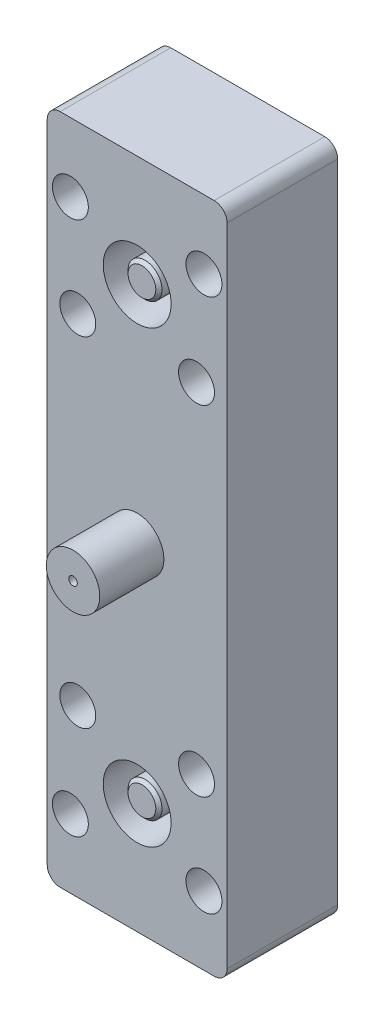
ISO-10303-21;
HEADER;
FILE_DESCRIPTION(('STEP AP214'),'2;1');
FILE_NAME('part.step','',(''),(''),'','','');
FILE_SCHEMA(('AUTOMOTIVE_DESIGN { 1 0 10303 214 1 1 1 1 }'));
ENDSEC;
DATA;
#1=APPLICATION_CONTEXT('core data for automotive mechanical design processes');
#2=APPLICATION_PROTOCOL_DEFINITION('international standard','automotive_design',2000,#1);
#3=PRODUCT_CONTEXT('',#1,'mechanical');
#4=PRODUCT('Part','Part','',(#3));
#5=PRODUCT_RELATED_PRODUCT_CATEGORY('part','',(#4));
#6=PRODUCT_DEFINITION_FORMATION('','',#4);
#7=PRODUCT_DEFINITION_CONTEXT('part definition',#1,'design');
#8=PRODUCT_DEFINITION('design','',#6,#7);
#9=PRODUCT_DEFINITION_SHAPE('','',#8);
#10=(LENGTH_UNIT() NAMED_UNIT(*) SI_UNIT(.MILLI.,.METRE.));
#11=(NAMED_UNIT(*) PLANE_ANGLE_UNIT() SI_UNIT($,.RADIAN.));
#12=(NAMED_UNIT(*) SI_UNIT($,.STERADIAN.) SOLID_ANGLE_UNIT());
#13=UNCERTAINTY_MEASURE_WITH_UNIT(LENGTH_MEASURE(1.E-05),#10,'distance_accuracy_value','');
#14=(GEOMETRIC_REPRESENTATION_CONTEXT(3) GLOBAL_UNCERTAINTY_ASSIGNED_CONTEXT((#13)) GLOBAL_UNIT_ASSIGNED_CONTEXT((#10,
#11,#12)) REPRESENTATION_CONTEXT('',''));
#15=CARTESIAN_POINT('',(0.,0.,0.));
#16=DIRECTION('',(0.,0.,1.));
#17=DIRECTION('',(1.,0.,0.));
#18=AXIS2_PLACEMENT_3D('',#15,#16,#17);
#19=CARTESIAN_POINT('',(0.,-84.1375,5.88538886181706));
#20=DIRECTION('',(0.,0.,-1.));
#21=DIRECTION('',(-1.,0.,0.));
#22=AXIS2_PLACEMENT_3D('',#19,#20,#21);
#23=CONICAL_SURFACE('',#22,3.96875,1.0471975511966);
#24=CARTESIAN_POINT('',(0.,-84.1375,8.17674774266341));
#25=VERTEX_POINT('',#24);
#26=VERTEX_LOOP('',#25);
#27=FACE_BOUND('',#26,.T.);
#28=CARTESIAN_POINT('',(0.,-84.1375,5.88538886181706));
#29=DIRECTION('',(0.,0.,-1.));
#30=DIRECTION('',(-1.,0.,0.));
#31=AXIS2_PLACEMENT_3D('',#28,#29,#30);
#32=CIRCLE('',#31,3.96875);
#33=CARTESIAN_POINT('',(-3.96875,-84.1375,5.88538886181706));
#34=VERTEX_POINT('',#33);
#35=CARTESIAN_POINT('',(-1.984375,-80.7004616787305,5.88538886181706));
#36=VERTEX_POINT('',#35);
#37=EDGE_CURVE('E1388',#34,#36,#32,.T.);
#38=ORIENTED_EDGE('',*,*,#37,.T.);
#39=CARTESIAN_POINT('',(1.984375,-80.7004616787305,5.88538886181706));
#40=VERTEX_POINT('',#39);
#41=EDGE_CURVE('E1391',#36,#40,#32,.T.);
#42=ORIENTED_EDGE('',*,*,#41,.T.);
#43=CARTESIAN_POINT('',(3.96875,-84.1375,5.88538886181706));
#44=VERTEX_POINT('',#43);
#45=EDGE_CURVE('E1560',#40,#44,#32,.T.);
#46=ORIENTED_EDGE('',*,*,#45,.T.);
#47=CARTESIAN_POINT('',(1.984375,-87.5745383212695,5.88538886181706));
#48=VERTEX_POINT('',#47);
#49=EDGE_CURVE('E1559',#44,#48,#32,.T.);
#50=ORIENTED_EDGE('',*,*,#49,.T.);
#51=CARTESIAN_POINT('',(-1.984375,-87.5745383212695,5.88538886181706));
#52=VERTEX_POINT('',#51);
#53=EDGE_CURVE('E1558',#48,#52,#32,.T.);
#54=ORIENTED_EDGE('',*,*,#53,.T.);
#55=EDGE_CURVE('E1392',#52,#34,#32,.T.);
#56=ORIENTED_EDGE('',*,*,#55,.T.);
#57=EDGE_LOOP('',(#38,#42,#46,#50,#54,#56));
#58=FACE_BOUND('',#57,.T.);
#59=ADVANCED_FACE('F15',(#27,#58),#23,.F.);
#60=CARTESIAN_POINT('',(3.96875,-86.4288588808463,5.88538886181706));
#61=DIRECTION('',(0.,0.,1.));
#62=DIRECTION('',(1.,0.,0.));
#63=AXIS2_PLACEMENT_3D('',#60,#61,#62);
#64=PLANE('',#63);
#65=DIRECTION('',(0.,-1.,0.));
#66=VECTOR('',#65,1.);
#67=CARTESIAN_POINT('',(-3.96875,-81.8461411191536,5.88538886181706));
#68=LINE('',#67,#66);
#69=CARTESIAN_POINT('',(-3.96875,-81.8461411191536,5.88538886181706));
#70=VERTEX_POINT('',#69);
#71=EDGE_CURVE('E1413',#70,#34,#68,.T.);
#72=ORIENTED_EDGE('',*,*,#71,.F.);
#73=DIRECTION('',(-0.866025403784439,-0.5,0.));
#74=VECTOR('',#73,1.);
#75=CARTESIAN_POINT('',(0.,-79.5547822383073,5.88538886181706));
#76=LINE('',#75,#74);
#77=EDGE_CURVE('E1420',#36,#70,#76,.T.);
#78=ORIENTED_EDGE('',*,*,#77,.F.);
#79=ORIENTED_EDGE('',*,*,#37,.F.);
#80=EDGE_LOOP('',(#72,#78,#79));
#81=FACE_BOUND('',#80,.T.);
#82=ADVANCED_FACE('F492',(#81),#64,.F.);
#83=CARTESIAN_POINT('',(0.,-79.5547822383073,5.88538886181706));
#84=VERTEX_POINT('',#83);
#85=EDGE_CURVE('E1417',#84,#36,#76,.T.);
#86=ORIENTED_EDGE('',*,*,#85,.F.);
#87=DIRECTION('',(-0.866025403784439,0.5,0.));
#88=VECTOR('',#87,1.);
#89=CARTESIAN_POINT('',(3.96875,-81.8461411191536,5.88538886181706));
#90=LINE('',#89,#88);
#91=EDGE_CURVE('E1424',#40,#84,#90,.T.);
#92=ORIENTED_EDGE('',*,*,#91,.F.);
#93=ORIENTED_EDGE('',*,*,#41,.F.);
#94=EDGE_LOOP('',(#86,#92,#93));
#95=FACE_BOUND('',#94,.T.);
#96=ADVANCED_FACE('F499',(#95),#64,.F.);
#97=CARTESIAN_POINT('',(3.96875,-81.8461411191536,5.88538886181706));
#98=VERTEX_POINT('',#97);
#99=EDGE_CURVE('E1421',#98,#40,#90,.T.);
#100=ORIENTED_EDGE('',*,*,#99,.F.);
#101=DIRECTION('',(0.,1.,0.));
#102=VECTOR('',#101,1.);
#103=CARTESIAN_POINT('',(3.96875,-86.4288588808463,5.88538886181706));
#104=LINE('',#103,#102);
#105=EDGE_CURVE('E1427',#44,#98,#104,.T.);
#106=ORIENTED_EDGE('',*,*,#105,.F.);
#107=ORIENTED_EDGE('',*,*,#45,.F.);
#108=EDGE_LOOP('',(#100,#106,#107));
#109=FACE_BOUND('',#108,.T.);
#110=ADVANCED_FACE('F1465',(#109),#64,.F.);
#111=CARTESIAN_POINT('',(3.96875,-86.4288588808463,5.88538886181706));
#112=VERTEX_POINT('',#111);
#113=EDGE_CURVE('E1425',#112,#44,#104,.T.);
#114=ORIENTED_EDGE('',*,*,#113,.F.);
#115=DIRECTION('',(0.866025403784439,0.5,0.));
#116=VECTOR('',#115,1.);
#117=CARTESIAN_POINT('',(0.,-88.7202177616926,5.88538886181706));
#118=LINE('',#117,#116);
#119=EDGE_CURVE('E1431',#48,#112,#118,.T.);
#120=ORIENTED_EDGE('',*,*,#119,.F.);
#121=ORIENTED_EDGE('',*,*,#49,.F.);
#122=EDGE_LOOP('',(#114,#120,#121));
#123=FACE_BOUND('',#122,.T.);
#124=ADVANCED_FACE('F1461',(#123),#64,.F.);
#125=CARTESIAN_POINT('',(0.,-88.7202177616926,5.88538886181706));
#126=VERTEX_POINT('',#125);
#127=EDGE_CURVE('E1428',#126,#48,#118,.T.);
#128=ORIENTED_EDGE('',*,*,#127,.F.);
#129=DIRECTION('',(0.866025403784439,-0.5,0.));
#130=VECTOR('',#129,1.);
#131=CARTESIAN_POINT('',(-3.96875,-86.4288588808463,5.88538886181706));
#132=LINE('',#131,#130);
#133=EDGE_CURVE('E1412',#52,#126,#132,.T.);
#134=ORIENTED_EDGE('',*,*,#133,.F.);
#135=ORIENTED_EDGE('',*,*,#53,.F.);
#136=EDGE_LOOP('',(#128,#134,#135));
#137=FACE_BOUND('',#136,.T.);
#138=ADVANCED_FACE('F1464',(#137),#64,.F.);
#139=CARTESIAN_POINT('',(-3.96875,-86.4288588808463,5.88538886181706));
#140=VERTEX_POINT('',#139);
#141=EDGE_CURVE('E1409',#140,#52,#132,.T.);
#142=ORIENTED_EDGE('',*,*,#141,.F.);
#143=EDGE_CURVE('E1416',#34,#140,#68,.T.);
#144=ORIENTED_EDGE('',*,*,#143,.F.);
#145=ORIENTED_EDGE('',*,*,#55,.F.);
#146=EDGE_LOOP('',(#142,#144,#145));
#147=FACE_BOUND('',#146,.T.);
#148=ADVANCED_FACE('F502',(#147),#64,.F.);
#149=CARTESIAN_POINT('',(-3.96875,-81.8461411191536,5.88538886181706));
#150=DIRECTION('',(1.,0.,0.));
#151=DIRECTION('',(0.,0.,-1.));
#152=AXIS2_PLACEMENT_3D('',#149,#150,#151);
#153=PLANE('',#152);
#154=DIRECTION('',(0.,-1.,0.));
#155=VECTOR('',#154,1.);
#156=CARTESIAN_POINT('',(-3.96875,-81.8461411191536,1.51658886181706));
#157=LINE('',#156,#155);
#158=CARTESIAN_POINT('',(-3.96875,-81.8461411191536,1.51658886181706));
#159=VERTEX_POINT('',#158);
#160=CARTESIAN_POINT('',(-3.96875,-86.4288588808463,1.51658886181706));
#161=VERTEX_POINT('',#160);
#162=EDGE_CURVE('E1435',#159,#161,#157,.T.);
#163=ORIENTED_EDGE('',*,*,#162,.F.);
#164=DIRECTION('',(0.,0.,-1.));
#165=VECTOR('',#164,1.);
#166=CARTESIAN_POINT('',(-3.96875,-81.8461411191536,5.88538886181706));
#167=LINE('',#166,#165);
#168=EDGE_CURVE('E1401',#70,#159,#167,.T.);
#169=ORIENTED_EDGE('',*,*,#168,.F.);
#170=ORIENTED_EDGE('',*,*,#71,.T.);
#171=ORIENTED_EDGE('',*,*,#143,.T.);
#172=DIRECTION('',(0.,0.,-1.));
#173=VECTOR('',#172,1.);
#174=CARTESIAN_POINT('',(-3.96875,-86.4288588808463,5.88538886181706));
#175=LINE('',#174,#173);
#176=EDGE_CURVE('E1404',#140,#161,#175,.T.);
#177=ORIENTED_EDGE('',*,*,#176,.T.);
#178=EDGE_LOOP('',(#163,#169,#170,#171,#177));
#179=FACE_BOUND('',#178,.T.);
#180=ADVANCED_FACE('F1470',(#179),#153,.T.);
#181=CARTESIAN_POINT('',(0.,-79.5547822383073,5.88538886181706));
#182=DIRECTION('',(0.5,-0.866025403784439,0.));
#183=DIRECTION('',(0.866025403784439,0.5,0.));
#184=AXIS2_PLACEMENT_3D('',#181,#182,#183);
#185=PLANE('',#184);
#186=DIRECTION('',(-0.866025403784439,-0.5,0.));
#187=VECTOR('',#186,1.);
#188=CARTESIAN_POINT('',(0.,-79.5547822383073,1.51658886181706));
#189=LINE('',#188,#187);
#190=CARTESIAN_POINT('',(0.,-79.5547822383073,1.51658886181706));
#191=VERTEX_POINT('',#190);
#192=EDGE_CURVE('E1438',#191,#159,#189,.T.);
#193=ORIENTED_EDGE('',*,*,#192,.F.);
#194=DIRECTION('',(0.,0.,-1.));
#195=VECTOR('',#194,1.);
#196=CARTESIAN_POINT('',(0.,-79.5547822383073,5.88538886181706));
#197=LINE('',#196,#195);
#198=EDGE_CURVE('E1398',#84,#191,#197,.T.);
#199=ORIENTED_EDGE('',*,*,#198,.F.);
#200=ORIENTED_EDGE('',*,*,#85,.T.);
#201=ORIENTED_EDGE('',*,*,#77,.T.);
#202=ORIENTED_EDGE('',*,*,#168,.T.);
#203=EDGE_LOOP('',(#193,#199,#200,#201,#202));
#204=FACE_BOUND('',#203,.T.);
#205=ADVANCED_FACE('F1473',(#204),#185,.T.);
#206=CARTESIAN_POINT('',(3.96875,-81.8461411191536,5.88538886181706));
#207=DIRECTION('',(-0.5,-0.866025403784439,0.));
#208=DIRECTION('',(0.866025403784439,-0.5,0.));
#209=AXIS2_PLACEMENT_3D('',#206,#207,#208);
#210=PLANE('',#209);
#211=DIRECTION('',(-0.866025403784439,0.5,0.));
#212=VECTOR('',#211,1.);
#213=CARTESIAN_POINT('',(3.96875,-81.8461411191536,1.51658886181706));
#214=LINE('',#213,#212);
#215=CARTESIAN_POINT('',(3.96875,-81.8461411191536,1.51658886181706));
#216=VERTEX_POINT('',#215);
#217=EDGE_CURVE('E1441',#216,#191,#214,.T.);
#218=ORIENTED_EDGE('',*,*,#217,.F.);
#219=DIRECTION('',(0.,0.,-1.));
#220=VECTOR('',#219,1.);
#221=CARTESIAN_POINT('',(3.96875,-81.8461411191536,5.88538886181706));
#222=LINE('',#221,#220);
#223=EDGE_CURVE('E1395',#98,#216,#222,.T.);
#224=ORIENTED_EDGE('',*,*,#223,.F.);
#225=ORIENTED_EDGE('',*,*,#99,.T.);
#226=ORIENTED_EDGE('',*,*,#91,.T.);
#227=ORIENTED_EDGE('',*,*,#198,.T.);
#228=EDGE_LOOP('',(#218,#224,#225,#226,#227));
#229=FACE_BOUND('',#228,.T.);
#230=ADVANCED_FACE('F1477',(#229),#210,.T.);
#231=CARTESIAN_POINT('',(3.96875,-86.4288588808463,5.88538886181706));
#232=DIRECTION('',(-1.,0.,0.));
#233=DIRECTION('',(0.,-1.,0.));
#234=AXIS2_PLACEMENT_3D('',#231,#232,#233);
#235=PLANE('',#234);
#236=DIRECTION('',(0.,1.,0.));
#237=VECTOR('',#236,1.);
#238=CARTESIAN_POINT('',(3.96875,-86.4288588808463,1.51658886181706));
#239=LINE('',#238,#237);
#240=CARTESIAN_POINT('',(3.96875,-86.4288588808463,1.51658886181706));
#241=VERTEX_POINT('',#240);
#242=EDGE_CURVE('E1444',#241,#216,#239,.T.);
#243=ORIENTED_EDGE('',*,*,#242,.F.);
#244=DIRECTION('',(0.,0.,-1.));
#245=VECTOR('',#244,1.);
#246=CARTESIAN_POINT('',(3.96875,-86.4288588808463,5.88538886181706));
#247=LINE('',#246,#245);
#248=EDGE_CURVE('E1393',#112,#241,#247,.T.);
#249=ORIENTED_EDGE('',*,*,#248,.F.);
#250=ORIENTED_EDGE('',*,*,#113,.T.);
#251=ORIENTED_EDGE('',*,*,#105,.T.);
#252=ORIENTED_EDGE('',*,*,#223,.T.);
#253=EDGE_LOOP('',(#243,#249,#250,#251,#252));
#254=FACE_BOUND('',#253,.T.);
#255=ADVANCED_FACE('F1480',(#254),#235,.T.);
#256=CARTESIAN_POINT('',(0.,-88.7202177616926,5.88538886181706));
#257=DIRECTION('',(-0.5,0.86602540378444,0.));
#258=DIRECTION('',(-0.866025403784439,-0.5,0.));
#259=AXIS2_PLACEMENT_3D('',#256,#257,#258);
#260=PLANE('',#259);
#261=DIRECTION('',(0.866025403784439,0.5,0.));
#262=VECTOR('',#261,1.);
#263=CARTESIAN_POINT('',(0.,-88.7202177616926,1.51658886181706));
#264=LINE('',#263,#262);
#265=CARTESIAN_POINT('',(0.,-88.7202177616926,1.51658886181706));
#266=VERTEX_POINT('',#265);
#267=EDGE_CURVE('E34',#266,#241,#264,.T.);
#268=ORIENTED_EDGE('',*,*,#267,.F.);
#269=DIRECTION('',(0.,0.,-1.));
#270=VECTOR('',#269,1.);
#271=CARTESIAN_POINT('',(0.,-88.7202177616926,5.88538886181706));
#272=LINE('',#271,#270);
#273=EDGE_CURVE('E1407',#126,#266,#272,.T.);
#274=ORIENTED_EDGE('',*,*,#273,.F.);
#275=ORIENTED_EDGE('',*,*,#127,.T.);
#276=ORIENTED_EDGE('',*,*,#119,.T.);
#277=ORIENTED_EDGE('',*,*,#248,.T.);
#278=EDGE_LOOP('',(#268,#274,#275,#276,#277));
#279=FACE_BOUND('',#278,.T.);
#280=ADVANCED_FACE('F507',(#279),#260,.T.);
#281=CARTESIAN_POINT('',(-3.96875,-86.4288588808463,5.88538886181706));
#282=DIRECTION('',(0.5,0.86602540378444,0.));
#283=DIRECTION('',(-0.866025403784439,0.5,0.));
#284=AXIS2_PLACEMENT_3D('',#281,#282,#283);
#285=PLANE('',#284);
#286=DIRECTION('',(0.866025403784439,-0.5,0.));
#287=VECTOR('',#286,1.);
#288=CARTESIAN_POINT('',(-3.96875,-86.4288588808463,1.51658886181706));
#289=LINE('',#288,#287);
#290=EDGE_CURVE('E1432',#161,#266,#289,.T.);
#291=ORIENTED_EDGE('',*,*,#290,.F.);
#292=ORIENTED_EDGE('',*,*,#176,.F.);
#293=ORIENTED_EDGE('',*,*,#141,.T.);
#294=ORIENTED_EDGE('',*,*,#133,.T.);
#295=ORIENTED_EDGE('',*,*,#273,.T.);
#296=EDGE_LOOP('',(#291,#292,#293,#294,#295));
#297=FACE_BOUND('',#296,.T.);
#298=ADVANCED_FACE('F535',(#297),#285,.T.);
#299=CARTESIAN_POINT('',(0.,-84.1375,1.51658886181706));
#300=DIRECTION('',(0.,0.,-1.));
#301=DIRECTION('',(-1.,0.,0.));
#302=AXIS2_PLACEMENT_3D('',#299,#300,#301);
#303=PLANE('',#302);
#304=CARTESIAN_POINT('',(0.,-84.1375,1.51658886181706));
#305=DIRECTION('',(0.,0.,-1.));
#306=DIRECTION('',(-1.,0.,0.));
#307=AXIS2_PLACEMENT_3D('',#304,#305,#306);
#308=CIRCLE('',#307,11.90625);
#309=CARTESIAN_POINT('',(-11.90625,-84.1375,1.51658886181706));
#310=VERTEX_POINT('',#309);
#311=EDGE_CURVE('E25',#310,#310,#308,.T.);
#312=ORIENTED_EDGE('',*,*,#311,.T.);
#313=EDGE_LOOP('',(#312));
#314=FACE_BOUND('',#313,.T.);
#315=ORIENTED_EDGE('',*,*,#290,.T.);
#316=ORIENTED_EDGE('',*,*,#267,.T.);
#317=ORIENTED_EDGE('',*,*,#242,.T.);
#318=ORIENTED_EDGE('',*,*,#217,.T.);
#319=ORIENTED_EDGE('',*,*,#192,.T.);
#320=ORIENTED_EDGE('',*,*,#162,.T.);
#321=EDGE_LOOP('',(#315,#316,#317,#318,#319,#320));
#322=FACE_BOUND('',#321,.T.);
#323=ADVANCED_FACE('F531',(#314,#322),#303,.T.);
#324=CARTESIAN_POINT('',(0.,-84.1375,1.51658886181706));
#325=DIRECTION('',(0.,0.,-1.));
#326=DIRECTION('',(-1.,0.,0.));
#327=AXIS2_PLACEMENT_3D('',#324,#325,#326);
#328=CYLINDRICAL_SURFACE('',#327,11.90625);
#329=CARTESIAN_POINT('',(0.,-84.1375,1.64358886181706));
#330=DIRECTION('',(0.,0.,-1.));
#331=DIRECTION('',(-1.,0.,0.));
#332=AXIS2_PLACEMENT_3D('',#329,#330,#331);
#333=CIRCLE('',#332,11.90625);
#334=CARTESIAN_POINT('',(-11.90625,-84.1375,1.64358886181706));
#335=VERTEX_POINT('',#334);
#336=EDGE_CURVE('E1379',#335,#335,#333,.T.);
#337=ORIENTED_EDGE('',*,*,#336,.T.);
#338=EDGE_LOOP('',(#337));
#339=FACE_BOUND('',#338,.T.);
#340=ORIENTED_EDGE('',*,*,#311,.F.);
#341=EDGE_LOOP('',(#340));
#342=FACE_BOUND('',#341,.T.);
#343=ADVANCED_FACE('F526',(#339,#342),#328,.T.);
#344=CARTESIAN_POINT('',(0.,-84.1375,1.64358886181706));
#345=DIRECTION('',(0.,0.,-1.));
#346=DIRECTION('',(-1.,0.,0.));
#347=AXIS2_PLACEMENT_3D('',#344,#345,#346);
#348=CONICAL_SURFACE('',#347,11.90625,0.715584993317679);
#349=CARTESIAN_POINT('',(0.,-84.1375,7.58242328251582));
#350=DIRECTION('',(0.,0.,-1.));
#351=DIRECTION('',(-1.,0.,0.));
#352=AXIS2_PLACEMENT_3D('',#349,#350,#351);
#353=CIRCLE('',#352,6.7437);
#354=CARTESIAN_POINT('',(-6.74369999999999,-84.1375,7.58242328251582));
#355=VERTEX_POINT('',#354);
#356=EDGE_CURVE('E9',#355,#355,#353,.T.);
#357=ORIENTED_EDGE('',*,*,#356,.F.);
#358=EDGE_LOOP('',(#357));
#359=FACE_BOUND('',#358,.T.);
#360=CARTESIAN_POINT('',(0.,-84.1375,7.89198886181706));
#361=DIRECTION('',(0.,0.,-1.));
#362=DIRECTION('',(-1.,0.,0.));
#363=AXIS2_PLACEMENT_3D('',#360,#361,#362);
#364=CIRCLE('',#363,6.47459874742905);
#365=CARTESIAN_POINT('',(-6.47459874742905,-84.1375,7.89198886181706));
#366=VERTEX_POINT('',#365);
#367=EDGE_CURVE('E301',#366,#366,#364,.T.);
#368=ORIENTED_EDGE('',*,*,#367,.T.);
#369=EDGE_LOOP('',(#368));
#370=FACE_BOUND('',#369,.T.);
#371=ADVANCED_FACE('F523',(#359,#370),#348,.T.);
#372=CARTESIAN_POINT('',(0.,-77.7875,7.89198886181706));
#373=DIRECTION('',(0.,0.,1.));
#374=DIRECTION('',(1.,0.,0.));
#375=AXIS2_PLACEMENT_3D('',#372,#373,#374);
#376=PLANE('',#375);
#377=CARTESIAN_POINT('',(0.,-84.1375,7.89198886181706));
#378=DIRECTION('',(0.,0.,-1.));
#379=DIRECTION('',(-1.,0.,0.));
#380=AXIS2_PLACEMENT_3D('',#377,#378,#379);
#381=CIRCLE('',#380,6.35);
#382=CARTESIAN_POINT('',(-6.35,-84.1375,7.89198886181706));
#383=VERTEX_POINT('',#382);
#384=EDGE_CURVE('E1448',#383,#383,#381,.T.);
#385=ORIENTED_EDGE('',*,*,#384,.T.);
#386=EDGE_LOOP('',(#385));
#387=FACE_BOUND('',#386,.T.);
#388=ORIENTED_EDGE('',*,*,#367,.F.);
#389=EDGE_LOOP('',(#388));
#390=FACE_BOUND('',#389,.T.);
#391=ADVANCED_FACE('F513',(#387,#390),#376,.T.);
#392=CARTESIAN_POINT('',(0.,-78.95082,39.616588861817));
#393=DIRECTION('',(0.,0.,1.));
#394=DIRECTION('',(1.,0.,0.));
#395=AXIS2_PLACEMENT_3D('',#392,#393,#394);
#396=PLANE('',#395);
#397=CARTESIAN_POINT('',(0.,-84.1375,39.616588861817));
#398=DIRECTION('',(0.,0.,-1.));
#399=DIRECTION('',(-1.,0.,0.));
#400=AXIS2_PLACEMENT_3D('',#397,#398,#399);
#401=CIRCLE('',#400,5.18668);
#402=CARTESIAN_POINT('',(-5.18668,-84.1375,39.616588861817));
#403=VERTEX_POINT('',#402);
#404=EDGE_CURVE('E1385',#403,#403,#401,.T.);
#405=ORIENTED_EDGE('',*,*,#404,.F.);
#406=EDGE_LOOP('',(#405));
#407=FACE_BOUND('',#406,.T.);
#408=ADVANCED_FACE('F509',(#407),#396,.T.);
#409=CARTESIAN_POINT('',(0.,-84.1375,39.616588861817));
#410=DIRECTION('',(0.,0.,-1.));
#411=DIRECTION('',(-1.,0.,0.));
#412=AXIS2_PLACEMENT_3D('',#409,#410,#411);
#413=CONICAL_SURFACE('',#412,5.18668,0.785398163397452);
#414=CARTESIAN_POINT('',(0.,-84.1375,38.4532688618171));
#415=DIRECTION('',(0.,0.,-1.));
#416=DIRECTION('',(-1.,0.,0.));
#417=AXIS2_PLACEMENT_3D('',#414,#415,#416);
#418=CIRCLE('',#417,6.35);
#419=CARTESIAN_POINT('',(-6.35,-84.1375,38.4532688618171));
#420=VERTEX_POINT('',#419);
#421=EDGE_CURVE('E1382',#420,#420,#418,.T.);
#422=ORIENTED_EDGE('',*,*,#421,.F.);
#423=EDGE_LOOP('',(#422));
#424=FACE_BOUND('',#423,.T.);
#425=ORIENTED_EDGE('',*,*,#404,.T.);
#426=EDGE_LOOP('',(#425));
#427=FACE_BOUND('',#426,.T.);
#428=ADVANCED_FACE('F512',(#424,#427),#413,.T.);
#429=CARTESIAN_POINT('',(0.,-84.1375,1.51658886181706));
#430=DIRECTION('',(0.,0.,-1.));
#431=DIRECTION('',(-1.,0.,0.));
#432=AXIS2_PLACEMENT_3D('',#429,#430,#431);
#433=CYLINDRICAL_SURFACE('',#432,6.35);
#434=ORIENTED_EDGE('',*,*,#421,.T.);
#435=EDGE_LOOP('',(#434));
#436=FACE_BOUND('',#435,.T.);
#437=ORIENTED_EDGE('',*,*,#384,.F.);
#438=EDGE_LOOP('',(#437));
#439=FACE_BOUND('',#438,.T.);
#440=ADVANCED_FACE('F517',(#436,#439),#433,.T.);
#441=CARTESIAN_POINT('',(-33.131125,0.,26.924));
#442=DIRECTION('',(-1.,0.,0.));
#443=DIRECTION('',(0.,1.,0.));
#444=AXIS2_PLACEMENT_3D('',#441,#442,#443);
#445=PLANE('',#444);
#446=CARTESIAN_POINT('',(-33.131125,0.,26.924));
#447=DIRECTION('',(-1.,0.,0.));
#448=DIRECTION('',(0.,1.,0.));
#449=AXIS2_PLACEMENT_3D('',#446,#447,#448);
#450=CIRCLE('',#449,1.7474960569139);
#451=CARTESIAN_POINT('',(-33.131125,1.74749605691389,26.924));
#452=VERTEX_POINT('',#451);
#453=EDGE_CURVE('E410',#452,#452,#450,.T.);
#454=ORIENTED_EDGE('',*,*,#453,.T.);
#455=EDGE_LOOP('',(#454));
#456=FACE_BOUND('',#455,.T.);
#457=ADVANCED_FACE('F521',(#456),#445,.T.);
#458=CARTESIAN_POINT('',(-32.369125,0.,26.924));
#459=DIRECTION('',(-1.,0.,0.));
#460=DIRECTION('',(0.,1.,0.));
#461=AXIS2_PLACEMENT_3D('',#458,#459,#460);
#462=TOROIDAL_SURFACE('',#461,1.7474960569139,0.762);
#463=ORIENTED_EDGE('',*,*,#453,.F.);
#464=EDGE_LOOP('',(#463));
#465=FACE_BOUND('',#464,.T.);
#466=CARTESIAN_POINT('',(-32.6235165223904,0.,26.924));
#467=DIRECTION('',(-1.,0.,0.));
#468=DIRECTION('',(0.,1.,0.));
#469=AXIS2_PLACEMENT_3D('',#466,#467,#468);
#470=CIRCLE('',#469,2.46577800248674);
#471=CARTESIAN_POINT('',(-32.6235165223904,2.46577800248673,26.924));
#472=VERTEX_POINT('',#471);
#473=EDGE_CURVE('E407',#472,#472,#470,.F.);
#474=ORIENTED_EDGE('',*,*,#473,.F.);
#475=EDGE_LOOP('',(#474));
#476=FACE_BOUND('',#475,.T.);
#477=ADVANCED_FACE('F437',(#465,#476),#462,.T.);
#478=CARTESIAN_POINT('',(0.,89.32418,39.616588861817));
#479=DIRECTION('',(0.,0.,1.));
#480=DIRECTION('',(1.,0.,0.));
#481=AXIS2_PLACEMENT_3D('',#478,#479,#480);
#482=PLANE('',#481);
#483=CARTESIAN_POINT('',(0.,84.1375,39.616588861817));
#484=DIRECTION('',(0.,0.,-1.));
#485=DIRECTION('',(-1.,0.,0.));
#486=AXIS2_PLACEMENT_3D('',#483,#484,#485);
#487=CIRCLE('',#486,5.18668);
#488=CARTESIAN_POINT('',(-5.18667999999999,84.1375,39.616588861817));
#489=VERTEX_POINT('',#488);
#490=EDGE_CURVE('E1003',#489,#489,#487,.T.);
#491=ORIENTED_EDGE('',*,*,#490,.F.);
#492=EDGE_LOOP('',(#491));
#493=FACE_BOUND('',#492,.T.);
#494=ADVANCED_FACE('F542',(#493),#482,.T.);
#495=CARTESIAN_POINT('',(-30.083125,0.,26.924));
#496=DIRECTION('',(1.,0.,0.));
#497=DIRECTION('',(0.,-1.,0.));
#498=AXIS2_PLACEMENT_3D('',#495,#496,#497);
#499=CONICAL_SURFACE('',#498,3.3655,0.340381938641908);
#500=ORIENTED_EDGE('',*,*,#473,.T.);
#501=EDGE_LOOP('',(#500));
#502=FACE_BOUND('',#501,.T.);
#503=CARTESIAN_POINT('',(-30.083125,0.,26.924));
#504=DIRECTION('',(1.,0.,0.));
#505=DIRECTION('',(0.,-1.,0.));
#506=AXIS2_PLACEMENT_3D('',#503,#504,#505);
#507=CIRCLE('',#506,3.3655);
#508=CARTESIAN_POINT('',(-30.083125,-3.36550000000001,26.924));
#509=VERTEX_POINT('',#508);
#510=EDGE_CURVE('E278',#509,#509,#507,.T.);
#511=ORIENTED_EDGE('',*,*,#510,.F.);
#512=EDGE_LOOP('',(#511));
#513=FACE_BOUND('',#512,.T.);
#514=ADVANCED_FACE('F585',(#502,#513),#499,.T.);
#515=CARTESIAN_POINT('',(0.,84.1375,39.616588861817));
#516=DIRECTION('',(0.,0.,-1.));
#517=DIRECTION('',(-1.,0.,0.));
#518=AXIS2_PLACEMENT_3D('',#515,#516,#517);
#519=CONICAL_SURFACE('',#518,5.18668,0.785398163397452);
#520=CARTESIAN_POINT('',(0.,84.1375,38.4532688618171));
#521=DIRECTION('',(0.,0.,-1.));
#522=DIRECTION('',(-1.,0.,0.));
#523=AXIS2_PLACEMENT_3D('',#520,#521,#522);
#524=CIRCLE('',#523,6.35);
#525=CARTESIAN_POINT('',(-6.34999999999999,84.1375,38.4532688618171));
#526=VERTEX_POINT('',#525);
#527=EDGE_CURVE('E1007',#526,#526,#524,.T.);
#528=ORIENTED_EDGE('',*,*,#527,.F.);
#529=EDGE_LOOP('',(#528));
#530=FACE_BOUND('',#529,.T.);
#531=ORIENTED_EDGE('',*,*,#490,.T.);
#532=EDGE_LOOP('',(#531));
#533=FACE_BOUND('',#532,.T.);
#534=ADVANCED_FACE('F587',(#530,#533),#519,.T.);
#535=CARTESIAN_POINT('',(-28.4848152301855,0.,26.924));
#536=DIRECTION('',(1.,0.,0.));
#537=DIRECTION('',(0.,-1.,0.));
#538=AXIS2_PLACEMENT_3D('',#535,#536,#537);
#539=TOROIDAL_SURFACE('',#538,5.20693450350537,2.43833450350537);
#540=ORIENTED_EDGE('',*,*,#510,.T.);
#541=EDGE_LOOP('',(#540));
#542=FACE_BOUND('',#541,.T.);
#543=CARTESIAN_POINT('',(-26.38425,0.,26.924));
#544=DIRECTION('',(1.,0.,0.));
#545=DIRECTION('',(0.,-1.,0.));
#546=AXIS2_PLACEMENT_3D('',#543,#544,#545);
#547=CIRCLE('',#546,3.96875);
#548=CARTESIAN_POINT('',(-26.38425,-3.96875,26.924));
#549=VERTEX_POINT('',#548);
#550=CARTESIAN_POINT('',(-26.38425,-1.984375,23.4869616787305));
#551=VERTEX_POINT('',#550);
#552=EDGE_CURVE('E347',#549,#551,#547,.T.);
#553=ORIENTED_EDGE('',*,*,#552,.F.);
#554=CARTESIAN_POINT('',(-26.38425,-1.984375,30.3610383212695));
#555=VERTEX_POINT('',#554);
#556=EDGE_CURVE('E346',#555,#549,#547,.T.);
#557=ORIENTED_EDGE('',*,*,#556,.F.);
#558=CARTESIAN_POINT('',(-26.38425,1.984375,30.3610383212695));
#559=VERTEX_POINT('',#558);
#560=EDGE_CURVE('E881',#559,#555,#547,.T.);
#561=ORIENTED_EDGE('',*,*,#560,.F.);
#562=CARTESIAN_POINT('',(-26.38425,3.96875,26.924));
#563=VERTEX_POINT('',#562);
#564=EDGE_CURVE('E892',#563,#559,#547,.T.);
#565=ORIENTED_EDGE('',*,*,#564,.F.);
#566=CARTESIAN_POINT('',(-26.38425,1.984375,23.4869616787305));
#567=VERTEX_POINT('',#566);
#568=EDGE_CURVE('E889',#567,#563,#547,.T.);
#569=ORIENTED_EDGE('',*,*,#568,.F.);
#570=EDGE_CURVE('E350',#551,#567,#547,.T.);
#571=ORIENTED_EDGE('',*,*,#570,.F.);
#572=EDGE_LOOP('',(#553,#557,#561,#565,#569,#571));
#573=FACE_BOUND('',#572,.T.);
#574=ADVANCED_FACE('F590',(#542,#573),#539,.F.);
#575=CARTESIAN_POINT('',(0.,84.1375,1.51658886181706));
#576=DIRECTION('',(0.,0.,-1.));
#577=DIRECTION('',(-1.,0.,0.));
#578=AXIS2_PLACEMENT_3D('',#575,#576,#577);
#579=CYLINDRICAL_SURFACE('',#578,6.35);
#580=ORIENTED_EDGE('',*,*,#527,.T.);
#581=EDGE_LOOP('',(#580));
#582=FACE_BOUND('',#581,.T.);
#583=CARTESIAN_POINT('',(0.,84.1375,7.89198886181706));
#584=DIRECTION('',(0.,0.,-1.));
#585=DIRECTION('',(-1.,0.,0.));
#586=AXIS2_PLACEMENT_3D('',#583,#584,#585);
#587=CIRCLE('',#586,6.35);
#588=CARTESIAN_POINT('',(-6.34999999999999,84.1375,7.89198886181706));
#589=VERTEX_POINT('',#588);
#590=EDGE_CURVE('E1372',#589,#589,#587,.T.);
#591=ORIENTED_EDGE('',*,*,#590,.F.);
#592=EDGE_LOOP('',(#591));
#593=FACE_BOUND('',#592,.T.);
#594=ADVANCED_FACE('F528',(#582,#593),#579,.T.);
#595=CARTESIAN_POINT('',(-26.38425,-3.96875,29.2153588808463));
#596=DIRECTION('',(-1.,0.,0.));
#597=DIRECTION('',(0.,0.,-1.));
#598=AXIS2_PLACEMENT_3D('',#595,#596,#597);
#599=PLANE('',#598);
#600=ORIENTED_EDGE('',*,*,#560,.T.);
#601=DIRECTION('',(0.,0.866025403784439,0.5));
#602=VECTOR('',#601,1.);
#603=CARTESIAN_POINT('',(-26.38425,-3.96875,29.2153588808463));
#604=LINE('',#603,#602);
#605=CARTESIAN_POINT('',(-26.38425,0.,31.5067177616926));
#606=VERTEX_POINT('',#605);
#607=EDGE_CURVE('E357',#555,#606,#604,.T.);
#608=ORIENTED_EDGE('',*,*,#607,.T.);
#609=DIRECTION('',(0.,0.866025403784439,-0.5));
#610=VECTOR('',#609,1.);
#611=CARTESIAN_POINT('',(-26.38425,0.,31.5067177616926));
#612=LINE('',#611,#610);
#613=EDGE_CURVE('E363',#606,#559,#612,.T.);
#614=ORIENTED_EDGE('',*,*,#613,.T.);
#615=EDGE_LOOP('',(#600,#608,#614));
#616=FACE_BOUND('',#615,.T.);
#617=ADVANCED_FACE('F594',(#616),#599,.T.);
#618=ORIENTED_EDGE('',*,*,#564,.T.);
#619=CARTESIAN_POINT('',(-26.38425,3.96875,29.2153588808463));
#620=VERTEX_POINT('',#619);
#621=EDGE_CURVE('E362',#559,#620,#612,.T.);
#622=ORIENTED_EDGE('',*,*,#621,.T.);
#623=DIRECTION('',(0.,0.,-1.));
#624=VECTOR('',#623,1.);
#625=CARTESIAN_POINT('',(-26.38425,3.96875,29.2153588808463));
#626=LINE('',#625,#624);
#627=EDGE_CURVE('E366',#620,#563,#626,.T.);
#628=ORIENTED_EDGE('',*,*,#627,.T.);
#629=EDGE_LOOP('',(#618,#622,#628));
#630=FACE_BOUND('',#629,.T.);
#631=ADVANCED_FACE('F837',(#630),#599,.T.);
#632=ORIENTED_EDGE('',*,*,#568,.T.);
#633=CARTESIAN_POINT('',(-26.38425,3.96875,24.6326411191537));
#634=VERTEX_POINT('',#633);
#635=EDGE_CURVE('E365',#563,#634,#626,.T.);
#636=ORIENTED_EDGE('',*,*,#635,.T.);
#637=DIRECTION('',(0.,-0.866025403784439,-0.5));
#638=VECTOR('',#637,1.);
#639=CARTESIAN_POINT('',(-26.38425,3.96875,24.6326411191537));
#640=LINE('',#639,#638);
#641=EDGE_CURVE('E370',#634,#567,#640,.T.);
#642=ORIENTED_EDGE('',*,*,#641,.T.);
#643=EDGE_LOOP('',(#632,#636,#642));
#644=FACE_BOUND('',#643,.T.);
#645=ADVANCED_FACE('F907',(#644),#599,.T.);
#646=ORIENTED_EDGE('',*,*,#570,.T.);
#647=CARTESIAN_POINT('',(-26.38425,0.,22.3412822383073));
#648=VERTEX_POINT('',#647);
#649=EDGE_CURVE('E369',#567,#648,#640,.T.);
#650=ORIENTED_EDGE('',*,*,#649,.T.);
#651=DIRECTION('',(0.,-0.866025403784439,0.5));
#652=VECTOR('',#651,1.);
#653=CARTESIAN_POINT('',(-26.38425,0.,22.3412822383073));
#654=LINE('',#653,#652);
#655=EDGE_CURVE('E374',#648,#551,#654,.T.);
#656=ORIENTED_EDGE('',*,*,#655,.T.);
#657=EDGE_LOOP('',(#646,#650,#656));
#658=FACE_BOUND('',#657,.T.);
#659=ADVANCED_FACE('F873',(#658),#599,.T.);
#660=ORIENTED_EDGE('',*,*,#552,.T.);
#661=CARTESIAN_POINT('',(-26.38425,-3.96875,24.6326411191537));
#662=VERTEX_POINT('',#661);
#663=EDGE_CURVE('E373',#551,#662,#654,.T.);
#664=ORIENTED_EDGE('',*,*,#663,.T.);
#665=DIRECTION('',(0.,0.,1.));
#666=VECTOR('',#665,1.);
#667=CARTESIAN_POINT('',(-26.38425,-3.96875,24.6326411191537));
#668=LINE('',#667,#666);
#669=EDGE_CURVE('E354',#662,#549,#668,.T.);
#670=ORIENTED_EDGE('',*,*,#669,.T.);
#671=EDGE_LOOP('',(#660,#664,#670));
#672=FACE_BOUND('',#671,.T.);
#673=ADVANCED_FACE('F867',(#672),#599,.T.);
#674=ORIENTED_EDGE('',*,*,#556,.T.);
#675=CARTESIAN_POINT('',(-26.38425,-3.96875,29.2153588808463));
#676=VERTEX_POINT('',#675);
#677=EDGE_CURVE('E358',#549,#676,#668,.T.);
#678=ORIENTED_EDGE('',*,*,#677,.T.);
#679=EDGE_CURVE('E359',#676,#555,#604,.T.);
#680=ORIENTED_EDGE('',*,*,#679,.T.);
#681=EDGE_LOOP('',(#674,#678,#680));
#682=FACE_BOUND('',#681,.T.);
#683=ADVANCED_FACE('F540',(#682),#599,.T.);
#684=CARTESIAN_POINT('',(0.,90.4875,7.89198886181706));
#685=DIRECTION('',(0.,0.,1.));
#686=DIRECTION('',(1.,0.,0.));
#687=AXIS2_PLACEMENT_3D('',#684,#685,#686);
#688=PLANE('',#687);
#689=ORIENTED_EDGE('',*,*,#590,.T.);
#690=EDGE_LOOP('',(#689));
#691=FACE_BOUND('',#690,.T.);
#692=CARTESIAN_POINT('',(0.,84.1375,7.89198886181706));
#693=DIRECTION('',(0.,0.,-1.));
#694=DIRECTION('',(-1.,0.,0.));
#695=AXIS2_PLACEMENT_3D('',#692,#693,#694);
#696=CIRCLE('',#695,6.47459874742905);
#697=CARTESIAN_POINT('',(-6.47459874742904,84.1375,7.89198886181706));
#698=VERTEX_POINT('',#697);
#699=EDGE_CURVE('E343',#698,#698,#696,.T.);
#700=ORIENTED_EDGE('',*,*,#699,.F.);
#701=EDGE_LOOP('',(#700));
#702=FACE_BOUND('',#701,.T.);
#703=ADVANCED_FACE('F537',(#691,#702),#688,.T.);
#704=CARTESIAN_POINT('',(0.,20.,0.762));
#705=DIRECTION('',(0.,0.,1.));
#706=DIRECTION('',(0.,-1.,0.));
#707=AXIS2_PLACEMENT_3D('',#704,#705,#706);
#708=PLANE('',#707);
#709=CARTESIAN_POINT('',(0.,0.,0.762));
#710=DIRECTION('',(0.,0.,-1.));
#711=DIRECTION('',(-1.,0.,0.));
#712=AXIS2_PLACEMENT_3D('',#709,#710,#711);
#713=CIRCLE('',#712,14.7805080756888);
#714=CARTESIAN_POINT('',(-14.7805080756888,0.,0.762000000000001));
#715=VERTEX_POINT('',#714);
#716=EDGE_CURVE('E261',#715,#715,#713,.T.);
#717=ORIENTED_EDGE('',*,*,#716,.T.);
#718=EDGE_LOOP('',(#717));
#719=FACE_BOUND('',#718,.T.);
#720=ADVANCED_FACE('F436',(#719),#708,.F.);
#721=CARTESIAN_POINT('',(-26.38425,-3.96875,29.2153588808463));
#722=DIRECTION('',(0.,0.5,-0.866025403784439));
#723=DIRECTION('',(0.,-0.866025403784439,-0.5));
#724=AXIS2_PLACEMENT_3D('',#721,#722,#723);
#725=PLANE('',#724);
#726=DIRECTION('',(0.,0.866025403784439,0.5));
#727=VECTOR('',#726,1.);
#728=CARTESIAN_POINT('',(-24.003,-3.96875,29.2153588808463));
#729=LINE('',#728,#727);
#730=CARTESIAN_POINT('',(-24.003,-3.96875,29.2153588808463));
#731=VERTEX_POINT('',#730);
#732=CARTESIAN_POINT('',(-24.003,0.,31.5067177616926));
#733=VERTEX_POINT('',#732);
#734=EDGE_CURVE('E380',#731,#733,#729,.T.);
#735=ORIENTED_EDGE('',*,*,#734,.T.);
#736=DIRECTION('',(1.,0.,0.));
#737=VECTOR('',#736,1.);
#738=CARTESIAN_POINT('',(-26.38425,0.,31.5067177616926));
#739=LINE('',#738,#737);
#740=EDGE_CURVE('E401',#606,#733,#739,.T.);
#741=ORIENTED_EDGE('',*,*,#740,.F.);
#742=ORIENTED_EDGE('',*,*,#607,.F.);
#743=ORIENTED_EDGE('',*,*,#679,.F.);
#744=DIRECTION('',(1.,0.,0.));
#745=VECTOR('',#744,1.);
#746=CARTESIAN_POINT('',(-26.38425,-3.96875,29.2153588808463));
#747=LINE('',#746,#745);
#748=EDGE_CURVE('E404',#676,#731,#747,.T.);
#749=ORIENTED_EDGE('',*,*,#748,.T.);
#750=EDGE_LOOP('',(#735,#741,#742,#743,#749));
#751=FACE_BOUND('',#750,.T.);
#752=ADVANCED_FACE('F857',(#751),#725,.F.);
#753=CARTESIAN_POINT('',(-26.38425,0.,31.5067177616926));
#754=DIRECTION('',(0.,-0.5,-0.866025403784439));
#755=DIRECTION('',(0.,-0.866025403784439,0.5));
#756=AXIS2_PLACEMENT_3D('',#753,#754,#755);
#757=PLANE('',#756);
#758=DIRECTION('',(0.,0.866025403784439,-0.5));
#759=VECTOR('',#758,1.);
#760=CARTESIAN_POINT('',(-24.003,0.,31.5067177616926));
#761=LINE('',#760,#759);
#762=CARTESIAN_POINT('',(-24.003,3.96875,29.2153588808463));
#763=VERTEX_POINT('',#762);
#764=EDGE_CURVE('E382',#733,#763,#761,.T.);
#765=ORIENTED_EDGE('',*,*,#764,.T.);
#766=DIRECTION('',(1.,0.,0.));
#767=VECTOR('',#766,1.);
#768=CARTESIAN_POINT('',(-26.38425,3.96875,29.2153588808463));
#769=LINE('',#768,#767);
#770=EDGE_CURVE('E398',#620,#763,#769,.T.);
#771=ORIENTED_EDGE('',*,*,#770,.F.);
#772=ORIENTED_EDGE('',*,*,#621,.F.);
#773=ORIENTED_EDGE('',*,*,#613,.F.);
#774=ORIENTED_EDGE('',*,*,#740,.T.);
#775=EDGE_LOOP('',(#765,#771,#772,#773,#774));
#776=FACE_BOUND('',#775,.T.);
#777=ADVANCED_FACE('F853',(#776),#757,.F.);
#778=CARTESIAN_POINT('',(-26.38425,3.96875,29.2153588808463));
#779=DIRECTION('',(0.,-1.,0.));
#780=DIRECTION('',(0.,0.,1.));
#781=AXIS2_PLACEMENT_3D('',#778,#779,#780);
#782=PLANE('',#781);
#783=DIRECTION('',(0.,0.,-1.));
#784=VECTOR('',#783,1.);
#785=CARTESIAN_POINT('',(-24.003,3.96875,29.2153588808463));
#786=LINE('',#785,#784);
#787=CARTESIAN_POINT('',(-24.003,3.96875,24.6326411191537));
#788=VERTEX_POINT('',#787);
#789=EDGE_CURVE('E384',#763,#788,#786,.T.);
#790=ORIENTED_EDGE('',*,*,#789,.T.);
#791=DIRECTION('',(1.,0.,0.));
#792=VECTOR('',#791,1.);
#793=CARTESIAN_POINT('',(-26.38425,3.96875,24.6326411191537));
#794=LINE('',#793,#792);
#795=EDGE_CURVE('E395',#634,#788,#794,.T.);
#796=ORIENTED_EDGE('',*,*,#795,.F.);
#797=ORIENTED_EDGE('',*,*,#635,.F.);
#798=ORIENTED_EDGE('',*,*,#627,.F.);
#799=ORIENTED_EDGE('',*,*,#770,.T.);
#800=EDGE_LOOP('',(#790,#796,#797,#798,#799));
#801=FACE_BOUND('',#800,.T.);
#802=ADVANCED_FACE('F849',(#801),#782,.F.);
#803=CARTESIAN_POINT('',(-26.38425,3.96875,24.6326411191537));
#804=DIRECTION('',(0.,-0.5,0.866025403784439));
#805=DIRECTION('',(0.,0.866025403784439,0.5));
#806=AXIS2_PLACEMENT_3D('',#803,#804,#805);
#807=PLANE('',#806);
#808=DIRECTION('',(0.,-0.866025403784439,-0.5));
#809=VECTOR('',#808,1.);
#810=CARTESIAN_POINT('',(-24.003,3.96875,24.6326411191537));
#811=LINE('',#810,#809);
#812=CARTESIAN_POINT('',(-24.003,0.,22.3412822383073));
#813=VERTEX_POINT('',#812);
#814=EDGE_CURVE('E386',#788,#813,#811,.T.);
#815=ORIENTED_EDGE('',*,*,#814,.T.);
#816=DIRECTION('',(1.,0.,0.));
#817=VECTOR('',#816,1.);
#818=CARTESIAN_POINT('',(-26.38425,0.,22.3412822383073));
#819=LINE('',#818,#817);
#820=EDGE_CURVE('E392',#648,#813,#819,.T.);
#821=ORIENTED_EDGE('',*,*,#820,.F.);
#822=ORIENTED_EDGE('',*,*,#649,.F.);
#823=ORIENTED_EDGE('',*,*,#641,.F.);
#824=ORIENTED_EDGE('',*,*,#795,.T.);
#825=EDGE_LOOP('',(#815,#821,#822,#823,#824));
#826=FACE_BOUND('',#825,.T.);
#827=ADVANCED_FACE('F845',(#826),#807,.F.);
#828=CARTESIAN_POINT('',(-26.38425,0.,22.3412822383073));
#829=DIRECTION('',(0.,0.5,0.866025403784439));
#830=DIRECTION('',(0.,0.866025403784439,-0.5));
#831=AXIS2_PLACEMENT_3D('',#828,#829,#830);
#832=PLANE('',#831);
#833=DIRECTION('',(0.,-0.866025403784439,0.5));
#834=VECTOR('',#833,1.);
#835=CARTESIAN_POINT('',(-24.003,0.,22.3412822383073));
#836=LINE('',#835,#834);
#837=CARTESIAN_POINT('',(-24.003,-3.96875,24.6326411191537));
#838=VERTEX_POINT('',#837);
#839=EDGE_CURVE('E388',#813,#838,#836,.T.);
#840=ORIENTED_EDGE('',*,*,#839,.T.);
#841=DIRECTION('',(1.,0.,0.));
#842=VECTOR('',#841,1.);
#843=CARTESIAN_POINT('',(-26.38425,-3.96875,24.6326411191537));
#844=LINE('',#843,#842);
#845=EDGE_CURVE('E377',#662,#838,#844,.T.);
#846=ORIENTED_EDGE('',*,*,#845,.F.);
#847=ORIENTED_EDGE('',*,*,#663,.F.);
#848=ORIENTED_EDGE('',*,*,#655,.F.);
#849=ORIENTED_EDGE('',*,*,#820,.T.);
#850=EDGE_LOOP('',(#840,#846,#847,#848,#849));
#851=FACE_BOUND('',#850,.T.);
#852=ADVANCED_FACE('F839',(#851),#832,.F.);
#853=CARTESIAN_POINT('',(-26.38425,-3.96875,24.6326411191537));
#854=DIRECTION('',(0.,1.,0.));
#855=DIRECTION('',(1.,0.,0.));
#856=AXIS2_PLACEMENT_3D('',#853,#854,#855);
#857=PLANE('',#856);
#858=DIRECTION('',(0.,0.,1.));
#859=VECTOR('',#858,1.);
#860=CARTESIAN_POINT('',(-24.003,-3.96875,24.6326411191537));
#861=LINE('',#860,#859);
#862=EDGE_CURVE('E353',#838,#731,#861,.T.);
#863=ORIENTED_EDGE('',*,*,#862,.T.);
#864=ORIENTED_EDGE('',*,*,#748,.F.);
#865=ORIENTED_EDGE('',*,*,#677,.F.);
#866=ORIENTED_EDGE('',*,*,#669,.F.);
#867=ORIENTED_EDGE('',*,*,#845,.T.);
#868=EDGE_LOOP('',(#863,#864,#865,#866,#867));
#869=FACE_BOUND('',#868,.T.);
#870=ADVANCED_FACE('F598',(#869),#857,.F.);
#871=CARTESIAN_POINT('',(0.,84.1375,1.64358886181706));
#872=DIRECTION('',(0.,0.,-1.));
#873=DIRECTION('',(-1.,0.,0.));
#874=AXIS2_PLACEMENT_3D('',#871,#872,#873);
#875=CONICAL_SURFACE('',#874,11.90625,0.715584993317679);
#876=CARTESIAN_POINT('',(0.,84.1375,7.58242328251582));
#877=DIRECTION('',(0.,0.,-1.));
#878=DIRECTION('',(-1.,0.,0.));
#879=AXIS2_PLACEMENT_3D('',#876,#877,#878);
#880=CIRCLE('',#879,6.7437);
#881=CARTESIAN_POINT('',(-6.74369999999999,84.1375,7.58242328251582));
#882=VERTEX_POINT('',#881);
#883=EDGE_CURVE('E299',#882,#882,#880,.T.);
#884=ORIENTED_EDGE('',*,*,#883,.F.);
#885=EDGE_LOOP('',(#884));
#886=FACE_BOUND('',#885,.T.);
#887=ORIENTED_EDGE('',*,*,#699,.T.);
#888=EDGE_LOOP('',(#887));
#889=FACE_BOUND('',#888,.T.);
#890=ADVANCED_FACE('F543',(#886,#889),#875,.T.);
#891=CARTESIAN_POINT('',(-28.829,120.904,41.402));
#892=DIRECTION('',(0.,0.,-1.));
#893=DIRECTION('',(-1.,0.,0.));
#894=AXIS2_PLACEMENT_3D('',#891,#892,#893);
#895=PLANE('',#894);
#896=CARTESIAN_POINT('',(0.,0.,41.402));
#897=DIRECTION('',(0.,0.,-1.));
#898=DIRECTION('',(-1.,0.,0.));
#899=AXIS2_PLACEMENT_3D('',#896,#897,#898);
#900=CIRCLE('',#899,1.5875);
#901=CARTESIAN_POINT('',(-1.58749999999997,0.,41.402));
#902=VERTEX_POINT('',#901);
#903=EDGE_CURVE('E340',#902,#902,#900,.T.);
#904=ORIENTED_EDGE('',*,*,#903,.F.);
#905=EDGE_LOOP('',(#904));
#906=FACE_BOUND('',#905,.T.);
#907=ADVANCED_FACE('F580',(#906),#895,.F.);
#908=CARTESIAN_POINT('',(0.,84.1375,5.88538886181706));
#909=DIRECTION('',(0.,0.,-1.));
#910=DIRECTION('',(-1.,0.,0.));
#911=AXIS2_PLACEMENT_3D('',#908,#909,#910);
#912=CONICAL_SURFACE('',#911,3.96875,1.0471975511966);
#913=CARTESIAN_POINT('',(0.,84.1375,8.17674774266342));
#914=VERTEX_POINT('',#913);
#915=VERTEX_LOOP('',#914);
#916=FACE_BOUND('',#915,.T.);
#917=CARTESIAN_POINT('',(0.,84.1375,5.88538886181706));
#918=DIRECTION('',(0.,0.,-1.));
#919=DIRECTION('',(-1.,0.,0.));
#920=AXIS2_PLACEMENT_3D('',#917,#918,#919);
#921=CIRCLE('',#920,3.96875);
#922=CARTESIAN_POINT('',(-3.96875,84.1375,5.88538886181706));
#923=VERTEX_POINT('',#922);
#924=CARTESIAN_POINT('',(-1.984375,87.5745383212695,5.88538886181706));
#925=VERTEX_POINT('',#924);
#926=EDGE_CURVE('E969',#923,#925,#921,.T.);
#927=ORIENTED_EDGE('',*,*,#926,.T.);
#928=CARTESIAN_POINT('',(1.984375,87.5745383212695,5.88538886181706));
#929=VERTEX_POINT('',#928);
#930=EDGE_CURVE('E1004',#925,#929,#921,.T.);
#931=ORIENTED_EDGE('',*,*,#930,.T.);
#932=CARTESIAN_POINT('',(3.96875,84.1375,5.88538886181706));
#933=VERTEX_POINT('',#932);
#934=EDGE_CURVE('E1356',#929,#933,#921,.T.);
#935=ORIENTED_EDGE('',*,*,#934,.T.);
#936=CARTESIAN_POINT('',(1.984375,80.7004616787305,5.88538886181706));
#937=VERTEX_POINT('',#936);
#938=EDGE_CURVE('E1357',#933,#937,#921,.T.);
#939=ORIENTED_EDGE('',*,*,#938,.T.);
#940=CARTESIAN_POINT('',(-1.984375,80.7004616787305,5.88538886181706));
#941=VERTEX_POINT('',#940);
#942=EDGE_CURVE('E1359',#937,#941,#921,.T.);
#943=ORIENTED_EDGE('',*,*,#942,.T.);
#944=EDGE_CURVE('E1001',#941,#923,#921,.T.);
#945=ORIENTED_EDGE('',*,*,#944,.T.);
#946=EDGE_LOOP('',(#927,#931,#935,#939,#943,#945));
#947=FACE_BOUND('',#946,.T.);
#948=ADVANCED_FACE('F435',(#916,#947),#912,.F.);
#949=CARTESIAN_POINT('',(0.,0.,2.22846968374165));
#950=DIRECTION('',(0.,0.,1.));
#951=DIRECTION('',(1.,0.,0.));
#952=AXIS2_PLACEMENT_3D('',#949,#950,#951);
#953=CONICAL_SURFACE('',#952,17.3205080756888,1.0471975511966);
#954=CARTESIAN_POINT('',(-17.3206235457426,-0.000200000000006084,2.22853635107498));
#955=CARTESIAN_POINT('',(-17.130274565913,0.32949410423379,2.11864551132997));
#956=CARTESIAN_POINT('',(-16.939183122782,0.660474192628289,2.01374131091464));
#957=CARTESIAN_POINT('',(-16.5554679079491,1.32508844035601,1.81529230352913));
#958=CARTESIAN_POINT('',(-16.3628436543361,1.65872343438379,1.72175123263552));
#959=CARTESIAN_POINT('',(-15.9756905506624,2.32929228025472,1.54728586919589));
#960=CARTESIAN_POINT('',(-15.7811583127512,2.66623200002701,1.46639142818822));
#961=CARTESIAN_POINT('',(-15.3907420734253,3.34245276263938,1.31895636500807));
#962=CARTESIAN_POINT('',(-15.1948581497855,3.68173367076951,1.25241492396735));
#963=CARTESIAN_POINT('',(-14.8067578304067,4.35394314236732,1.13651609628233));
#964=CARTESIAN_POINT('',(-14.6145702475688,4.68682180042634,1.08677510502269));
#965=CARTESIAN_POINT('',(-14.2293144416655,5.3541044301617,1.00337047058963));
#966=CARTESIAN_POINT('',(-14.0362462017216,5.6885084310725,0.969707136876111));
#967=CARTESIAN_POINT('',(-13.6497853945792,6.35787818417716,0.919307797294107));
#968=CARTESIAN_POINT('',(-13.4563934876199,6.69284279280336,0.902551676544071));
#969=CARTESIAN_POINT('',(-13.0694311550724,7.36308121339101,0.886327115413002));
#970=CARTESIAN_POINT('',(-12.8758607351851,7.69835501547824,0.88685814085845));
#971=CARTESIAN_POINT('',(-12.5139822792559,8.32514688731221,0.904000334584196));
#972=CARTESIAN_POINT('',(-12.3456484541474,8.61670962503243,0.918520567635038));
#973=CARTESIAN_POINT('',(-12.0093680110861,9.19916443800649,0.960360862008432));
#974=CARTESIAN_POINT('',(-11.8414214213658,9.4900564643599,0.987681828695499));
#975=CARTESIAN_POINT('',(-11.5060066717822,10.0710118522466,1.05464723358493));
#976=CARTESIAN_POINT('',(-11.338539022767,10.3610743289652,1.09430184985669));
#977=CARTESIAN_POINT('',(-11.0043888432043,10.939839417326,1.18523882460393));
#978=CARTESIAN_POINT('',(-10.8377063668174,11.2285419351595,1.23652197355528));
#979=CARTESIAN_POINT('',(-10.331732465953,12.1049144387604,1.40911058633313));
#980=CARTESIAN_POINT('',(-9.99390625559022,12.6900465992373,1.54762489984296));
#981=CARTESIAN_POINT('',(-9.32329122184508,13.8515859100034,1.86199569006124));
#982=CARTESIAN_POINT('',(-8.99049381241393,14.4280079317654,2.0377783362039));
#983=CARTESIAN_POINT('',(-8.66013856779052,15.0002,2.22853635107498));
#984=B_SPLINE_CURVE_WITH_KNOTS('',3,(#954,#955,#956,#957,#958,#959,#960,#961,#962,#963,#964,
#965,#966,#967,#968,#969,#970,#971,#972,#973,#974,#975,#976,#977,#978,#979,#980,#981,#982,#983),
.UNSPECIFIED.,.F.,.F.,(4,2,2,2,2,2,2,2,2,2,2,2,2,2,4),(0.,1.18875411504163,2.37789802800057,
3.56980778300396,4.76164951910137,5.9240737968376,7.08652044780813,8.2475824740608,
9.40860862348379,10.4193068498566,11.4300765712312,12.4416826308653,13.4533574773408,
15.5211962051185,17.5849760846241),.UNSPECIFIED.);
#985=CARTESIAN_POINT('',(-17.3205080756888,0.,2.22846968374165));
#986=VERTEX_POINT('',#985);
#987=CARTESIAN_POINT('',(-8.66025403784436,15.,2.22846968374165));
#988=VERTEX_POINT('',#987);
#989=EDGE_CURVE('E241',#986,#988,#984,.T.);
#990=ORIENTED_EDGE('',*,*,#989,.T.);
#991=CARTESIAN_POINT('',(-26.0429318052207,15.,9.58007188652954));
#992=CARTESIAN_POINT('',(-25.4196456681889,15.,9.26829159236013));
#993=CARTESIAN_POINT('',(-24.7952722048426,15.,8.95866213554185));
#994=CARTESIAN_POINT('',(-23.5438550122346,15.,8.34474441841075));
#995=CARTESIAN_POINT('',(-22.9168111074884,15.,8.04045651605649));
#996=CARTESIAN_POINT('',(-21.6583739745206,15.,7.43769669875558));
#997=CARTESIAN_POINT('',(-21.026974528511,15.,7.13923773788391));
#998=CARTESIAN_POINT('',(-19.7605126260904,15.,6.55021268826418));
#999=CARTESIAN_POINT('',(-19.1254502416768,15.,6.2596464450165));
#1000=CARTESIAN_POINT('',(-17.8222936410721,15.,5.67537777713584));
#1001=CARTESIAN_POINT('',(-17.1539984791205,15.,5.38212212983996));
#1002=CARTESIAN_POINT('',(-15.8116582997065,15.,4.80893549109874));
#1003=CARTESIAN_POINT('',(-15.137613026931,15.,4.52900509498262));
#1004=CARTESIAN_POINT('',(-13.7831207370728,15.,3.9862581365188));
#1005=CARTESIAN_POINT('',(-13.1026779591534,15.,3.72343104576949));
#1006=CARTESIAN_POINT('',(-11.7338204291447,15.,3.21944208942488));
#1007=CARTESIAN_POINT('',(-11.0454065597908,15.,2.97827785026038));
#1008=CARTESIAN_POINT('',(-9.92471865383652,15.,2.61077007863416));
#1009=CARTESIAN_POINT('',(-9.49527734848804,15.,2.47581386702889));
#1010=CARTESIAN_POINT('',(-8.63271384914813,15.,2.21825363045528));
#1011=CARTESIAN_POINT('',(-8.19959151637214,15.,2.0956500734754));
#1012=CARTESIAN_POINT('',(-6.89443695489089,15.,1.74926646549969));
#1013=CARTESIAN_POINT('',(-6.01643670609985,15.,1.54685265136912));
#1014=CARTESIAN_POINT('',(-4.69663062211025,15.,1.30020011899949));
#1015=CARTESIAN_POINT('',(-4.25999016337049,15.,1.22786208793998));
#1016=CARTESIAN_POINT('',(-3.38384963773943,15.,1.1029715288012));
#1017=CARTESIAN_POINT('',(-2.94434961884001,15.,1.05041866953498));
#1018=CARTESIAN_POINT('',(-2.06345993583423,15.,0.966685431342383));
#1019=CARTESIAN_POINT('',(-1.62207099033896,15.,0.935497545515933));
#1020=CARTESIAN_POINT('',(-0.738271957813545,15.,0.895476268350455));
#1021=CARTESIAN_POINT('',(-0.295861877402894,15.,0.886642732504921));
#1022=CARTESIAN_POINT('',(0.591487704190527,15.,0.891645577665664));
#1023=CARTESIAN_POINT('',(1.03642643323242,15.,0.905618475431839));
#1024=CARTESIAN_POINT('',(1.92502064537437,15.,0.956015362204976));
#1025=CARTESIAN_POINT('',(2.36867611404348,15.,0.992439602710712));
#1026=CARTESIAN_POINT('',(3.25387841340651,15.,1.08657984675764));
#1027=CARTESIAN_POINT('',(3.69542436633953,15.,1.1443040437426));
#1028=CARTESIAN_POINT('',(4.57547033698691,15.,1.2793424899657));
#1029=CARTESIAN_POINT('',(5.01397030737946,15.,1.35665704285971));
#1030=CARTESIAN_POINT('',(6.33924115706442,15.,1.61797734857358));
#1031=CARTESIAN_POINT('',(7.22063835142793,15.,1.82963341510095));
#1032=CARTESIAN_POINT('',(8.53079759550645,15.,2.18883535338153));
#1033=CARTESIAN_POINT('',(8.96556392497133,15.,2.31553469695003));
#1034=CARTESIAN_POINT('',(9.83141634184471,15.,2.58096163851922));
#1035=CARTESIAN_POINT('',(10.2625025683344,15.,2.71968877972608));
#1036=CARTESIAN_POINT('',(11.368665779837,15.,3.09036488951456));
#1037=CARTESIAN_POINT('',(12.0411720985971,15.,3.32996081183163));
#1038=CARTESIAN_POINT('',(13.3787110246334,15.,3.82918445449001));
#1039=CARTESIAN_POINT('',(14.0437429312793,15.,4.08881403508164));
#1040=CARTESIAN_POINT('',(15.3677689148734,15.,4.62396331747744));
#1041=CARTESIAN_POINT('',(16.02675955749,15.,4.89949147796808));
#1042=CARTESIAN_POINT('',(17.3393342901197,15.,5.46302141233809));
#1043=CARTESIAN_POINT('',(17.9929185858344,15.,5.75102270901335));
#1044=CARTESIAN_POINT('',(19.2680549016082,15.,6.32462914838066));
#1045=CARTESIAN_POINT('',(19.8897933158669,15.,6.60982116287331));
#1046=CARTESIAN_POINT('',(21.1297917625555,15.,7.1876837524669));
#1047=CARTESIAN_POINT('',(21.7480517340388,15.,7.48035445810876));
#1048=CARTESIAN_POINT('',(22.9805273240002,15.,8.07130999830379));
#1049=CARTESIAN_POINT('',(23.5947481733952,15.,8.36958394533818));
#1050=CARTESIAN_POINT('',(24.8206381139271,15.,8.97124017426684));
#1051=CARTESIAN_POINT('',(25.432307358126,15.,9.27462214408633));
#1052=CARTESIAN_POINT('',(26.0429318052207,15.,9.58007188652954));
#1053=B_SPLINE_CURVE_WITH_KNOTS('',3,(#991,#992,#993,#994,#995,#996,#997,#998,#999,#1000,#1001,
#1002,#1003,#1004,#1005,#1006,#1007,#1008,#1009,#1010,#1011,#1012,#1013,#1014,#1015,#1016,#1017,
#1018,#1019,#1020,#1021,#1022,#1023,#1024,#1025,#1026,#1027,#1028,#1029,#1030,#1031,#1032,#1033,
#1034,#1035,#1036,#1037,#1038,#1039,#1040,#1041,#1042,#1043,#1044,#1045,#1046,#1047,#1048,#1049,
#1050,#1051,#1052),.UNSPECIFIED.,.F.,.F.,(4,2,2,2,2,2,2,2,2,2,2,2,2,2,2,2,2,2,2,2,2,2,2,2,2,2,2,
2,2,2,4),(0.,2.09076048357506,4.1816605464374,6.27677358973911,8.37184559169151,
10.5611511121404,12.7505543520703,14.9385968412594,17.126399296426,18.4766645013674,
19.8269808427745,22.5270430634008,23.8544563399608,25.1818473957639,26.5087718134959,
27.8356876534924,29.1705754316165,30.5054781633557,31.8408949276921,33.1763323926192,
35.8927896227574,37.2512463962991,38.6096516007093,40.7509565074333,42.8924604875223,
45.0351145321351,47.177686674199,49.2297092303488,51.28176762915,53.3301835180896,
55.3784747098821),.UNSPECIFIED.);
#1054=CARTESIAN_POINT('',(8.66025403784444,15.,2.22846968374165));
#1055=VERTEX_POINT('',#1054);
#1056=EDGE_CURVE('E245',#988,#1055,#1053,.T.);
#1057=ORIENTED_EDGE('',*,*,#1056,.T.);
#1058=CARTESIAN_POINT('',(8.66013856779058,15.0002,2.22853635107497));
#1059=CARTESIAN_POINT('',(8.85048754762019,14.6705058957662,2.11864551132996));
#1060=CARTESIAN_POINT('',(9.04157899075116,14.3395258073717,2.01374131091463));
#1061=CARTESIAN_POINT('',(9.42529420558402,13.674911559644,1.81529230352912));
#1062=CARTESIAN_POINT('',(9.61791845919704,13.3412765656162,1.72175123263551));
#1063=CARTESIAN_POINT('',(10.0050715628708,12.6707077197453,1.54728586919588));
#1064=CARTESIAN_POINT('',(10.199603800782,12.333767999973,1.46639142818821));
#1065=CARTESIAN_POINT('',(10.5900200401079,11.6575472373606,1.31895636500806));
#1066=CARTESIAN_POINT('',(10.7859039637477,11.3182663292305,1.25241492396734));
#1067=CARTESIAN_POINT('',(11.1740042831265,10.6460568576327,1.13651609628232));
#1068=CARTESIAN_POINT('',(11.3661918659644,10.3131781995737,1.08677510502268));
#1069=CARTESIAN_POINT('',(11.7514476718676,9.6458955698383,1.00337047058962));
#1070=CARTESIAN_POINT('',(11.9445159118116,9.3114915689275,0.969707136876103));
#1071=CARTESIAN_POINT('',(12.3309767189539,8.64212181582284,0.919307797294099));
#1072=CARTESIAN_POINT('',(12.5243686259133,8.30715720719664,0.902551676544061));
#1073=CARTESIAN_POINT('',(12.9113309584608,7.63691878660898,0.886327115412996));
#1074=CARTESIAN_POINT('',(13.1049013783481,7.30164498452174,0.886858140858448));
#1075=CARTESIAN_POINT('',(13.4667798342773,6.67485311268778,0.904000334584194));
#1076=CARTESIAN_POINT('',(13.6351136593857,6.38329037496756,0.918520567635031));
#1077=CARTESIAN_POINT('',(13.9713941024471,5.80083556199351,0.960360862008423));
#1078=CARTESIAN_POINT('',(14.1393406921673,5.5099435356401,0.98768182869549));
#1079=CARTESIAN_POINT('',(14.4747554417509,4.92898814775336,1.05464723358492));
#1080=CARTESIAN_POINT('',(14.6422230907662,4.6389256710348,1.09430184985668));
#1081=CARTESIAN_POINT('',(14.9763732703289,4.06016058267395,1.18523882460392));
#1082=CARTESIAN_POINT('',(15.1430557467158,3.77145806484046,1.23652197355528));
#1083=CARTESIAN_POINT('',(15.6490296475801,2.89508556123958,1.40911058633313));
#1084=CARTESIAN_POINT('',(15.9868558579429,2.30995340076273,1.54762489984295));
#1085=CARTESIAN_POINT('',(16.6574708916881,1.14841408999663,1.86199569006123));
#1086=CARTESIAN_POINT('',(16.9902683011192,0.571992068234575,2.0377783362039));
#1087=CARTESIAN_POINT('',(17.3206235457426,-0.000200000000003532,2.22853635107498));
#1088=B_SPLINE_CURVE_WITH_KNOTS('',3,(#1058,#1059,#1060,#1061,#1062,#1063,#1064,#1065,#1066,
#1067,#1068,#1069,#1070,#1071,#1072,#1073,#1074,#1075,#1076,#1077,#1078,#1079,#1080,#1081,#1082,
#1083,#1084,#1085,#1086,#1087),.UNSPECIFIED.,.F.,.F.,(4,2,2,2,2,2,2,2,2,2,2,2,2,2,4),(0.,
1.18875411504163,2.37789802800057,3.56980778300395,4.76164951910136,5.92407379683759,
7.08652044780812,8.24758247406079,9.40860862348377,10.4193068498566,11.4300765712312,
12.4416826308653,13.4533574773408,15.5211962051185,17.5849760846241),.UNSPECIFIED.);
#1089=CARTESIAN_POINT('',(17.3205080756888,0.,2.22846968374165));
#1090=VERTEX_POINT('',#1089);
#1091=EDGE_CURVE('E260',#1055,#1090,#1088,.T.);
#1092=ORIENTED_EDGE('',*,*,#1091,.T.);
#1093=CARTESIAN_POINT('',(17.3206235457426,0.00019999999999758,2.22853635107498));
#1094=CARTESIAN_POINT('',(17.130274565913,-0.329494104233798,2.11864551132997));
#1095=CARTESIAN_POINT('',(16.9391831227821,-0.660474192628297,2.01374131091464));
#1096=CARTESIAN_POINT('',(16.5554679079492,-1.32508844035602,1.81529230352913));
#1097=CARTESIAN_POINT('',(16.3628436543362,-1.6587234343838,1.72175123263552));
#1098=CARTESIAN_POINT('',(15.9756905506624,-2.32929228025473,1.54728586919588));
#1099=CARTESIAN_POINT('',(15.7811583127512,-2.66623200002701,1.46639142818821));
#1100=CARTESIAN_POINT('',(15.3907420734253,-3.34245276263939,1.31895636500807));
#1101=CARTESIAN_POINT('',(15.1948581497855,-3.68173367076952,1.25241492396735));
#1102=CARTESIAN_POINT('',(14.8067578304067,-4.35394314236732,1.13651609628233));
#1103=CARTESIAN_POINT('',(14.6145702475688,-4.68682180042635,1.08677510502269));
#1104=CARTESIAN_POINT('',(14.2293144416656,-5.3541044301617,1.00337047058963));
#1105=CARTESIAN_POINT('',(14.0362462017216,-5.6885084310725,0.969707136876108));
#1106=CARTESIAN_POINT('',(13.6497853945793,-6.35787818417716,0.919307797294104));
#1107=CARTESIAN_POINT('',(13.4563934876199,-6.69284279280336,0.902551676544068));
#1108=CARTESIAN_POINT('',(13.0694311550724,-7.36308121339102,0.886327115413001));
#1109=CARTESIAN_POINT('',(12.8758607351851,-7.69835501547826,0.886858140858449));
#1110=CARTESIAN_POINT('',(12.5139822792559,-8.32514688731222,0.904000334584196));
#1111=CARTESIAN_POINT('',(12.3456484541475,-8.61670962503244,0.918520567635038));
#1112=CARTESIAN_POINT('',(12.0093680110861,-9.1991644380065,0.960360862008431));
#1113=CARTESIAN_POINT('',(11.8414214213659,-9.4900564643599,0.987681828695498));
#1114=CARTESIAN_POINT('',(11.5060066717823,-10.0710118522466,1.05464723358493));
#1115=CARTESIAN_POINT('',(11.338539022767,-10.3610743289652,1.09430184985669));
#1116=CARTESIAN_POINT('',(11.0043888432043,-10.939839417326,1.18523882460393));
#1117=CARTESIAN_POINT('',(10.8377063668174,-11.2285419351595,1.23652197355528));
#1118=CARTESIAN_POINT('',(10.3317324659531,-12.1049144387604,1.40911058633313));
#1119=CARTESIAN_POINT('',(9.99390625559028,-12.6900465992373,1.54762489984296));
#1120=CARTESIAN_POINT('',(9.32329122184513,-13.8515859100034,1.86199569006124));
#1121=CARTESIAN_POINT('',(8.99049381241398,-14.4280079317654,2.03777833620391));
#1122=CARTESIAN_POINT('',(8.66013856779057,-15.0002,2.22853635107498));
#1123=B_SPLINE_CURVE_WITH_KNOTS('',3,(#1093,#1094,#1095,#1096,#1097,#1098,#1099,#1100,#1101,
#1102,#1103,#1104,#1105,#1106,#1107,#1108,#1109,#1110,#1111,#1112,#1113,#1114,#1115,#1116,#1117,
#1118,#1119,#1120,#1121,#1122),.UNSPECIFIED.,.F.,.F.,(4,2,2,2,2,2,2,2,2,2,2,2,2,2,4),(0.,
1.18875411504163,2.37789802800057,3.56980778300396,4.76164951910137,5.9240737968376,
7.08652044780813,8.2475824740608,9.40860862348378,10.4193068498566,11.4300765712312,
12.4416826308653,13.4533574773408,15.5211962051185,17.5849760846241),.UNSPECIFIED.);
#1124=CARTESIAN_POINT('',(8.66025403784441,-15.,2.22846968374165));
#1125=VERTEX_POINT('',#1124);
#1126=EDGE_CURVE('E446',#1090,#1125,#1123,.T.);
#1127=ORIENTED_EDGE('',*,*,#1126,.T.);
#1128=CARTESIAN_POINT('',(26.0429318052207,-15.,9.58007188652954));
#1129=CARTESIAN_POINT('',(25.4196456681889,-15.,9.26829159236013));
#1130=CARTESIAN_POINT('',(24.7952722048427,-15.,8.95866213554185));
#1131=CARTESIAN_POINT('',(23.5438550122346,-15.,8.34474441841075));
#1132=CARTESIAN_POINT('',(22.9168111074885,-15.,8.0404565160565));
#1133=CARTESIAN_POINT('',(21.6583739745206,-15.,7.43769669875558));
#1134=CARTESIAN_POINT('',(21.026974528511,-15.,7.13923773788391));
#1135=CARTESIAN_POINT('',(19.7605126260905,-15.,6.55021268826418));
#1136=CARTESIAN_POINT('',(19.1254502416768,-15.,6.2596464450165));
#1137=CARTESIAN_POINT('',(17.8222936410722,-15.,5.67537777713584));
#1138=CARTESIAN_POINT('',(17.1539984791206,-15.,5.38212212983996));
#1139=CARTESIAN_POINT('',(15.8116582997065,-15.,4.80893549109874));
#1140=CARTESIAN_POINT('',(15.1376130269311,-15.,4.52900509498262));
#1141=CARTESIAN_POINT('',(13.7831207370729,-15.,3.9862581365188));
#1142=CARTESIAN_POINT('',(13.1026779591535,-15.,3.72343104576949));
#1143=CARTESIAN_POINT('',(11.7338204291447,-15.,3.21944208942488));
#1144=CARTESIAN_POINT('',(11.0454065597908,-15.,2.97827785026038));
#1145=CARTESIAN_POINT('',(9.92471865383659,-15.,2.61077007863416));
#1146=CARTESIAN_POINT('',(9.4952773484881,-15.,2.47581386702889));
#1147=CARTESIAN_POINT('',(8.63271384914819,-15.,2.21825363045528));
#1148=CARTESIAN_POINT('',(8.1995915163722,-15.,2.0956500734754));
#1149=CARTESIAN_POINT('',(6.89443695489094,-15.,1.74926646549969));
#1150=CARTESIAN_POINT('',(6.01643670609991,-15.,1.54685265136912));
#1151=CARTESIAN_POINT('',(4.6966306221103,-15.,1.30020011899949));
#1152=CARTESIAN_POINT('',(4.25999016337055,-15.,1.22786208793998));
#1153=CARTESIAN_POINT('',(3.38384963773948,-15.,1.1029715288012));
#1154=CARTESIAN_POINT('',(2.94434961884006,-15.,1.05041866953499));
#1155=CARTESIAN_POINT('',(2.06345993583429,-15.,0.966685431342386));
#1156=CARTESIAN_POINT('',(1.62207099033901,-15.,0.935497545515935));
#1157=CARTESIAN_POINT('',(0.738271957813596,-15.,0.89547626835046));
#1158=CARTESIAN_POINT('',(0.295861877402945,-15.,0.886642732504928));
#1159=CARTESIAN_POINT('',(-0.591487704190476,-15.,0.891645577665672));
#1160=CARTESIAN_POINT('',(-1.03642643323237,-15.,0.905618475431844));
#1161=CARTESIAN_POINT('',(-1.92502064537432,-15.,0.956015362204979));
#1162=CARTESIAN_POINT('',(-2.36867611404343,-15.,0.992439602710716));
#1163=CARTESIAN_POINT('',(-3.25387841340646,-15.,1.08657984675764));
#1164=CARTESIAN_POINT('',(-3.69542436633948,-15.,1.1443040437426));
#1165=CARTESIAN_POINT('',(-4.57547033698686,-15.,1.27934248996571));
#1166=CARTESIAN_POINT('',(-5.01397030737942,-15.,1.35665704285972));
#1167=CARTESIAN_POINT('',(-6.33924115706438,-15.,1.61797734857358));
#1168=CARTESIAN_POINT('',(-7.22063835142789,-15.,1.82963341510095));
#1169=CARTESIAN_POINT('',(-8.53079759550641,-15.,2.18883535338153));
#1170=CARTESIAN_POINT('',(-8.96556392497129,-15.,2.31553469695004));
#1171=CARTESIAN_POINT('',(-9.83141634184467,-15.,2.58096163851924));
#1172=CARTESIAN_POINT('',(-10.2625025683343,-15.,2.71968877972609));
#1173=CARTESIAN_POINT('',(-11.368665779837,-15.,3.09036488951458));
#1174=CARTESIAN_POINT('',(-12.041172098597,-15.,3.32996081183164));
#1175=CARTESIAN_POINT('',(-13.3787110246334,-15.,3.82918445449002));
#1176=CARTESIAN_POINT('',(-14.0437429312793,-15.,4.08881403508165));
#1177=CARTESIAN_POINT('',(-15.3677689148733,-15.,4.62396331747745));
#1178=CARTESIAN_POINT('',(-16.02675955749,-15.,4.89949147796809));
#1179=CARTESIAN_POINT('',(-17.3393342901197,-15.,5.4630214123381));
#1180=CARTESIAN_POINT('',(-17.9929185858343,-15.,5.75102270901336));
#1181=CARTESIAN_POINT('',(-19.2680549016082,-15.,6.32462914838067));
#1182=CARTESIAN_POINT('',(-19.8897933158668,-15.,6.60982116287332));
#1183=CARTESIAN_POINT('',(-21.1297917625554,-15.,7.18768375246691));
#1184=CARTESIAN_POINT('',(-21.7480517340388,-15.,7.48035445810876));
#1185=CARTESIAN_POINT('',(-22.9805273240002,-15.,8.0713099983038));
#1186=CARTESIAN_POINT('',(-23.5947481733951,-15.,8.36958394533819));
#1187=CARTESIAN_POINT('',(-24.820638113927,-15.,8.97124017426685));
#1188=CARTESIAN_POINT('',(-25.4323073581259,-15.,9.27462214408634));
#1189=CARTESIAN_POINT('',(-26.0429318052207,-15.,9.58007188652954));
#1190=B_SPLINE_CURVE_WITH_KNOTS('',3,(#1128,#1129,#1130,#1131,#1132,#1133,#1134,#1135,#1136,
#1137,#1138,#1139,#1140,#1141,#1142,#1143,#1144,#1145,#1146,#1147,#1148,#1149,#1150,#1151,#1152,
#1153,#1154,#1155,#1156,#1157,#1158,#1159,#1160,#1161,#1162,#1163,#1164,#1165,#1166,#1167,#1168,
#1169,#1170,#1171,#1172,#1173,#1174,#1175,#1176,#1177,#1178,#1179,#1180,#1181,#1182,#1183,#1184,
#1185,#1186,#1187,#1188,#1189),.UNSPECIFIED.,.F.,.F.,(4,2,2,2,2,2,2,2,2,2,2,2,2,2,2,2,2,2,2,2,2,
2,2,2,2,2,2,2,2,2,4),(0.,2.09076048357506,4.18166054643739,6.2767735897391,8.37184559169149,
10.5611511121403,12.7505543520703,14.9385968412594,17.126399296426,18.4766645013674,
19.8269808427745,22.5270430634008,23.8544563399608,25.1818473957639,26.5087718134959,
27.8356876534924,29.1705754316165,30.5054781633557,31.8408949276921,33.1763323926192,
35.8927896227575,37.2512463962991,38.6096516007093,40.7509565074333,42.8924604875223,
45.0351145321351,47.1776866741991,49.2297092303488,51.2817676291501,53.3301835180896,
55.3784747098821),.UNSPECIFIED.);
#1191=CARTESIAN_POINT('',(-8.66025403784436,-15.,2.22846968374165));
#1192=VERTEX_POINT('',#1191);
#1193=EDGE_CURVE('E453',#1125,#1192,#1190,.T.);
#1194=ORIENTED_EDGE('',*,*,#1193,.T.);
#1195=CARTESIAN_POINT('',(-8.66013856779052,-15.0002,2.22853635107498));
#1196=CARTESIAN_POINT('',(-8.85048754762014,-14.6705058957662,2.11864551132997));
#1197=CARTESIAN_POINT('',(-9.04157899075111,-14.3395258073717,2.01374131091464));
#1198=CARTESIAN_POINT('',(-9.42529420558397,-13.674911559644,1.81529230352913));
#1199=CARTESIAN_POINT('',(-9.61791845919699,-13.3412765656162,1.72175123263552));
#1200=CARTESIAN_POINT('',(-10.0050715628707,-12.6707077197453,1.54728586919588));
#1201=CARTESIAN_POINT('',(-10.1996038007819,-12.333767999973,1.46639142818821));
#1202=CARTESIAN_POINT('',(-10.5900200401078,-11.6575472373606,1.31895636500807));
#1203=CARTESIAN_POINT('',(-10.7859039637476,-11.3182663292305,1.25241492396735));
#1204=CARTESIAN_POINT('',(-11.1740042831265,-10.6460568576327,1.13651609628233));
#1205=CARTESIAN_POINT('',(-11.3661918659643,-10.3131781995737,1.08677510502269));
#1206=CARTESIAN_POINT('',(-11.7514476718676,-9.6458955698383,1.00337047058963));
#1207=CARTESIAN_POINT('',(-11.9445159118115,-9.31149156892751,0.969707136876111));
#1208=CARTESIAN_POINT('',(-12.3309767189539,-8.64212181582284,0.919307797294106));
#1209=CARTESIAN_POINT('',(-12.5243686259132,-8.30715720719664,0.902551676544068));
#1210=CARTESIAN_POINT('',(-12.9113309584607,-7.63691878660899,0.886327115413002));
#1211=CARTESIAN_POINT('',(-13.104901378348,-7.30164498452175,0.886858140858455));
#1212=CARTESIAN_POINT('',(-13.4667798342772,-6.67485311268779,0.904000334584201));
#1213=CARTESIAN_POINT('',(-13.6351136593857,-6.38329037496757,0.918520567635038));
#1214=CARTESIAN_POINT('',(-13.971394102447,-5.80083556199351,0.960360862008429));
#1215=CARTESIAN_POINT('',(-14.1393406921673,-5.5099435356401,0.987681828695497));
#1216=CARTESIAN_POINT('',(-14.4747554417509,-4.92898814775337,1.05464723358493));
#1217=CARTESIAN_POINT('',(-14.6422230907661,-4.63892567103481,1.09430184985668));
#1218=CARTESIAN_POINT('',(-14.9763732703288,-4.06016058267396,1.18523882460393));
#1219=CARTESIAN_POINT('',(-15.1430557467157,-3.77145806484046,1.23652197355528));
#1220=CARTESIAN_POINT('',(-15.6490296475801,-2.89508556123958,1.40911058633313));
#1221=CARTESIAN_POINT('',(-15.9868558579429,-2.30995340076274,1.54762489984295));
#1222=CARTESIAN_POINT('',(-16.657470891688,-1.14841408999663,1.86199569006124));
#1223=CARTESIAN_POINT('',(-16.9902683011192,-0.571992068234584,2.03777833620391));
#1224=CARTESIAN_POINT('',(-17.3206235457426,0.000199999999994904,2.22853635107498));
#1225=B_SPLINE_CURVE_WITH_KNOTS('',3,(#1195,#1196,#1197,#1198,#1199,#1200,#1201,#1202,#1203,
#1204,#1205,#1206,#1207,#1208,#1209,#1210,#1211,#1212,#1213,#1214,#1215,#1216,#1217,#1218,#1219,
#1220,#1221,#1222,#1223,#1224),.UNSPECIFIED.,.F.,.F.,(4,2,2,2,2,2,2,2,2,2,2,2,2,2,4),(0.,
1.18875411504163,2.37789802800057,3.56980778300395,4.76164951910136,5.92407379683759,
7.08652044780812,8.24758247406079,9.40860862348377,10.4193068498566,11.4300765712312,
12.4416826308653,13.4533574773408,15.5211962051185,17.5849760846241),.UNSPECIFIED.);
#1226=EDGE_CURVE('E248',#1192,#986,#1225,.T.);
#1227=ORIENTED_EDGE('',*,*,#1226,.T.);
#1228=EDGE_LOOP('',(#990,#1057,#1092,#1127,#1194,#1227));
#1229=FACE_BOUND('',#1228,.T.);
#1230=ORIENTED_EDGE('',*,*,#716,.F.);
#1231=EDGE_LOOP('',(#1230));
#1232=FACE_BOUND('',#1231,.T.);
#1233=ADVANCED_FACE('F243',(#1229,#1232),#953,.T.);
#1234=CARTESIAN_POINT('',(-24.003,-3.96875,29.2153588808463));
#1235=DIRECTION('',(-1.,0.,0.));
#1236=DIRECTION('',(0.,0.,-1.));
#1237=AXIS2_PLACEMENT_3D('',#1234,#1235,#1236);
#1238=PLANE('',#1237);
#1239=CARTESIAN_POINT('',(-24.003,0.,26.924));
#1240=DIRECTION('',(1.,0.,0.));
#1241=DIRECTION('',(0.,-1.,0.));
#1242=AXIS2_PLACEMENT_3D('',#1239,#1240,#1241);
#1243=CIRCLE('',#1242,3.2385);
#1244=CARTESIAN_POINT('',(-24.003,-3.23850000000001,26.924));
#1245=VERTEX_POINT('',#1244);
#1246=EDGE_CURVE('E349',#1245,#1245,#1243,.T.);
#1247=ORIENTED_EDGE('',*,*,#1246,.F.);
#1248=EDGE_LOOP('',(#1247));
#1249=FACE_BOUND('',#1248,.T.);
#1250=ORIENTED_EDGE('',*,*,#862,.F.);
#1251=ORIENTED_EDGE('',*,*,#839,.F.);
#1252=ORIENTED_EDGE('',*,*,#814,.F.);
#1253=ORIENTED_EDGE('',*,*,#789,.F.);
#1254=ORIENTED_EDGE('',*,*,#764,.F.);
#1255=ORIENTED_EDGE('',*,*,#734,.F.);
#1256=EDGE_LOOP('',(#1250,#1251,#1252,#1253,#1254,#1255));
#1257=FACE_BOUND('',#1256,.T.);
#1258=ADVANCED_FACE('F434',(#1249,#1257),#1238,.F.);
#1259=CARTESIAN_POINT('',(0.,84.1375,0.));
#1260=DIRECTION('',(0.,0.,1.));
#1261=DIRECTION('',(1.,0.,0.));
#1262=AXIS2_PLACEMENT_3D('',#1259,#1260,#1261);
#1263=CYLINDRICAL_SURFACE('',#1262,6.7437);
#1264=ORIENTED_EDGE('',*,*,#883,.T.);
#1265=EDGE_LOOP('',(#1264));
#1266=FACE_BOUND('',#1265,.T.);
#1267=CARTESIAN_POINT('',(0.,84.1375,16.002));
#1268=DIRECTION('',(0.,0.,1.));
#1269=DIRECTION('',(1.,0.,0.));
#1270=AXIS2_PLACEMENT_3D('',#1267,#1268,#1269);
#1271=CIRCLE('',#1270,6.7437);
#1272=CARTESIAN_POINT('',(6.74370000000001,84.1375,16.002));
#1273=VERTEX_POINT('',#1272);
#1274=EDGE_CURVE('E1121',#1273,#1273,#1271,.T.);
#1275=ORIENTED_EDGE('',*,*,#1274,.T.);
#1276=EDGE_LOOP('',(#1275));
#1277=FACE_BOUND('',#1276,.T.);
#1278=ADVANCED_FACE('F606',(#1266,#1277),#1263,.F.);
#1279=CARTESIAN_POINT('',(0.,0.,65.405));
#1280=DIRECTION('',(0.,0.,1.));
#1281=DIRECTION('',(1.,0.,0.));
#1282=AXIS2_PLACEMENT_3D('',#1279,#1280,#1281);
#1283=CYLINDRICAL_SURFACE('',#1282,1.5875);
#1284=CARTESIAN_POINT('',(0.,0.,65.405));
#1285=DIRECTION('',(0.,0.,1.));
#1286=DIRECTION('',(1.,0.,0.));
#1287=AXIS2_PLACEMENT_3D('',#1284,#1285,#1286);
#1288=CIRCLE('',#1287,1.5875);
#1289=CARTESIAN_POINT('',(1.58750000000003,0.,65.405));
#1290=VERTEX_POINT('',#1289);
#1291=EDGE_CURVE('E252',#1290,#1290,#1288,.T.);
#1292=ORIENTED_EDGE('',*,*,#1291,.T.);
#1293=EDGE_LOOP('',(#1292));
#1294=FACE_BOUND('',#1293,.T.);
#1295=ORIENTED_EDGE('',*,*,#903,.T.);
#1296=EDGE_LOOP('',(#1295));
#1297=FACE_BOUND('',#1296,.T.);
#1298=ADVANCED_FACE('F439',(#1294,#1297),#1283,.F.);
#1299=CARTESIAN_POINT('',(3.96875,81.8461411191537,5.88538886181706));
#1300=DIRECTION('',(0.,0.,1.));
#1301=DIRECTION('',(1.,0.,0.));
#1302=AXIS2_PLACEMENT_3D('',#1299,#1300,#1301);
#1303=PLANE('',#1302);
#1304=DIRECTION('',(0.,-1.,0.));
#1305=VECTOR('',#1304,1.);
#1306=CARTESIAN_POINT('',(-3.96875,86.4288588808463,5.88538886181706));
#1307=LINE('',#1306,#1305);
#1308=CARTESIAN_POINT('',(-3.96875,86.4288588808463,5.88538886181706));
#1309=VERTEX_POINT('',#1308);
#1310=EDGE_CURVE('E965',#1309,#923,#1307,.T.);
#1311=ORIENTED_EDGE('',*,*,#1310,.F.);
#1312=DIRECTION('',(-0.866025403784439,-0.5,0.));
#1313=VECTOR('',#1312,1.);
#1314=CARTESIAN_POINT('',(0.,88.7202177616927,5.88538886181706));
#1315=LINE('',#1314,#1313);
#1316=EDGE_CURVE('E966',#925,#1309,#1315,.T.);
#1317=ORIENTED_EDGE('',*,*,#1316,.F.);
#1318=ORIENTED_EDGE('',*,*,#926,.F.);
#1319=EDGE_LOOP('',(#1311,#1317,#1318));
#1320=FACE_BOUND('',#1319,.T.);
#1321=ADVANCED_FACE('F582',(#1320),#1303,.F.);
#1322=CARTESIAN_POINT('',(0.,88.7202177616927,5.88538886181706));
#1323=VERTEX_POINT('',#1322);
#1324=EDGE_CURVE('E978',#1323,#925,#1315,.T.);
#1325=ORIENTED_EDGE('',*,*,#1324,.F.);
#1326=DIRECTION('',(-0.866025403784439,0.5,0.));
#1327=VECTOR('',#1326,1.);
#1328=CARTESIAN_POINT('',(3.96875,86.4288588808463,5.88538886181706));
#1329=LINE('',#1328,#1327);
#1330=EDGE_CURVE('E1344',#929,#1323,#1329,.T.);
#1331=ORIENTED_EDGE('',*,*,#1330,.F.);
#1332=ORIENTED_EDGE('',*,*,#930,.F.);
#1333=EDGE_LOOP('',(#1325,#1331,#1332));
#1334=FACE_BOUND('',#1333,.T.);
#1335=ADVANCED_FACE('F953',(#1334),#1303,.F.);
#1336=CARTESIAN_POINT('',(3.96875,86.4288588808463,5.88538886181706));
#1337=VERTEX_POINT('',#1336);
#1338=EDGE_CURVE('E1345',#1337,#929,#1329,.T.);
#1339=ORIENTED_EDGE('',*,*,#1338,.F.);
#1340=DIRECTION('',(0.,1.,0.));
#1341=VECTOR('',#1340,1.);
#1342=CARTESIAN_POINT('',(3.96875,81.8461411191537,5.88538886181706));
#1343=LINE('',#1342,#1341);
#1344=EDGE_CURVE('E1342',#933,#1337,#1343,.T.);
#1345=ORIENTED_EDGE('',*,*,#1344,.F.);
#1346=ORIENTED_EDGE('',*,*,#934,.F.);
#1347=EDGE_LOOP('',(#1339,#1345,#1346));
#1348=FACE_BOUND('',#1347,.T.);
#1349=ADVANCED_FACE('F548',(#1348),#1303,.F.);
#1350=CARTESIAN_POINT('',(3.96875,81.8461411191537,5.88538886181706));
#1351=VERTEX_POINT('',#1350);
#1352=EDGE_CURVE('E1343',#1351,#933,#1343,.T.);
#1353=ORIENTED_EDGE('',*,*,#1352,.F.);
#1354=DIRECTION('',(0.866025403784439,0.5,0.));
#1355=VECTOR('',#1354,1.);
#1356=CARTESIAN_POINT('',(0.,79.5547822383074,5.88538886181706));
#1357=LINE('',#1356,#1355);
#1358=EDGE_CURVE('E1333',#937,#1351,#1357,.T.);
#1359=ORIENTED_EDGE('',*,*,#1358,.F.);
#1360=ORIENTED_EDGE('',*,*,#938,.F.);
#1361=EDGE_LOOP('',(#1353,#1359,#1360));
#1362=FACE_BOUND('',#1361,.T.);
#1363=ADVANCED_FACE('F544',(#1362),#1303,.F.);
#1364=CARTESIAN_POINT('',(0.,79.5547822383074,5.88538886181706));
#1365=VERTEX_POINT('',#1364);
#1366=EDGE_CURVE('E1335',#1365,#937,#1357,.T.);
#1367=ORIENTED_EDGE('',*,*,#1366,.F.);
#1368=DIRECTION('',(0.866025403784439,-0.5,0.));
#1369=VECTOR('',#1368,1.);
#1370=CARTESIAN_POINT('',(-3.96875,81.8461411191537,5.88538886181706));
#1371=LINE('',#1370,#1369);
#1372=EDGE_CURVE('E973',#941,#1365,#1371,.T.);
#1373=ORIENTED_EDGE('',*,*,#1372,.F.);
#1374=ORIENTED_EDGE('',*,*,#942,.F.);
#1375=EDGE_LOOP('',(#1367,#1373,#1374));
#1376=FACE_BOUND('',#1375,.T.);
#1377=ADVANCED_FACE('F547',(#1376),#1303,.F.);
#1378=CARTESIAN_POINT('',(-3.96875,81.8461411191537,5.88538886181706));
#1379=VERTEX_POINT('',#1378);
#1380=EDGE_CURVE('E976',#1379,#941,#1371,.T.);
#1381=ORIENTED_EDGE('',*,*,#1380,.F.);
#1382=EDGE_CURVE('E974',#923,#1379,#1307,.T.);
#1383=ORIENTED_EDGE('',*,*,#1382,.F.);
#1384=ORIENTED_EDGE('',*,*,#944,.F.);
#1385=EDGE_LOOP('',(#1381,#1383,#1384));
#1386=FACE_BOUND('',#1385,.T.);
#1387=ADVANCED_FACE('F563',(#1386),#1303,.F.);
#1388=CARTESIAN_POINT('',(-17.3205080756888,0.,15.762));
#1389=DIRECTION('',(-0.866025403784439,0.5,0.));
#1390=DIRECTION('',(0.5,0.866025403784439,0.));
#1391=AXIS2_PLACEMENT_3D('',#1388,#1389,#1390);
#1392=PLANE('',#1391);
#1393=ORIENTED_EDGE('',*,*,#989,.F.);
#1394=DIRECTION('',(0.,0.,-1.));
#1395=VECTOR('',#1394,1.);
#1396=CARTESIAN_POINT('',(-17.3205080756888,0.,15.762));
#1397=LINE('',#1396,#1395);
#1398=CARTESIAN_POINT('',(-17.3205080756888,0.,15.762));
#1399=VERTEX_POINT('',#1398);
#1400=EDGE_CURVE('E2567',#1399,#986,#1397,.T.);
#1401=ORIENTED_EDGE('',*,*,#1400,.F.);
#1402=DIRECTION('',(0.5,0.866025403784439,0.));
#1403=VECTOR('',#1402,1.);
#1404=CARTESIAN_POINT('',(-17.3205080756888,0.,15.762));
#1405=LINE('',#1404,#1403);
#1406=CARTESIAN_POINT('',(-8.66025403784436,15.,15.762));
#1407=VERTEX_POINT('',#1406);
#1408=EDGE_CURVE('E266',#1399,#1407,#1405,.T.);
#1409=ORIENTED_EDGE('',*,*,#1408,.T.);
#1410=DIRECTION('',(0.,0.,-1.));
#1411=VECTOR('',#1410,1.);
#1412=CARTESIAN_POINT('',(-8.66025403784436,15.,15.762));
#1413=LINE('',#1412,#1411);
#1414=EDGE_CURVE('E258',#1407,#988,#1413,.T.);
#1415=ORIENTED_EDGE('',*,*,#1414,.T.);
#1416=EDGE_LOOP('',(#1393,#1401,#1409,#1415));
#1417=FACE_BOUND('',#1416,.T.);
#1418=ADVANCED_FACE('F264',(#1417),#1392,.T.);
#1419=CARTESIAN_POINT('',(-8.66025403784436,15.,15.762));
#1420=DIRECTION('',(0.,1.,0.));
#1421=DIRECTION('',(1.,0.,0.));
#1422=AXIS2_PLACEMENT_3D('',#1419,#1420,#1421);
#1423=PLANE('',#1422);
#1424=ORIENTED_EDGE('',*,*,#1056,.F.);
#1425=ORIENTED_EDGE('',*,*,#1414,.F.);
#1426=DIRECTION('',(1.,0.,0.));
#1427=VECTOR('',#1426,1.);
#1428=CARTESIAN_POINT('',(-8.66025403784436,15.,15.762));
#1429=LINE('',#1428,#1427);
#1430=CARTESIAN_POINT('',(8.66025403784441,15.,15.762));
#1431=VERTEX_POINT('',#1430);
#1432=EDGE_CURVE('E2584',#1407,#1431,#1429,.T.);
#1433=ORIENTED_EDGE('',*,*,#1432,.T.);
#1434=DIRECTION('',(0.,0.,-1.));
#1435=VECTOR('',#1434,1.);
#1436=CARTESIAN_POINT('',(8.66025403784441,15.,15.762));
#1437=LINE('',#1436,#1435);
#1438=EDGE_CURVE('E259',#1431,#1055,#1437,.T.);
#1439=ORIENTED_EDGE('',*,*,#1438,.T.);
#1440=EDGE_LOOP('',(#1424,#1425,#1433,#1439));
#1441=FACE_BOUND('',#1440,.T.);
#1442=ADVANCED_FACE('F256',(#1441),#1423,.T.);
#1443=CARTESIAN_POINT('',(8.66025403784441,15.,15.762));
#1444=DIRECTION('',(0.866025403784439,0.5,0.));
#1445=DIRECTION('',(0.5,-0.866025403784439,0.));
#1446=AXIS2_PLACEMENT_3D('',#1443,#1444,#1445);
#1447=PLANE('',#1446);
#1448=ORIENTED_EDGE('',*,*,#1091,.F.);
#1449=ORIENTED_EDGE('',*,*,#1438,.F.);
#1450=DIRECTION('',(0.5,-0.866025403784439,0.));
#1451=VECTOR('',#1450,1.);
#1452=CARTESIAN_POINT('',(8.66025403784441,15.,15.762));
#1453=LINE('',#1452,#1451);
#1454=CARTESIAN_POINT('',(17.3205080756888,0.,15.762));
#1455=VERTEX_POINT('',#1454);
#1456=EDGE_CURVE('E236',#1431,#1455,#1453,.T.);
#1457=ORIENTED_EDGE('',*,*,#1456,.T.);
#1458=DIRECTION('',(0.,0.,-1.));
#1459=VECTOR('',#1458,1.);
#1460=CARTESIAN_POINT('',(17.3205080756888,0.,15.762));
#1461=LINE('',#1460,#1459);
#1462=EDGE_CURVE('E269',#1455,#1090,#1461,.T.);
#1463=ORIENTED_EDGE('',*,*,#1462,.T.);
#1464=EDGE_LOOP('',(#1448,#1449,#1457,#1463));
#1465=FACE_BOUND('',#1464,.T.);
#1466=ADVANCED_FACE('F481',(#1465),#1447,.T.);
#1467=CARTESIAN_POINT('',(17.3205080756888,0.,15.762));
#1468=DIRECTION('',(0.866025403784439,-0.5,0.));
#1469=DIRECTION('',(-0.5,-0.866025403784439,0.));
#1470=AXIS2_PLACEMENT_3D('',#1467,#1468,#1469);
#1471=PLANE('',#1470);
#1472=ORIENTED_EDGE('',*,*,#1126,.F.);
#1473=ORIENTED_EDGE('',*,*,#1462,.F.);
#1474=DIRECTION('',(-0.5,-0.866025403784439,0.));
#1475=VECTOR('',#1474,1.);
#1476=CARTESIAN_POINT('',(17.3205080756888,0.,15.762));
#1477=LINE('',#1476,#1475);
#1478=CARTESIAN_POINT('',(8.66025403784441,-15.,15.762));
#1479=VERTEX_POINT('',#1478);
#1480=EDGE_CURVE('E2579',#1455,#1479,#1477,.T.);
#1481=ORIENTED_EDGE('',*,*,#1480,.T.);
#1482=DIRECTION('',(0.,0.,-1.));
#1483=VECTOR('',#1482,1.);
#1484=CARTESIAN_POINT('',(8.66025403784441,-15.,15.762));
#1485=LINE('',#1484,#1483);
#1486=EDGE_CURVE('E2571',#1479,#1125,#1485,.T.);
#1487=ORIENTED_EDGE('',*,*,#1486,.T.);
#1488=EDGE_LOOP('',(#1472,#1473,#1481,#1487));
#1489=FACE_BOUND('',#1488,.T.);
#1490=ADVANCED_FACE('F477',(#1489),#1471,.T.);
#1491=CARTESIAN_POINT('',(8.66025403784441,-15.,15.762));
#1492=DIRECTION('',(0.,-1.,0.));
#1493=DIRECTION('',(0.,0.,-1.));
#1494=AXIS2_PLACEMENT_3D('',#1491,#1492,#1493);
#1495=PLANE('',#1494);
#1496=ORIENTED_EDGE('',*,*,#1193,.F.);
#1497=ORIENTED_EDGE('',*,*,#1486,.F.);
#1498=DIRECTION('',(-1.,0.,0.));
#1499=VECTOR('',#1498,1.);
#1500=CARTESIAN_POINT('',(8.66025403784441,-15.,15.762));
#1501=LINE('',#1500,#1499);
#1502=CARTESIAN_POINT('',(-8.66025403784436,-15.,15.762));
#1503=VERTEX_POINT('',#1502);
#1504=EDGE_CURVE('E272',#1479,#1503,#1501,.T.);
#1505=ORIENTED_EDGE('',*,*,#1504,.T.);
#1506=DIRECTION('',(0.,0.,-1.));
#1507=VECTOR('',#1506,1.);
#1508=CARTESIAN_POINT('',(-8.66025403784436,-15.,15.762));
#1509=LINE('',#1508,#1507);
#1510=EDGE_CURVE('E2568',#1503,#1192,#1509,.T.);
#1511=ORIENTED_EDGE('',*,*,#1510,.T.);
#1512=EDGE_LOOP('',(#1496,#1497,#1505,#1511));
#1513=FACE_BOUND('',#1512,.T.);
#1514=ADVANCED_FACE('F473',(#1513),#1495,.T.);
#1515=CARTESIAN_POINT('',(-8.66025403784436,-15.,15.762));
#1516=DIRECTION('',(-0.866025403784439,-0.5,0.));
#1517=DIRECTION('',(-0.5,0.866025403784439,0.));
#1518=AXIS2_PLACEMENT_3D('',#1515,#1516,#1517);
#1519=PLANE('',#1518);
#1520=ORIENTED_EDGE('',*,*,#1226,.F.);
#1521=ORIENTED_EDGE('',*,*,#1510,.F.);
#1522=DIRECTION('',(-0.5,0.866025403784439,0.));
#1523=VECTOR('',#1522,1.);
#1524=CARTESIAN_POINT('',(-8.66025403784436,-15.,15.762));
#1525=LINE('',#1524,#1523);
#1526=EDGE_CURVE('E267',#1503,#1399,#1525,.T.);
#1527=ORIENTED_EDGE('',*,*,#1526,.T.);
#1528=ORIENTED_EDGE('',*,*,#1400,.T.);
#1529=EDGE_LOOP('',(#1520,#1521,#1527,#1528));
#1530=FACE_BOUND('',#1529,.T.);
#1531=ADVANCED_FACE('F469',(#1530),#1519,.T.);
#1532=CARTESIAN_POINT('',(-24.003,0.,26.924));
#1533=DIRECTION('',(1.,0.,0.));
#1534=DIRECTION('',(0.,-1.,0.));
#1535=AXIS2_PLACEMENT_3D('',#1532,#1533,#1534);
#1536=CYLINDRICAL_SURFACE('',#1535,3.2385);
#1537=ORIENTED_EDGE('',*,*,#1246,.T.);
#1538=EDGE_LOOP('',(#1537));
#1539=FACE_BOUND('',#1538,.T.);
#1540=CARTESIAN_POINT('',(-23.495,0.,26.924));
#1541=DIRECTION('',(-1.,0.,0.));
#1542=DIRECTION('',(0.,-1.,0.));
#1543=AXIS2_PLACEMENT_3D('',#1540,#1541,#1542);
#1544=CIRCLE('',#1543,3.2385);
#1545=CARTESIAN_POINT('',(-23.495,-3.23850000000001,26.924));
#1546=VERTEX_POINT('',#1545);
#1547=EDGE_CURVE('E281',#1546,#1546,#1544,.T.);
#1548=ORIENTED_EDGE('',*,*,#1547,.T.);
#1549=EDGE_LOOP('',(#1548));
#1550=FACE_BOUND('',#1549,.T.);
#1551=ADVANCED_FACE('F472',(#1539,#1550),#1536,.T.);
#1552=CARTESIAN_POINT('',(0.,84.1375,16.002));
#1553=DIRECTION('',(0.,0.,1.));
#1554=DIRECTION('',(1.,0.,0.));
#1555=AXIS2_PLACEMENT_3D('',#1552,#1553,#1554);
#1556=PLANE('',#1555);
#1557=ORIENTED_EDGE('',*,*,#1274,.F.);
#1558=EDGE_LOOP('',(#1557));
#1559=FACE_BOUND('',#1558,.T.);
#1560=CARTESIAN_POINT('',(0.,84.1375,16.002));
#1561=DIRECTION('',(0.,0.,1.));
#1562=DIRECTION('',(1.,0.,0.));
#1563=AXIS2_PLACEMENT_3D('',#1560,#1561,#1562);
#1564=CIRCLE('',#1563,12.7);
#1565=CARTESIAN_POINT('',(12.7,84.1375,16.002));
#1566=VERTEX_POINT('',#1565);
#1567=EDGE_CURVE('E1131',#1566,#1566,#1564,.T.);
#1568=ORIENTED_EDGE('',*,*,#1567,.T.);
#1569=EDGE_LOOP('',(#1568));
#1570=FACE_BOUND('',#1569,.T.);
#1571=ADVANCED_FACE('F617',(#1559,#1570),#1556,.T.);
#1572=CARTESIAN_POINT('',(0.,10.,65.405));
#1573=DIRECTION('',(0.,0.,-1.));
#1574=DIRECTION('',(0.,1.,0.));
#1575=AXIS2_PLACEMENT_3D('',#1572,#1573,#1574);
#1576=PLANE('',#1575);
#1577=ORIENTED_EDGE('',*,*,#1291,.F.);
#1578=EDGE_LOOP('',(#1577));
#1579=FACE_BOUND('',#1578,.T.);
#1580=CARTESIAN_POINT('',(0.,0.,65.405));
#1581=DIRECTION('',(0.,0.,1.));
#1582=DIRECTION('',(0.,-1.,0.));
#1583=AXIS2_PLACEMENT_3D('',#1580,#1581,#1582);
#1584=CIRCLE('',#1583,10.);
#1585=CARTESIAN_POINT('',(0.,-10.,65.405));
#1586=VERTEX_POINT('',#1585);
#1587=EDGE_CURVE('E276',#1586,#1586,#1584,.T.);
#1588=ORIENTED_EDGE('',*,*,#1587,.T.);
#1589=EDGE_LOOP('',(#1588));
#1590=FACE_BOUND('',#1589,.T.);
#1591=ADVANCED_FACE('F561',(#1579,#1590),#1576,.F.);
#1592=CARTESIAN_POINT('',(-3.96875,86.4288588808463,5.88538886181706));
#1593=DIRECTION('',(1.,0.,0.));
#1594=DIRECTION('',(0.,0.,-1.));
#1595=AXIS2_PLACEMENT_3D('',#1592,#1593,#1594);
#1596=PLANE('',#1595);
#1597=DIRECTION('',(0.,-1.,0.));
#1598=VECTOR('',#1597,1.);
#1599=CARTESIAN_POINT('',(-3.96875,86.4288588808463,1.51658886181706));
#1600=LINE('',#1599,#1598);
#1601=CARTESIAN_POINT('',(-3.96875,86.4288588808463,1.51658886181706));
#1602=VERTEX_POINT('',#1601);
#1603=CARTESIAN_POINT('',(-3.96875,81.8461411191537,1.51658886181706));
#1604=VERTEX_POINT('',#1603);
#1605=EDGE_CURVE('E1331',#1602,#1604,#1600,.T.);
#1606=ORIENTED_EDGE('',*,*,#1605,.F.);
#1607=DIRECTION('',(0.,0.,-1.));
#1608=VECTOR('',#1607,1.);
#1609=CARTESIAN_POINT('',(-3.96875,86.4288588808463,5.88538886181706));
#1610=LINE('',#1609,#1608);
#1611=EDGE_CURVE('E989',#1309,#1602,#1610,.T.);
#1612=ORIENTED_EDGE('',*,*,#1611,.F.);
#1613=ORIENTED_EDGE('',*,*,#1310,.T.);
#1614=ORIENTED_EDGE('',*,*,#1382,.T.);
#1615=DIRECTION('',(0.,0.,-1.));
#1616=VECTOR('',#1615,1.);
#1617=CARTESIAN_POINT('',(-3.96875,81.8461411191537,5.88538886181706));
#1618=LINE('',#1617,#1616);
#1619=EDGE_CURVE('E986',#1379,#1604,#1618,.T.);
#1620=ORIENTED_EDGE('',*,*,#1619,.T.);
#1621=EDGE_LOOP('',(#1606,#1612,#1613,#1614,#1620));
#1622=FACE_BOUND('',#1621,.T.);
#1623=ADVANCED_FACE('F557',(#1622),#1596,.T.);
#1624=CARTESIAN_POINT('',(0.,88.7202177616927,5.88538886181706));
#1625=DIRECTION('',(0.5,-0.866025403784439,0.));
#1626=DIRECTION('',(0.866025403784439,0.5,0.));
#1627=AXIS2_PLACEMENT_3D('',#1624,#1625,#1626);
#1628=PLANE('',#1627);
#1629=DIRECTION('',(-0.866025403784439,-0.5,0.));
#1630=VECTOR('',#1629,1.);
#1631=CARTESIAN_POINT('',(0.,88.7202177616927,1.51658886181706));
#1632=LINE('',#1631,#1630);
#1633=CARTESIAN_POINT('',(0.,88.7202177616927,1.51658886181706));
#1634=VERTEX_POINT('',#1633);
#1635=EDGE_CURVE('E1337',#1634,#1602,#1632,.T.);
#1636=ORIENTED_EDGE('',*,*,#1635,.F.);
#1637=DIRECTION('',(0.,0.,-1.));
#1638=VECTOR('',#1637,1.);
#1639=CARTESIAN_POINT('',(0.,88.7202177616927,5.88538886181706));
#1640=LINE('',#1639,#1638);
#1641=EDGE_CURVE('E992',#1323,#1634,#1640,.T.);
#1642=ORIENTED_EDGE('',*,*,#1641,.F.);
#1643=ORIENTED_EDGE('',*,*,#1324,.T.);
#1644=ORIENTED_EDGE('',*,*,#1316,.T.);
#1645=ORIENTED_EDGE('',*,*,#1611,.T.);
#1646=EDGE_LOOP('',(#1636,#1642,#1643,#1644,#1645));
#1647=FACE_BOUND('',#1646,.T.);
#1648=ADVANCED_FACE('F560',(#1647),#1628,.T.);
#1649=CARTESIAN_POINT('',(3.96875,86.4288588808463,5.88538886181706));
#1650=DIRECTION('',(-0.5,-0.866025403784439,0.));
#1651=DIRECTION('',(0.866025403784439,-0.5,0.));
#1652=AXIS2_PLACEMENT_3D('',#1649,#1650,#1651);
#1653=PLANE('',#1652);
#1654=DIRECTION('',(-0.866025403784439,0.5,0.));
#1655=VECTOR('',#1654,1.);
#1656=CARTESIAN_POINT('',(3.96875,86.4288588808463,1.51658886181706));
#1657=LINE('',#1656,#1655);
#1658=CARTESIAN_POINT('',(3.96875,86.4288588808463,1.51658886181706));
#1659=VERTEX_POINT('',#1658);
#1660=EDGE_CURVE('E1366',#1659,#1634,#1657,.T.);
#1661=ORIENTED_EDGE('',*,*,#1660,.F.);
#1662=DIRECTION('',(0.,0.,-1.));
#1663=VECTOR('',#1662,1.);
#1664=CARTESIAN_POINT('',(3.96875,86.4288588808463,5.88538886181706));
#1665=LINE('',#1664,#1663);
#1666=EDGE_CURVE('E995',#1337,#1659,#1665,.T.);
#1667=ORIENTED_EDGE('',*,*,#1666,.F.);
#1668=ORIENTED_EDGE('',*,*,#1338,.T.);
#1669=ORIENTED_EDGE('',*,*,#1330,.T.);
#1670=ORIENTED_EDGE('',*,*,#1641,.T.);
#1671=EDGE_LOOP('',(#1661,#1667,#1668,#1669,#1670));
#1672=FACE_BOUND('',#1671,.T.);
#1673=ADVANCED_FACE('F566',(#1672),#1653,.T.);
#1674=CARTESIAN_POINT('',(3.96875,81.8461411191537,5.88538886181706));
#1675=DIRECTION('',(-1.,0.,0.));
#1676=DIRECTION('',(0.,-1.,0.));
#1677=AXIS2_PLACEMENT_3D('',#1674,#1675,#1676);
#1678=PLANE('',#1677);
#1679=DIRECTION('',(0.,1.,0.));
#1680=VECTOR('',#1679,1.);
#1681=CARTESIAN_POINT('',(3.96875,81.8461411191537,1.51658886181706));
#1682=LINE('',#1681,#1680);
#1683=CARTESIAN_POINT('',(3.96875,81.8461411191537,1.51658886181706));
#1684=VERTEX_POINT('',#1683);
#1685=EDGE_CURVE('E1367',#1684,#1659,#1682,.T.);
#1686=ORIENTED_EDGE('',*,*,#1685,.F.);
#1687=DIRECTION('',(0.,0.,-1.));
#1688=VECTOR('',#1687,1.);
#1689=CARTESIAN_POINT('',(3.96875,81.8461411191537,5.88538886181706));
#1690=LINE('',#1689,#1688);
#1691=EDGE_CURVE('E998',#1351,#1684,#1690,.T.);
#1692=ORIENTED_EDGE('',*,*,#1691,.F.);
#1693=ORIENTED_EDGE('',*,*,#1352,.T.);
#1694=ORIENTED_EDGE('',*,*,#1344,.T.);
#1695=ORIENTED_EDGE('',*,*,#1666,.T.);
#1696=EDGE_LOOP('',(#1686,#1692,#1693,#1694,#1695));
#1697=FACE_BOUND('',#1696,.T.);
#1698=ADVANCED_FACE('F570',(#1697),#1678,.T.);
#1699=CARTESIAN_POINT('',(0.,79.5547822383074,5.88538886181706));
#1700=DIRECTION('',(-0.5,0.86602540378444,0.));
#1701=DIRECTION('',(-0.866025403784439,-0.5,0.));
#1702=AXIS2_PLACEMENT_3D('',#1699,#1700,#1701);
#1703=PLANE('',#1702);
#1704=DIRECTION('',(0.866025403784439,0.5,0.));
#1705=VECTOR('',#1704,1.);
#1706=CARTESIAN_POINT('',(0.,79.5547822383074,1.51658886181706));
#1707=LINE('',#1706,#1705);
#1708=CARTESIAN_POINT('',(0.,79.5547822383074,1.51658886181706));
#1709=VERTEX_POINT('',#1708);
#1710=EDGE_CURVE('E1329',#1709,#1684,#1707,.T.);
#1711=ORIENTED_EDGE('',*,*,#1710,.F.);
#1712=DIRECTION('',(0.,0.,-1.));
#1713=VECTOR('',#1712,1.);
#1714=CARTESIAN_POINT('',(0.,79.5547822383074,5.88538886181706));
#1715=LINE('',#1714,#1713);
#1716=EDGE_CURVE('E983',#1365,#1709,#1715,.T.);
#1717=ORIENTED_EDGE('',*,*,#1716,.F.);
#1718=ORIENTED_EDGE('',*,*,#1366,.T.);
#1719=ORIENTED_EDGE('',*,*,#1358,.T.);
#1720=ORIENTED_EDGE('',*,*,#1691,.T.);
#1721=EDGE_LOOP('',(#1711,#1717,#1718,#1719,#1720));
#1722=FACE_BOUND('',#1721,.T.);
#1723=ADVANCED_FACE('F554',(#1722),#1703,.T.);
#1724=CARTESIAN_POINT('',(-3.96875,81.8461411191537,5.88538886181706));
#1725=DIRECTION('',(0.5,0.86602540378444,0.));
#1726=DIRECTION('',(-0.866025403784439,0.5,0.));
#1727=AXIS2_PLACEMENT_3D('',#1724,#1725,#1726);
#1728=PLANE('',#1727);
#1729=DIRECTION('',(0.866025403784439,-0.5,0.));
#1730=VECTOR('',#1729,1.);
#1731=CARTESIAN_POINT('',(-3.96875,81.8461411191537,1.51658886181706));
#1732=LINE('',#1731,#1730);
#1733=EDGE_CURVE('E1327',#1604,#1709,#1732,.T.);
#1734=ORIENTED_EDGE('',*,*,#1733,.F.);
#1735=ORIENTED_EDGE('',*,*,#1619,.F.);
#1736=ORIENTED_EDGE('',*,*,#1380,.T.);
#1737=ORIENTED_EDGE('',*,*,#1372,.T.);
#1738=ORIENTED_EDGE('',*,*,#1716,.T.);
#1739=EDGE_LOOP('',(#1734,#1735,#1736,#1737,#1738));
#1740=FACE_BOUND('',#1739,.T.);
#1741=ADVANCED_FACE('F550',(#1740),#1728,.T.);
#1742=CARTESIAN_POINT('',(0.,0.,15.762));
#1743=DIRECTION('',(0.,0.,-1.));
#1744=DIRECTION('',(0.,1.,0.));
#1745=AXIS2_PLACEMENT_3D('',#1742,#1743,#1744);
#1746=PLANE('',#1745);
#1747=ORIENTED_EDGE('',*,*,#1526,.F.);
#1748=ORIENTED_EDGE('',*,*,#1504,.F.);
#1749=ORIENTED_EDGE('',*,*,#1480,.F.);
#1750=ORIENTED_EDGE('',*,*,#1456,.F.);
#1751=ORIENTED_EDGE('',*,*,#1432,.F.);
#1752=ORIENTED_EDGE('',*,*,#1408,.F.);
#1753=EDGE_LOOP('',(#1747,#1748,#1749,#1750,#1751,#1752));
#1754=FACE_BOUND('',#1753,.T.);
#1755=CARTESIAN_POINT('',(0.,0.,15.762));
#1756=DIRECTION('',(0.,0.,-1.));
#1757=DIRECTION('',(0.,1.,0.));
#1758=AXIS2_PLACEMENT_3D('',#1755,#1756,#1757);
#1759=CIRCLE('',#1758,20.);
#1760=CARTESIAN_POINT('',(0.,20.,15.762));
#1761=VERTEX_POINT('',#1760);
#1762=EDGE_CURVE('E19',#1761,#1761,#1759,.T.);
#1763=ORIENTED_EDGE('',*,*,#1762,.T.);
#1764=EDGE_LOOP('',(#1763));
#1765=FACE_BOUND('',#1764,.T.);
#1766=ADVANCED_FACE('F553',(#1754,#1765),#1746,.T.);
#1767=CARTESIAN_POINT('',(-23.495,0.,26.924));
#1768=DIRECTION('',(-1.,0.,0.));
#1769=DIRECTION('',(0.,-1.,0.));
#1770=AXIS2_PLACEMENT_3D('',#1767,#1768,#1769);
#1771=PLANE('',#1770);
#1772=ORIENTED_EDGE('',*,*,#1547,.F.);
#1773=EDGE_LOOP('',(#1772));
#1774=FACE_BOUND('',#1773,.T.);
#1775=CARTESIAN_POINT('',(-23.495,0.,26.924));
#1776=DIRECTION('',(-1.,0.,0.));
#1777=DIRECTION('',(0.,-1.,0.));
#1778=AXIS2_PLACEMENT_3D('',#1775,#1776,#1777);
#1779=CIRCLE('',#1778,9.525);
#1780=CARTESIAN_POINT('',(-23.495,-9.525,26.924));
#1781=VERTEX_POINT('',#1780);
#1782=EDGE_CURVE('E1107',#1781,#1781,#1779,.T.);
#1783=ORIENTED_EDGE('',*,*,#1782,.T.);
#1784=EDGE_LOOP('',(#1783));
#1785=FACE_BOUND('',#1784,.T.);
#1786=ADVANCED_FACE('F755',(#1774,#1785),#1771,.T.);
#1787=CARTESIAN_POINT('',(0.,84.1375,16.002));
#1788=DIRECTION('',(0.,0.,1.));
#1789=DIRECTION('',(1.,0.,0.));
#1790=AXIS2_PLACEMENT_3D('',#1787,#1788,#1789);
#1791=CYLINDRICAL_SURFACE('',#1790,12.7);
#1792=ORIENTED_EDGE('',*,*,#1567,.F.);
#1793=EDGE_LOOP('',(#1792));
#1794=FACE_BOUND('',#1793,.T.);
#1795=CARTESIAN_POINT('',(0.,84.1375,41.402));
#1796=DIRECTION('',(0.,0.,1.));
#1797=DIRECTION('',(1.,0.,0.));
#1798=AXIS2_PLACEMENT_3D('',#1795,#1796,#1797);
#1799=CIRCLE('',#1798,12.7);
#1800=CARTESIAN_POINT('',(12.7,84.1375,41.402));
#1801=VERTEX_POINT('',#1800);
#1802=EDGE_CURVE('E1128',#1801,#1801,#1799,.T.);
#1803=ORIENTED_EDGE('',*,*,#1802,.T.);
#1804=EDGE_LOOP('',(#1803));
#1805=FACE_BOUND('',#1804,.T.);
#1806=ADVANCED_FACE('F741',(#1794,#1805),#1791,.F.);
#1807=CARTESIAN_POINT('',(22.225,63.5,28.702));
#1808=DIRECTION('',(0.,0.,1.));
#1809=DIRECTION('',(1.,0.,0.));
#1810=AXIS2_PLACEMENT_3D('',#1807,#1808,#1809);
#1811=CYLINDRICAL_SURFACE('',#1810,6.731);
#1812=CARTESIAN_POINT('',(22.225,63.5,28.702));
#1813=DIRECTION('',(0.,0.,1.));
#1814=DIRECTION('',(1.,0.,0.));
#1815=AXIS2_PLACEMENT_3D('',#1812,#1813,#1814);
#1816=CIRCLE('',#1815,6.731);
#1817=CARTESIAN_POINT('',(28.956,63.5,28.702));
#1818=VERTEX_POINT('',#1817);
#1819=EDGE_CURVE('E319',#1818,#1818,#1816,.T.);
#1820=ORIENTED_EDGE('',*,*,#1819,.F.);
#1821=EDGE_LOOP('',(#1820));
#1822=FACE_BOUND('',#1821,.T.);
#1823=CARTESIAN_POINT('',(22.225,63.5,41.402));
#1824=DIRECTION('',(0.,0.,1.));
#1825=DIRECTION('',(1.,0.,0.));
#1826=AXIS2_PLACEMENT_3D('',#1823,#1824,#1825);
#1827=CIRCLE('',#1826,6.731);
#1828=CARTESIAN_POINT('',(28.956,63.5,41.402));
#1829=VERTEX_POINT('',#1828);
#1830=EDGE_CURVE('E1102',#1829,#1829,#1827,.T.);
#1831=ORIENTED_EDGE('',*,*,#1830,.T.);
#1832=EDGE_LOOP('',(#1831));
#1833=FACE_BOUND('',#1832,.T.);
#1834=ADVANCED_FACE('F737',(#1822,#1833),#1811,.F.);
#1835=CARTESIAN_POINT('',(25.,100.,28.702));
#1836=DIRECTION('',(0.,0.,1.));
#1837=DIRECTION('',(1.,0.,0.));
#1838=AXIS2_PLACEMENT_3D('',#1835,#1836,#1837);
#1839=CYLINDRICAL_SURFACE('',#1838,6.731);
#1840=CARTESIAN_POINT('',(25.,100.,28.702));
#1841=DIRECTION('',(0.,0.,1.));
#1842=DIRECTION('',(1.,0.,0.));
#1843=AXIS2_PLACEMENT_3D('',#1840,#1841,#1842);
#1844=CIRCLE('',#1843,6.731);
#1845=CARTESIAN_POINT('',(31.731,100.,28.702));
#1846=VERTEX_POINT('',#1845);
#1847=EDGE_CURVE('E308',#1846,#1846,#1844,.T.);
#1848=ORIENTED_EDGE('',*,*,#1847,.F.);
#1849=EDGE_LOOP('',(#1848));
#1850=FACE_BOUND('',#1849,.T.);
#1851=CARTESIAN_POINT('',(25.,100.,41.402));
#1852=DIRECTION('',(0.,0.,1.));
#1853=DIRECTION('',(1.,0.,0.));
#1854=AXIS2_PLACEMENT_3D('',#1851,#1852,#1853);
#1855=CIRCLE('',#1854,6.731);
#1856=CARTESIAN_POINT('',(31.731,100.,41.402));
#1857=VERTEX_POINT('',#1856);
#1858=EDGE_CURVE('E1099',#1857,#1857,#1855,.T.);
#1859=ORIENTED_EDGE('',*,*,#1858,.T.);
#1860=EDGE_LOOP('',(#1859));
#1861=FACE_BOUND('',#1860,.T.);
#1862=ADVANCED_FACE('F722',(#1850,#1861),#1839,.F.);
#1863=CARTESIAN_POINT('',(-22.225,63.5,28.702));
#1864=DIRECTION('',(0.,0.,1.));
#1865=DIRECTION('',(1.,0.,0.));
#1866=AXIS2_PLACEMENT_3D('',#1863,#1864,#1865);
#1867=CYLINDRICAL_SURFACE('',#1866,6.731);
#1868=CARTESIAN_POINT('',(-22.225,63.5,28.702));
#1869=DIRECTION('',(0.,0.,-1.));
#1870=DIRECTION('',(-1.,0.,0.));
#1871=AXIS2_PLACEMENT_3D('',#1868,#1869,#1870);
#1872=CIRCLE('',#1871,6.731);
#1873=CARTESIAN_POINT('',(-28.956,63.5,28.702));
#1874=VERTEX_POINT('',#1873);
#1875=EDGE_CURVE('E1092',#1874,#1874,#1872,.T.);
#1876=ORIENTED_EDGE('',*,*,#1875,.T.);
#1877=EDGE_LOOP('',(#1876));
#1878=FACE_BOUND('',#1877,.T.);
#1879=CARTESIAN_POINT('',(-22.225,63.5,41.402));
#1880=DIRECTION('',(0.,0.,-1.));
#1881=DIRECTION('',(-1.,0.,0.));
#1882=AXIS2_PLACEMENT_3D('',#1879,#1880,#1881);
#1883=CIRCLE('',#1882,6.731);
#1884=CARTESIAN_POINT('',(-28.956,63.5,41.402));
#1885=VERTEX_POINT('',#1884);
#1886=EDGE_CURVE('E1086',#1885,#1885,#1883,.T.);
#1887=ORIENTED_EDGE('',*,*,#1886,.F.);
#1888=EDGE_LOOP('',(#1887));
#1889=FACE_BOUND('',#1888,.T.);
#1890=ADVANCED_FACE('F715',(#1878,#1889),#1867,.F.);
#1891=CARTESIAN_POINT('',(-25.,100.,28.702));
#1892=DIRECTION('',(0.,0.,1.));
#1893=DIRECTION('',(1.,0.,0.));
#1894=AXIS2_PLACEMENT_3D('',#1891,#1892,#1893);
#1895=CYLINDRICAL_SURFACE('',#1894,6.731);
#1896=CARTESIAN_POINT('',(-25.,100.,28.702));
#1897=DIRECTION('',(0.,0.,-1.));
#1898=DIRECTION('',(-1.,0.,0.));
#1899=AXIS2_PLACEMENT_3D('',#1896,#1897,#1898);
#1900=CIRCLE('',#1899,6.731);
#1901=CARTESIAN_POINT('',(-31.731,100.,28.702));
#1902=VERTEX_POINT('',#1901);
#1903=EDGE_CURVE('E316',#1902,#1902,#1900,.T.);
#1904=ORIENTED_EDGE('',*,*,#1903,.T.);
#1905=EDGE_LOOP('',(#1904));
#1906=FACE_BOUND('',#1905,.T.);
#1907=CARTESIAN_POINT('',(-25.,100.,41.402));
#1908=DIRECTION('',(0.,0.,-1.));
#1909=DIRECTION('',(-1.,0.,0.));
#1910=AXIS2_PLACEMENT_3D('',#1907,#1908,#1909);
#1911=CIRCLE('',#1910,6.731);
#1912=CARTESIAN_POINT('',(-31.731,100.,41.402));
#1913=VERTEX_POINT('',#1912);
#1914=EDGE_CURVE('E1089',#1913,#1913,#1911,.T.);
#1915=ORIENTED_EDGE('',*,*,#1914,.F.);
#1916=EDGE_LOOP('',(#1915));
#1917=FACE_BOUND('',#1916,.T.);
#1918=ADVANCED_FACE('F687',(#1906,#1917),#1895,.F.);
#1919=CARTESIAN_POINT('',(22.225,-63.5,28.702));
#1920=DIRECTION('',(0.,0.,1.));
#1921=DIRECTION('',(1.,0.,0.));
#1922=AXIS2_PLACEMENT_3D('',#1919,#1920,#1921);
#1923=CYLINDRICAL_SURFACE('',#1922,6.731);
#1924=CARTESIAN_POINT('',(22.225,-63.5,28.702));
#1925=DIRECTION('',(0.,0.,-1.));
#1926=DIRECTION('',(1.,0.,0.));
#1927=AXIS2_PLACEMENT_3D('',#1924,#1925,#1926);
#1928=CIRCLE('',#1927,6.731);
#1929=CARTESIAN_POINT('',(28.956,-63.5,28.702));
#1930=VERTEX_POINT('',#1929);
#1931=EDGE_CURVE('E1058',#1930,#1930,#1928,.T.);
#1932=ORIENTED_EDGE('',*,*,#1931,.T.);
#1933=EDGE_LOOP('',(#1932));
#1934=FACE_BOUND('',#1933,.T.);
#1935=CARTESIAN_POINT('',(22.225,-63.5,41.402));
#1936=DIRECTION('',(0.,0.,-1.));
#1937=DIRECTION('',(1.,0.,0.));
#1938=AXIS2_PLACEMENT_3D('',#1935,#1936,#1937);
#1939=CIRCLE('',#1938,6.731);
#1940=CARTESIAN_POINT('',(28.956,-63.5,41.402));
#1941=VERTEX_POINT('',#1940);
#1942=EDGE_CURVE('E332',#1941,#1941,#1939,.T.);
#1943=ORIENTED_EDGE('',*,*,#1942,.F.);
#1944=EDGE_LOOP('',(#1943));
#1945=FACE_BOUND('',#1944,.T.);
#1946=ADVANCED_FACE('F679',(#1934,#1945),#1923,.F.);
#1947=CARTESIAN_POINT('',(25.,-100.,28.702));
#1948=DIRECTION('',(0.,0.,1.));
#1949=DIRECTION('',(1.,0.,0.));
#1950=AXIS2_PLACEMENT_3D('',#1947,#1948,#1949);
#1951=CYLINDRICAL_SURFACE('',#1950,6.731);
#1952=CARTESIAN_POINT('',(25.,-100.,28.702));
#1953=DIRECTION('',(0.,0.,-1.));
#1954=DIRECTION('',(1.,0.,0.));
#1955=AXIS2_PLACEMENT_3D('',#1952,#1953,#1954);
#1956=CIRCLE('',#1955,6.731);
#1957=CARTESIAN_POINT('',(31.731,-100.,28.702));
#1958=VERTEX_POINT('',#1957);
#1959=EDGE_CURVE('E324',#1958,#1958,#1956,.T.);
#1960=ORIENTED_EDGE('',*,*,#1959,.T.);
#1961=EDGE_LOOP('',(#1960));
#1962=FACE_BOUND('',#1961,.T.);
#1963=CARTESIAN_POINT('',(25.,-100.,41.402));
#1964=DIRECTION('',(0.,0.,-1.));
#1965=DIRECTION('',(1.,0.,0.));
#1966=AXIS2_PLACEMENT_3D('',#1963,#1964,#1965);
#1967=CIRCLE('',#1966,6.731);
#1968=CARTESIAN_POINT('',(31.731,-100.,41.402));
#1969=VERTEX_POINT('',#1968);
#1970=EDGE_CURVE('E1055',#1969,#1969,#1967,.T.);
#1971=ORIENTED_EDGE('',*,*,#1970,.F.);
#1972=EDGE_LOOP('',(#1971));
#1973=FACE_BOUND('',#1972,.T.);
#1974=ADVANCED_FACE('F665',(#1962,#1973),#1951,.F.);
#1975=CARTESIAN_POINT('',(-22.225,-63.5,28.702));
#1976=DIRECTION('',(0.,0.,1.));
#1977=DIRECTION('',(1.,0.,0.));
#1978=AXIS2_PLACEMENT_3D('',#1975,#1976,#1977);
#1979=CYLINDRICAL_SURFACE('',#1978,6.731);
#1980=CARTESIAN_POINT('',(-22.225,-63.5,28.702));
#1981=DIRECTION('',(0.,0.,1.));
#1982=DIRECTION('',(-1.,0.,0.));
#1983=AXIS2_PLACEMENT_3D('',#1980,#1981,#1982);
#1984=CIRCLE('',#1983,6.731);
#1985=CARTESIAN_POINT('',(-28.956,-63.5,28.702));
#1986=VERTEX_POINT('',#1985);
#1987=EDGE_CURVE('E1048',#1986,#1986,#1984,.T.);
#1988=ORIENTED_EDGE('',*,*,#1987,.F.);
#1989=EDGE_LOOP('',(#1988));
#1990=FACE_BOUND('',#1989,.T.);
#1991=CARTESIAN_POINT('',(-22.225,-63.5,41.402));
#1992=DIRECTION('',(0.,0.,1.));
#1993=DIRECTION('',(-1.,0.,0.));
#1994=AXIS2_PLACEMENT_3D('',#1991,#1992,#1993);
#1995=CIRCLE('',#1994,6.731);
#1996=CARTESIAN_POINT('',(-28.956,-63.5,41.402));
#1997=VERTEX_POINT('',#1996);
#1998=EDGE_CURVE('E1042',#1997,#1997,#1995,.T.);
#1999=ORIENTED_EDGE('',*,*,#1998,.T.);
#2000=EDGE_LOOP('',(#1999));
#2001=FACE_BOUND('',#2000,.T.);
#2002=ADVANCED_FACE('F657',(#1990,#2001),#1979,.F.);
#2003=CARTESIAN_POINT('',(-25.,-100.,28.702));
#2004=DIRECTION('',(0.,0.,1.));
#2005=DIRECTION('',(1.,0.,0.));
#2006=AXIS2_PLACEMENT_3D('',#2003,#2004,#2005);
#2007=CYLINDRICAL_SURFACE('',#2006,6.731);
#2008=CARTESIAN_POINT('',(-25.,-100.,28.702));
#2009=DIRECTION('',(0.,0.,1.));
#2010=DIRECTION('',(-1.,0.,0.));
#2011=AXIS2_PLACEMENT_3D('',#2008,#2009,#2010);
#2012=CIRCLE('',#2011,6.731);
#2013=CARTESIAN_POINT('',(-31.731,-100.,28.702));
#2014=VERTEX_POINT('',#2013);
#2015=EDGE_CURVE('E329',#2014,#2014,#2012,.T.);
#2016=ORIENTED_EDGE('',*,*,#2015,.F.);
#2017=EDGE_LOOP('',(#2016));
#2018=FACE_BOUND('',#2017,.T.);
#2019=CARTESIAN_POINT('',(-25.,-100.,41.402));
#2020=DIRECTION('',(0.,0.,1.));
#2021=DIRECTION('',(-1.,0.,0.));
#2022=AXIS2_PLACEMENT_3D('',#2019,#2020,#2021);
#2023=CIRCLE('',#2022,6.731);
#2024=CARTESIAN_POINT('',(-31.731,-100.,41.402));
#2025=VERTEX_POINT('',#2024);
#2026=EDGE_CURVE('E1045',#2025,#2025,#2023,.T.);
#2027=ORIENTED_EDGE('',*,*,#2026,.T.);
#2028=EDGE_LOOP('',(#2027));
#2029=FACE_BOUND('',#2028,.T.);
#2030=ADVANCED_FACE('F654',(#2018,#2029),#2007,.F.);
#2031=CARTESIAN_POINT('',(0.,0.,65.405));
#2032=DIRECTION('',(0.,0.,1.));
#2033=DIRECTION('',(0.,-1.,0.));
#2034=AXIS2_PLACEMENT_3D('',#2031,#2032,#2033);
#2035=CYLINDRICAL_SURFACE('',#2034,10.);
#2036=ORIENTED_EDGE('',*,*,#1587,.F.);
#2037=EDGE_LOOP('',(#2036));
#2038=FACE_BOUND('',#2037,.T.);
#2039=CARTESIAN_POINT('',(0.,0.,41.402));
#2040=DIRECTION('',(0.,0.,-1.));
#2041=DIRECTION('',(-1.,0.,0.));
#2042=AXIS2_PLACEMENT_3D('',#2039,#2040,#2041);
#2043=CIRCLE('',#2042,10.);
#2044=CARTESIAN_POINT('',(-9.99999999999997,0.,41.402));
#2045=VERTEX_POINT('',#2044);
#2046=EDGE_CURVE('E286',#2045,#2045,#2043,.F.);
#2047=ORIENTED_EDGE('',*,*,#2046,.T.);
#2048=EDGE_LOOP('',(#2047));
#2049=FACE_BOUND('',#2048,.T.);
#2050=ADVANCED_FACE('F610',(#2038,#2049),#2035,.T.);
#2051=CARTESIAN_POINT('',(0.,84.1375,1.51658886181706));
#2052=DIRECTION('',(0.,0.,-1.));
#2053=DIRECTION('',(-1.,0.,0.));
#2054=AXIS2_PLACEMENT_3D('',#2051,#2052,#2053);
#2055=PLANE('',#2054);
#2056=CARTESIAN_POINT('',(0.,84.1375,1.51658886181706));
#2057=DIRECTION('',(0.,0.,-1.));
#2058=DIRECTION('',(-1.,0.,0.));
#2059=AXIS2_PLACEMENT_3D('',#2056,#2057,#2058);
#2060=CIRCLE('',#2059,11.90625);
#2061=CARTESIAN_POINT('',(-11.90625,84.1375,1.51658886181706));
#2062=VERTEX_POINT('',#2061);
#2063=EDGE_CURVE('E302',#2062,#2062,#2060,.T.);
#2064=ORIENTED_EDGE('',*,*,#2063,.T.);
#2065=EDGE_LOOP('',(#2064));
#2066=FACE_BOUND('',#2065,.T.);
#2067=ORIENTED_EDGE('',*,*,#1733,.T.);
#2068=ORIENTED_EDGE('',*,*,#1710,.T.);
#2069=ORIENTED_EDGE('',*,*,#1685,.T.);
#2070=ORIENTED_EDGE('',*,*,#1660,.T.);
#2071=ORIENTED_EDGE('',*,*,#1635,.T.);
#2072=ORIENTED_EDGE('',*,*,#1605,.T.);
#2073=EDGE_LOOP('',(#2067,#2068,#2069,#2070,#2071,#2072));
#2074=FACE_BOUND('',#2073,.T.);
#2075=ADVANCED_FACE('F556',(#2066,#2074),#2055,.T.);
#2076=CARTESIAN_POINT('',(22.225,63.5,28.702));
#2077=DIRECTION('',(0.,0.,1.));
#2078=DIRECTION('',(1.,0.,0.));
#2079=AXIS2_PLACEMENT_3D('',#2076,#2077,#2078);
#2080=PLANE('',#2079);
#2081=ORIENTED_EDGE('',*,*,#1819,.T.);
#2082=EDGE_LOOP('',(#2081));
#2083=FACE_BOUND('',#2082,.T.);
#2084=CARTESIAN_POINT('',(22.225,63.5,28.702));
#2085=DIRECTION('',(0.,0.,1.));
#2086=DIRECTION('',(1.,0.,0.));
#2087=AXIS2_PLACEMENT_3D('',#2084,#2085,#2086);
#2088=CIRCLE('',#2087,4.1656);
#2089=CARTESIAN_POINT('',(26.3906,63.5,28.702));
#2090=VERTEX_POINT('',#2089);
#2091=EDGE_CURVE('E307',#2090,#2090,#2088,.F.);
#2092=ORIENTED_EDGE('',*,*,#2091,.T.);
#2093=EDGE_LOOP('',(#2092));
#2094=FACE_BOUND('',#2093,.T.);
#2095=ADVANCED_FACE('F609',(#2083,#2094),#2080,.T.);
#2096=CARTESIAN_POINT('',(-22.225,63.5,28.702));
#2097=DIRECTION('',(0.,0.,1.));
#2098=DIRECTION('',(-1.,0.,0.));
#2099=AXIS2_PLACEMENT_3D('',#2096,#2097,#2098);
#2100=PLANE('',#2099);
#2101=CARTESIAN_POINT('',(-22.225,63.5,28.702));
#2102=DIRECTION('',(0.,0.,1.));
#2103=DIRECTION('',(1.,0.,0.));
#2104=AXIS2_PLACEMENT_3D('',#2101,#2102,#2103);
#2105=CIRCLE('',#2104,4.1656);
#2106=CARTESIAN_POINT('',(-18.0594,63.5,28.702));
#2107=VERTEX_POINT('',#2106);
#2108=EDGE_CURVE('E315',#2107,#2107,#2105,.T.);
#2109=ORIENTED_EDGE('',*,*,#2108,.F.);
#2110=EDGE_LOOP('',(#2109));
#2111=FACE_BOUND('',#2110,.T.);
#2112=ORIENTED_EDGE('',*,*,#1875,.F.);
#2113=EDGE_LOOP('',(#2112));
#2114=FACE_BOUND('',#2113,.T.);
#2115=ADVANCED_FACE('F712',(#2111,#2114),#2100,.T.);
#2116=CARTESIAN_POINT('',(25.,100.,28.702));
#2117=DIRECTION('',(0.,0.,1.));
#2118=DIRECTION('',(1.,0.,0.));
#2119=AXIS2_PLACEMENT_3D('',#2116,#2117,#2118);
#2120=PLANE('',#2119);
#2121=ORIENTED_EDGE('',*,*,#1847,.T.);
#2122=EDGE_LOOP('',(#2121));
#2123=FACE_BOUND('',#2122,.T.);
#2124=CARTESIAN_POINT('',(25.,100.,28.702));
#2125=DIRECTION('',(0.,0.,1.));
#2126=DIRECTION('',(1.,0.,0.));
#2127=AXIS2_PLACEMENT_3D('',#2124,#2125,#2126);
#2128=CIRCLE('',#2127,4.25);
#2129=CARTESIAN_POINT('',(29.25,100.,28.702));
#2130=VERTEX_POINT('',#2129);
#2131=EDGE_CURVE('E304',#2130,#2130,#2128,.F.);
#2132=ORIENTED_EDGE('',*,*,#2131,.T.);
#2133=EDGE_LOOP('',(#2132));
#2134=FACE_BOUND('',#2133,.T.);
#2135=ADVANCED_FACE('F710',(#2123,#2134),#2120,.T.);
#2136=CARTESIAN_POINT('',(-25.,100.,28.702));
#2137=DIRECTION('',(0.,0.,1.));
#2138=DIRECTION('',(-1.,0.,0.));
#2139=AXIS2_PLACEMENT_3D('',#2136,#2137,#2138);
#2140=PLANE('',#2139);
#2141=CARTESIAN_POINT('',(-25.,100.,28.702));
#2142=DIRECTION('',(0.,0.,1.));
#2143=DIRECTION('',(1.,0.,0.));
#2144=AXIS2_PLACEMENT_3D('',#2141,#2142,#2143);
#2145=CIRCLE('',#2144,4.25);
#2146=CARTESIAN_POINT('',(-20.75,100.,28.702));
#2147=VERTEX_POINT('',#2146);
#2148=EDGE_CURVE('E312',#2147,#2147,#2145,.T.);
#2149=ORIENTED_EDGE('',*,*,#2148,.F.);
#2150=EDGE_LOOP('',(#2149));
#2151=FACE_BOUND('',#2150,.T.);
#2152=ORIENTED_EDGE('',*,*,#1903,.F.);
#2153=EDGE_LOOP('',(#2152));
#2154=FACE_BOUND('',#2153,.T.);
#2155=ADVANCED_FACE('F683',(#2151,#2154),#2140,.T.);
#2156=CARTESIAN_POINT('',(22.225,-63.5,28.702));
#2157=DIRECTION('',(0.,0.,1.));
#2158=DIRECTION('',(1.,0.,0.));
#2159=AXIS2_PLACEMENT_3D('',#2156,#2157,#2158);
#2160=PLANE('',#2159);
#2161=CARTESIAN_POINT('',(22.225,-63.5,28.702));
#2162=DIRECTION('',(0.,0.,1.));
#2163=DIRECTION('',(1.,0.,0.));
#2164=AXIS2_PLACEMENT_3D('',#2161,#2162,#2163);
#2165=CIRCLE('',#2164,4.1656);
#2166=CARTESIAN_POINT('',(26.3906,-63.5,28.702));
#2167=VERTEX_POINT('',#2166);
#2168=EDGE_CURVE('E335',#2167,#2167,#2165,.F.);
#2169=ORIENTED_EDGE('',*,*,#2168,.T.);
#2170=EDGE_LOOP('',(#2169));
#2171=FACE_BOUND('',#2170,.T.);
#2172=ORIENTED_EDGE('',*,*,#1931,.F.);
#2173=EDGE_LOOP('',(#2172));
#2174=FACE_BOUND('',#2173,.T.);
#2175=ADVANCED_FACE('F661',(#2171,#2174),#2160,.T.);
#2176=CARTESIAN_POINT('',(-22.225,-63.5,28.702));
#2177=DIRECTION('',(0.,0.,1.));
#2178=DIRECTION('',(-1.,0.,0.));
#2179=AXIS2_PLACEMENT_3D('',#2176,#2177,#2178);
#2180=PLANE('',#2179);
#2181=ORIENTED_EDGE('',*,*,#1987,.T.);
#2182=EDGE_LOOP('',(#2181));
#2183=FACE_BOUND('',#2182,.T.);
#2184=CARTESIAN_POINT('',(-22.225,-63.5,28.702));
#2185=DIRECTION('',(0.,0.,1.));
#2186=DIRECTION('',(1.,0.,0.));
#2187=AXIS2_PLACEMENT_3D('',#2184,#2185,#2186);
#2188=CIRCLE('',#2187,4.1656);
#2189=CARTESIAN_POINT('',(-18.0594,-63.5,28.702));
#2190=VERTEX_POINT('',#2189);
#2191=EDGE_CURVE('E328',#2190,#2190,#2188,.F.);
#2192=ORIENTED_EDGE('',*,*,#2191,.T.);
#2193=EDGE_LOOP('',(#2192));
#2194=FACE_BOUND('',#2193,.T.);
#2195=ADVANCED_FACE('F653',(#2183,#2194),#2180,.T.);
#2196=CARTESIAN_POINT('',(25.,-100.,28.702));
#2197=DIRECTION('',(0.,0.,1.));
#2198=DIRECTION('',(1.,0.,0.));
#2199=AXIS2_PLACEMENT_3D('',#2196,#2197,#2198);
#2200=PLANE('',#2199);
#2201=CARTESIAN_POINT('',(25.,-100.,28.702));
#2202=DIRECTION('',(0.,0.,1.));
#2203=DIRECTION('',(1.,0.,0.));
#2204=AXIS2_PLACEMENT_3D('',#2201,#2202,#2203);
#2205=CIRCLE('',#2204,4.25);
#2206=CARTESIAN_POINT('',(29.25,-100.,28.702));
#2207=VERTEX_POINT('',#2206);
#2208=EDGE_CURVE('E320',#2207,#2207,#2205,.T.);
#2209=ORIENTED_EDGE('',*,*,#2208,.F.);
#2210=EDGE_LOOP('',(#2209));
#2211=FACE_BOUND('',#2210,.T.);
#2212=ORIENTED_EDGE('',*,*,#1959,.F.);
#2213=EDGE_LOOP('',(#2212));
#2214=FACE_BOUND('',#2213,.T.);
#2215=ADVANCED_FACE('F650',(#2211,#2214),#2200,.T.);
#2216=CARTESIAN_POINT('',(-25.,-100.,28.702));
#2217=DIRECTION('',(0.,0.,1.));
#2218=DIRECTION('',(-1.,0.,0.));
#2219=AXIS2_PLACEMENT_3D('',#2216,#2217,#2218);
#2220=PLANE('',#2219);
#2221=ORIENTED_EDGE('',*,*,#2015,.T.);
#2222=EDGE_LOOP('',(#2221));
#2223=FACE_BOUND('',#2222,.T.);
#2224=CARTESIAN_POINT('',(-25.,-100.,28.702));
#2225=DIRECTION('',(0.,0.,1.));
#2226=DIRECTION('',(1.,0.,0.));
#2227=AXIS2_PLACEMENT_3D('',#2224,#2225,#2226);
#2228=CIRCLE('',#2227,4.25);
#2229=CARTESIAN_POINT('',(-20.75,-100.,28.702));
#2230=VERTEX_POINT('',#2229);
#2231=EDGE_CURVE('E325',#2230,#2230,#2228,.F.);
#2232=ORIENTED_EDGE('',*,*,#2231,.T.);
#2233=EDGE_LOOP('',(#2232));
#2234=FACE_BOUND('',#2233,.T.);
#2235=ADVANCED_FACE('F647',(#2223,#2234),#2220,.T.);
#2236=CARTESIAN_POINT('',(0.,0.,65.405));
#2237=DIRECTION('',(0.,0.,1.));
#2238=DIRECTION('',(0.,-1.,0.));
#2239=AXIS2_PLACEMENT_3D('',#2236,#2237,#2238);
#2240=CYLINDRICAL_SURFACE('',#2239,20.);
#2241=CARTESIAN_POINT('',(0.,0.,19.812));
#2242=DIRECTION('',(0.,0.,1.));
#2243=DIRECTION('',(0.,-1.,0.));
#2244=AXIS2_PLACEMENT_3D('',#2241,#2242,#2243);
#2245=CIRCLE('',#2244,20.);
#2246=CARTESIAN_POINT('',(0.,-20.,19.812));
#2247=VERTEX_POINT('',#2246);
#2248=EDGE_CURVE('E279',#2247,#2247,#2245,.T.);
#2249=ORIENTED_EDGE('',*,*,#2248,.F.);
#2250=EDGE_LOOP('',(#2249));
#2251=FACE_BOUND('',#2250,.T.);
#2252=ORIENTED_EDGE('',*,*,#1762,.F.);
#2253=EDGE_LOOP('',(#2252));
#2254=FACE_BOUND('',#2253,.T.);
#2255=ADVANCED_FACE('F17',(#2251,#2254),#2240,.T.);
#2256=CARTESIAN_POINT('',(-23.495,0.,26.924));
#2257=DIRECTION('',(-1.,0.,0.));
#2258=DIRECTION('',(0.,-1.,0.));
#2259=AXIS2_PLACEMENT_3D('',#2256,#2257,#2258);
#2260=CYLINDRICAL_SURFACE('',#2259,9.525);
#2261=ORIENTED_EDGE('',*,*,#1782,.F.);
#2262=EDGE_LOOP('',(#2261));
#2263=FACE_BOUND('',#2262,.T.);
#2264=CARTESIAN_POINT('',(-33.655,0.,26.924));
#2265=DIRECTION('',(-1.,0.,0.));
#2266=DIRECTION('',(0.,-1.,0.));
#2267=AXIS2_PLACEMENT_3D('',#2264,#2265,#2266);
#2268=CIRCLE('',#2267,9.525);
#2269=CARTESIAN_POINT('',(-33.655,-9.52500000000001,26.924));
#2270=VERTEX_POINT('',#2269);
#2271=EDGE_CURVE('E311',#2270,#2270,#2268,.T.);
#2272=ORIENTED_EDGE('',*,*,#2271,.T.);
#2273=EDGE_LOOP('',(#2272));
#2274=FACE_BOUND('',#2273,.T.);
#2275=ADVANCED_FACE('F759',(#2263,#2274),#2260,.F.);
#2276=ORIENTED_EDGE('',*,*,#2046,.F.);
#2277=EDGE_LOOP('',(#2276));
#2278=FACE_BOUND('',#2277,.T.);
#2279=ORIENTED_EDGE('',*,*,#2026,.F.);
#2280=EDGE_LOOP('',(#2279));
#2281=FACE_BOUND('',#2280,.T.);
#2282=ORIENTED_EDGE('',*,*,#1998,.F.);
#2283=EDGE_LOOP('',(#2282));
#2284=FACE_BOUND('',#2283,.T.);
#2285=ORIENTED_EDGE('',*,*,#1970,.T.);
#2286=EDGE_LOOP('',(#2285));
#2287=FACE_BOUND('',#2286,.T.);
#2288=ORIENTED_EDGE('',*,*,#1942,.T.);
#2289=EDGE_LOOP('',(#2288));
#2290=FACE_BOUND('',#2289,.T.);
#2291=ORIENTED_EDGE('',*,*,#1914,.T.);
#2292=EDGE_LOOP('',(#2291));
#2293=FACE_BOUND('',#2292,.T.);
#2294=ORIENTED_EDGE('',*,*,#1886,.T.);
#2295=EDGE_LOOP('',(#2294));
#2296=FACE_BOUND('',#2295,.T.);
#2297=ORIENTED_EDGE('',*,*,#1858,.F.);
#2298=EDGE_LOOP('',(#2297));
#2299=FACE_BOUND('',#2298,.T.);
#2300=ORIENTED_EDGE('',*,*,#1830,.F.);
#2301=EDGE_LOOP('',(#2300));
#2302=FACE_BOUND('',#2301,.T.);
#2303=CARTESIAN_POINT('',(0.,-84.1375,41.402));
#2304=DIRECTION('',(0.,0.,1.));
#2305=DIRECTION('',(1.,0.,0.));
#2306=AXIS2_PLACEMENT_3D('',#2303,#2304,#2305);
#2307=CIRCLE('',#2306,12.7);
#2308=CARTESIAN_POINT('',(12.7,-84.1375,41.402));
#2309=VERTEX_POINT('',#2308);
#2310=EDGE_CURVE('E1124',#2309,#2309,#2307,.T.);
#2311=ORIENTED_EDGE('',*,*,#2310,.F.);
#2312=EDGE_LOOP('',(#2311));
#2313=FACE_BOUND('',#2312,.T.);
#2314=ORIENTED_EDGE('',*,*,#1802,.F.);
#2315=EDGE_LOOP('',(#2314));
#2316=FACE_BOUND('',#2315,.T.);
#2317=CARTESIAN_POINT('',(-28.829,120.904,41.402));
#2318=DIRECTION('',(0.,0.,1.));
#2319=DIRECTION('',(-1.,0.,0.));
#2320=AXIS2_PLACEMENT_3D('',#2317,#2318,#2319);
#2321=CIRCLE('',#2320,4.826);
#2322=CARTESIAN_POINT('',(-28.829,125.73,41.402));
#2323=VERTEX_POINT('',#2322);
#2324=CARTESIAN_POINT('',(-33.655,120.904,41.402));
#2325=VERTEX_POINT('',#2324);
#2326=EDGE_CURVE('E1137',#2323,#2325,#2321,.T.);
#2327=ORIENTED_EDGE('',*,*,#2326,.T.);
#2328=DIRECTION('',(0.,-1.,0.));
#2329=VECTOR('',#2328,1.);
#2330=CARTESIAN_POINT('',(-33.655,120.904,41.402));
#2331=LINE('',#2330,#2329);
#2332=CARTESIAN_POINT('',(-33.655,-120.904,41.402));
#2333=VERTEX_POINT('',#2332);
#2334=EDGE_CURVE('E1140',#2325,#2333,#2331,.T.);
#2335=ORIENTED_EDGE('',*,*,#2334,.T.);
#2336=CARTESIAN_POINT('',(-28.829,-120.904,41.402));
#2337=DIRECTION('',(0.,0.,1.));
#2338=DIRECTION('',(-1.,0.,0.));
#2339=AXIS2_PLACEMENT_3D('',#2336,#2337,#2338);
#2340=CIRCLE('',#2339,4.826);
#2341=CARTESIAN_POINT('',(-28.829,-125.73,41.402));
#2342=VERTEX_POINT('',#2341);
#2343=EDGE_CURVE('E1143',#2333,#2342,#2340,.T.);
#2344=ORIENTED_EDGE('',*,*,#2343,.T.);
#2345=DIRECTION('',(1.,0.,0.));
#2346=VECTOR('',#2345,1.);
#2347=CARTESIAN_POINT('',(-28.829,-125.73,41.402));
#2348=LINE('',#2347,#2346);
#2349=CARTESIAN_POINT('',(28.829,-125.73,41.402));
#2350=VERTEX_POINT('',#2349);
#2351=EDGE_CURVE('E1145',#2342,#2350,#2348,.T.);
#2352=ORIENTED_EDGE('',*,*,#2351,.T.);
#2353=CARTESIAN_POINT('',(28.829,-120.904,41.402));
#2354=DIRECTION('',(0.,0.,1.));
#2355=DIRECTION('',(-1.,0.,0.));
#2356=AXIS2_PLACEMENT_3D('',#2353,#2354,#2355);
#2357=CIRCLE('',#2356,4.826);
#2358=CARTESIAN_POINT('',(33.655,-120.904,41.402));
#2359=VERTEX_POINT('',#2358);
#2360=EDGE_CURVE('E1147',#2350,#2359,#2357,.T.);
#2361=ORIENTED_EDGE('',*,*,#2360,.T.);
#2362=DIRECTION('',(0.,1.,0.));
#2363=VECTOR('',#2362,1.);
#2364=CARTESIAN_POINT('',(33.655,120.904,41.402));
#2365=LINE('',#2364,#2363);
#2366=CARTESIAN_POINT('',(33.655,120.904,41.402));
#2367=VERTEX_POINT('',#2366);
#2368=EDGE_CURVE('E1149',#2359,#2367,#2365,.T.);
#2369=ORIENTED_EDGE('',*,*,#2368,.T.);
#2370=CARTESIAN_POINT('',(28.829,120.904,41.402));
#2371=DIRECTION('',(0.,0.,1.));
#2372=DIRECTION('',(1.,0.,0.));
#2373=AXIS2_PLACEMENT_3D('',#2370,#2371,#2372);
#2374=CIRCLE('',#2373,4.826);
#2375=CARTESIAN_POINT('',(28.829,125.73,41.402));
#2376=VERTEX_POINT('',#2375);
#2377=EDGE_CURVE('E1151',#2367,#2376,#2374,.T.);
#2378=ORIENTED_EDGE('',*,*,#2377,.T.);
#2379=DIRECTION('',(-1.,0.,0.));
#2380=VECTOR('',#2379,1.);
#2381=CARTESIAN_POINT('',(-28.829,125.73,41.402));
#2382=LINE('',#2381,#2380);
#2383=EDGE_CURVE('E1153',#2376,#2323,#2382,.T.);
#2384=ORIENTED_EDGE('',*,*,#2383,.T.);
#2385=EDGE_LOOP('',(#2327,#2335,#2344,#2352,#2361,#2369,#2378,#2384));
#2386=FACE_BOUND('',#2385,.T.);
#2387=ADVANCED_FACE('F604',(#2278,#2281,#2284,#2287,#2290,#2293,#2296,#2299,#2302,#2313,#2316,
#2386),#895,.F.);
#2388=CARTESIAN_POINT('',(0.,84.1375,1.51658886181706));
#2389=DIRECTION('',(0.,0.,-1.));
#2390=DIRECTION('',(-1.,0.,0.));
#2391=AXIS2_PLACEMENT_3D('',#2388,#2389,#2390);
#2392=CYLINDRICAL_SURFACE('',#2391,11.90625);
#2393=CARTESIAN_POINT('',(0.,84.1375,1.64358886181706));
#2394=DIRECTION('',(0.,0.,-1.));
#2395=DIRECTION('',(-1.,0.,0.));
#2396=AXIS2_PLACEMENT_3D('',#2393,#2394,#2395);
#2397=CIRCLE('',#2396,11.90625);
#2398=CARTESIAN_POINT('',(-11.90625,84.1375,1.64358886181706));
#2399=VERTEX_POINT('',#2398);
#2400=EDGE_CURVE('E1010',#2399,#2399,#2397,.T.);
#2401=ORIENTED_EDGE('',*,*,#2400,.T.);
#2402=EDGE_LOOP('',(#2401));
#2403=FACE_BOUND('',#2402,.T.);
#2404=ORIENTED_EDGE('',*,*,#2063,.F.);
#2405=EDGE_LOOP('',(#2404));
#2406=FACE_BOUND('',#2405,.T.);
#2407=ADVANCED_FACE('F600',(#2403,#2406),#2392,.T.);
#2408=CARTESIAN_POINT('',(22.225,63.5,0.));
#2409=DIRECTION('',(0.,0.,1.));
#2410=DIRECTION('',(1.,0.,0.));
#2411=AXIS2_PLACEMENT_3D('',#2408,#2409,#2410);
#2412=CYLINDRICAL_SURFACE('',#2411,4.1656);
#2413=CARTESIAN_POINT('',(22.225,63.5,1.2319));
#2414=DIRECTION('',(0.,0.,-1.));
#2415=DIRECTION('',(-1.,0.,0.));
#2416=AXIS2_PLACEMENT_3D('',#2413,#2414,#2415);
#2417=CIRCLE('',#2416,4.1656);
#2418=CARTESIAN_POINT('',(18.0594,63.5,1.2319));
#2419=VERTEX_POINT('',#2418);
#2420=EDGE_CURVE('E1083',#2419,#2419,#2417,.T.);
#2421=ORIENTED_EDGE('',*,*,#2420,.T.);
#2422=EDGE_LOOP('',(#2421));
#2423=FACE_BOUND('',#2422,.T.);
#2424=ORIENTED_EDGE('',*,*,#2091,.F.);
#2425=EDGE_LOOP('',(#2424));
#2426=FACE_BOUND('',#2425,.T.);
#2427=ADVANCED_FACE('F603',(#2423,#2426),#2412,.F.);
#2428=CARTESIAN_POINT('',(-22.225,63.5,0.));
#2429=DIRECTION('',(0.,0.,1.));
#2430=DIRECTION('',(1.,0.,0.));
#2431=AXIS2_PLACEMENT_3D('',#2428,#2429,#2430);
#2432=CYLINDRICAL_SURFACE('',#2431,4.1656);
#2433=CARTESIAN_POINT('',(-22.225,63.5,1.2319));
#2434=DIRECTION('',(0.,0.,-1.));
#2435=DIRECTION('',(-1.,0.,0.));
#2436=AXIS2_PLACEMENT_3D('',#2433,#2434,#2435);
#2437=CIRCLE('',#2436,4.1656);
#2438=CARTESIAN_POINT('',(-26.3906,63.5,1.2319));
#2439=VERTEX_POINT('',#2438);
#2440=EDGE_CURVE('E1077',#2439,#2439,#2437,.F.);
#2441=ORIENTED_EDGE('',*,*,#2440,.F.);
#2442=EDGE_LOOP('',(#2441));
#2443=FACE_BOUND('',#2442,.T.);
#2444=ORIENTED_EDGE('',*,*,#2108,.T.);
#2445=EDGE_LOOP('',(#2444));
#2446=FACE_BOUND('',#2445,.T.);
#2447=ADVANCED_FACE('F728',(#2443,#2446),#2432,.F.);
#2448=CARTESIAN_POINT('',(25.,100.,0.));
#2449=DIRECTION('',(0.,0.,1.));
#2450=DIRECTION('',(1.,0.,0.));
#2451=AXIS2_PLACEMENT_3D('',#2448,#2449,#2450);
#2452=CYLINDRICAL_SURFACE('',#2451,4.25);
#2453=CARTESIAN_POINT('',(25.,100.,0.775));
#2454=DIRECTION('',(0.,0.,-1.));
#2455=DIRECTION('',(-1.,0.,0.));
#2456=AXIS2_PLACEMENT_3D('',#2453,#2454,#2455);
#2457=CIRCLE('',#2456,4.25);
#2458=CARTESIAN_POINT('',(20.75,100.,0.775));
#2459=VERTEX_POINT('',#2458);
#2460=EDGE_CURVE('E1071',#2459,#2459,#2457,.T.);
#2461=ORIENTED_EDGE('',*,*,#2460,.T.);
#2462=EDGE_LOOP('',(#2461));
#2463=FACE_BOUND('',#2462,.T.);
#2464=ORIENTED_EDGE('',*,*,#2131,.F.);
#2465=EDGE_LOOP('',(#2464));
#2466=FACE_BOUND('',#2465,.T.);
#2467=ADVANCED_FACE('F726',(#2463,#2466),#2452,.F.);
#2468=CARTESIAN_POINT('',(-25.,100.,0.));
#2469=DIRECTION('',(0.,0.,1.));
#2470=DIRECTION('',(1.,0.,0.));
#2471=AXIS2_PLACEMENT_3D('',#2468,#2469,#2470);
#2472=CYLINDRICAL_SURFACE('',#2471,4.25);
#2473=ORIENTED_EDGE('',*,*,#2148,.T.);
#2474=EDGE_LOOP('',(#2473));
#2475=FACE_BOUND('',#2474,.T.);
#2476=CARTESIAN_POINT('',(-25.,100.,0.775));
#2477=DIRECTION('',(0.,0.,-1.));
#2478=DIRECTION('',(-1.,0.,0.));
#2479=AXIS2_PLACEMENT_3D('',#2476,#2477,#2478);
#2480=CIRCLE('',#2479,4.25);
#2481=CARTESIAN_POINT('',(-29.25,100.,0.775));
#2482=VERTEX_POINT('',#2481);
#2483=EDGE_CURVE('E1065',#2482,#2482,#2480,.T.);
#2484=ORIENTED_EDGE('',*,*,#2483,.T.);
#2485=EDGE_LOOP('',(#2484));
#2486=FACE_BOUND('',#2485,.T.);
#2487=ADVANCED_FACE('F628',(#2475,#2486),#2472,.F.);
#2488=CARTESIAN_POINT('',(22.225,-63.5,0.));
#2489=DIRECTION('',(0.,0.,1.));
#2490=DIRECTION('',(1.,0.,0.));
#2491=AXIS2_PLACEMENT_3D('',#2488,#2489,#2490);
#2492=CYLINDRICAL_SURFACE('',#2491,4.1656);
#2493=ORIENTED_EDGE('',*,*,#2168,.F.);
#2494=EDGE_LOOP('',(#2493));
#2495=FACE_BOUND('',#2494,.T.);
#2496=CARTESIAN_POINT('',(22.225,-63.5,1.2319));
#2497=DIRECTION('',(0.,0.,-1.));
#2498=DIRECTION('',(-1.,0.,0.));
#2499=AXIS2_PLACEMENT_3D('',#2496,#2497,#2498);
#2500=CIRCLE('',#2499,4.1656);
#2501=CARTESIAN_POINT('',(18.0594,-63.5,1.2319));
#2502=VERTEX_POINT('',#2501);
#2503=EDGE_CURVE('E333',#2502,#2502,#2500,.T.);
#2504=ORIENTED_EDGE('',*,*,#2503,.T.);
#2505=EDGE_LOOP('',(#2504));
#2506=FACE_BOUND('',#2505,.T.);
#2507=ADVANCED_FACE('F624',(#2495,#2506),#2492,.F.);
#2508=CARTESIAN_POINT('',(-22.225,-63.5,0.));
#2509=DIRECTION('',(0.,0.,1.));
#2510=DIRECTION('',(1.,0.,0.));
#2511=AXIS2_PLACEMENT_3D('',#2508,#2509,#2510);
#2512=CYLINDRICAL_SURFACE('',#2511,4.1656);
#2513=CARTESIAN_POINT('',(-22.225,-63.5,1.2319));
#2514=DIRECTION('',(0.,0.,-1.));
#2515=DIRECTION('',(-1.,0.,0.));
#2516=AXIS2_PLACEMENT_3D('',#2513,#2514,#2515);
#2517=CIRCLE('',#2516,4.1656);
#2518=CARTESIAN_POINT('',(-26.3906,-63.5,1.2319));
#2519=VERTEX_POINT('',#2518);
#2520=EDGE_CURVE('E1036',#2519,#2519,#2517,.T.);
#2521=ORIENTED_EDGE('',*,*,#2520,.T.);
#2522=EDGE_LOOP('',(#2521));
#2523=FACE_BOUND('',#2522,.T.);
#2524=ORIENTED_EDGE('',*,*,#2191,.F.);
#2525=EDGE_LOOP('',(#2524));
#2526=FACE_BOUND('',#2525,.T.);
#2527=ADVANCED_FACE('F627',(#2523,#2526),#2512,.F.);
#2528=CARTESIAN_POINT('',(25.,-100.,0.));
#2529=DIRECTION('',(0.,0.,1.));
#2530=DIRECTION('',(1.,0.,0.));
#2531=AXIS2_PLACEMENT_3D('',#2528,#2529,#2530);
#2532=CYLINDRICAL_SURFACE('',#2531,4.25);
#2533=ORIENTED_EDGE('',*,*,#2208,.T.);
#2534=EDGE_LOOP('',(#2533));
#2535=FACE_BOUND('',#2534,.T.);
#2536=CARTESIAN_POINT('',(25.,-100.,0.775));
#2537=DIRECTION('',(0.,0.,-1.));
#2538=DIRECTION('',(-1.,0.,0.));
#2539=AXIS2_PLACEMENT_3D('',#2536,#2537,#2538);
#2540=CIRCLE('',#2539,4.25);
#2541=CARTESIAN_POINT('',(20.75,-100.,0.775));
#2542=VERTEX_POINT('',#2541);
#2543=EDGE_CURVE('E1030',#2542,#2542,#2540,.T.);
#2544=ORIENTED_EDGE('',*,*,#2543,.T.);
#2545=EDGE_LOOP('',(#2544));
#2546=FACE_BOUND('',#2545,.T.);
#2547=ADVANCED_FACE('F630',(#2535,#2546),#2532,.F.);
#2548=CARTESIAN_POINT('',(-25.,-100.,0.));
#2549=DIRECTION('',(0.,0.,1.));
#2550=DIRECTION('',(1.,0.,0.));
#2551=AXIS2_PLACEMENT_3D('',#2548,#2549,#2550);
#2552=CYLINDRICAL_SURFACE('',#2551,4.25);
#2553=CARTESIAN_POINT('',(-25.,-100.,0.775));
#2554=DIRECTION('',(0.,0.,-1.));
#2555=DIRECTION('',(-1.,0.,0.));
#2556=AXIS2_PLACEMENT_3D('',#2553,#2554,#2555);
#2557=CIRCLE('',#2556,4.25);
#2558=CARTESIAN_POINT('',(-29.25,-100.,0.775));
#2559=VERTEX_POINT('',#2558);
#2560=EDGE_CURVE('E1024',#2559,#2559,#2557,.T.);
#2561=ORIENTED_EDGE('',*,*,#2560,.T.);
#2562=EDGE_LOOP('',(#2561));
#2563=FACE_BOUND('',#2562,.T.);
#2564=ORIENTED_EDGE('',*,*,#2231,.F.);
#2565=EDGE_LOOP('',(#2564));
#2566=FACE_BOUND('',#2565,.T.);
#2567=ADVANCED_FACE('F616',(#2563,#2566),#2552,.F.);
#2568=CARTESIAN_POINT('',(0.,0.,19.812));
#2569=DIRECTION('',(0.,0.,-1.));
#2570=DIRECTION('',(-1.,0.,0.));
#2571=AXIS2_PLACEMENT_3D('',#2568,#2569,#2570);
#2572=PLANE('',#2571);
#2573=ORIENTED_EDGE('',*,*,#2248,.T.);
#2574=EDGE_LOOP('',(#2573));
#2575=FACE_BOUND('',#2574,.T.);
#2576=CARTESIAN_POINT('',(0.,0.,19.812));
#2577=DIRECTION('',(0.,0.,-1.));
#2578=DIRECTION('',(-1.,0.,0.));
#2579=AXIS2_PLACEMENT_3D('',#2576,#2577,#2578);
#2580=CIRCLE('',#2579,21.59);
#2581=CARTESIAN_POINT('',(-21.59,0.,19.812));
#2582=VERTEX_POINT('',#2581);
#2583=EDGE_CURVE('E336',#2582,#2582,#2580,.T.);
#2584=ORIENTED_EDGE('',*,*,#2583,.T.);
#2585=EDGE_LOOP('',(#2584));
#2586=FACE_BOUND('',#2585,.T.);
#2587=ADVANCED_FACE('F612',(#2575,#2586),#2572,.T.);
#2588=CARTESIAN_POINT('',(-33.655,120.904,41.402));
#2589=DIRECTION('',(1.,0.,0.));
#2590=DIRECTION('',(0.,1.,0.));
#2591=AXIS2_PLACEMENT_3D('',#2588,#2589,#2590);
#2592=PLANE('',#2591);
#2593=ORIENTED_EDGE('',*,*,#2271,.F.);
#2594=EDGE_LOOP('',(#2593));
#2595=FACE_BOUND('',#2594,.T.);
#2596=DIRECTION('',(0.,-1.,0.));
#2597=VECTOR('',#2596,1.);
#2598=CARTESIAN_POINT('',(-33.655,120.904,0.));
#2599=LINE('',#2598,#2597);
#2600=CARTESIAN_POINT('',(-33.655,120.904,0.));
#2601=VERTEX_POINT('',#2600);
#2602=CARTESIAN_POINT('',(-33.655,-120.904,0.));
#2603=VERTEX_POINT('',#2602);
#2604=EDGE_CURVE('E1157',#2601,#2603,#2599,.T.);
#2605=ORIENTED_EDGE('',*,*,#2604,.T.);
#2606=DIRECTION('',(0.,0.,-1.));
#2607=VECTOR('',#2606,1.);
#2608=CARTESIAN_POINT('',(-33.655,-120.904,41.402));
#2609=LINE('',#2608,#2607);
#2610=EDGE_CURVE('E289',#2333,#2603,#2609,.T.);
#2611=ORIENTED_EDGE('',*,*,#2610,.F.);
#2612=ORIENTED_EDGE('',*,*,#2334,.F.);
#2613=DIRECTION('',(0.,0.,-1.));
#2614=VECTOR('',#2613,1.);
#2615=CARTESIAN_POINT('',(-33.655,120.904,41.402));
#2616=LINE('',#2615,#2614);
#2617=EDGE_CURVE('E282',#2325,#2601,#2616,.T.);
#2618=ORIENTED_EDGE('',*,*,#2617,.T.);
#2619=EDGE_LOOP('',(#2605,#2611,#2612,#2618));
#2620=FACE_BOUND('',#2619,.T.);
#2621=ADVANCED_FACE('F615',(#2595,#2620),#2592,.F.);
#2622=CARTESIAN_POINT('',(-28.829,-120.904,41.402));
#2623=DIRECTION('',(0.,0.,-1.));
#2624=DIRECTION('',(-1.,0.,0.));
#2625=AXIS2_PLACEMENT_3D('',#2622,#2623,#2624);
#2626=CYLINDRICAL_SURFACE('',#2625,4.826);
#2627=CARTESIAN_POINT('',(-28.829,-120.904,0.));
#2628=DIRECTION('',(0.,0.,1.));
#2629=DIRECTION('',(-1.,0.,0.));
#2630=AXIS2_PLACEMENT_3D('',#2627,#2628,#2629);
#2631=CIRCLE('',#2630,4.826);
#2632=CARTESIAN_POINT('',(-28.829,-125.73,0.));
#2633=VERTEX_POINT('',#2632);
#2634=EDGE_CURVE('E1159',#2603,#2633,#2631,.T.);
#2635=ORIENTED_EDGE('',*,*,#2634,.T.);
#2636=DIRECTION('',(0.,0.,-1.));
#2637=VECTOR('',#2636,1.);
#2638=CARTESIAN_POINT('',(-28.829,-125.73,41.402));
#2639=LINE('',#2638,#2637);
#2640=EDGE_CURVE('E295',#2342,#2633,#2639,.T.);
#2641=ORIENTED_EDGE('',*,*,#2640,.F.);
#2642=ORIENTED_EDGE('',*,*,#2343,.F.);
#2643=ORIENTED_EDGE('',*,*,#2610,.T.);
#2644=EDGE_LOOP('',(#2635,#2641,#2642,#2643));
#2645=FACE_BOUND('',#2644,.T.);
#2646=ADVANCED_FACE('F812',(#2645),#2626,.T.);
#2647=CARTESIAN_POINT('',(-28.829,-125.73,41.402));
#2648=DIRECTION('',(0.,1.,0.));
#2649=DIRECTION('',(0.,0.,1.));
#2650=AXIS2_PLACEMENT_3D('',#2647,#2648,#2649);
#2651=PLANE('',#2650);
#2652=DIRECTION('',(1.,0.,0.));
#2653=VECTOR('',#2652,1.);
#2654=CARTESIAN_POINT('',(-28.829,-125.73,0.));
#2655=LINE('',#2654,#2653);
#2656=CARTESIAN_POINT('',(28.829,-125.73,0.));
#2657=VERTEX_POINT('',#2656);
#2658=EDGE_CURVE('E1161',#2633,#2657,#2655,.T.);
#2659=ORIENTED_EDGE('',*,*,#2658,.T.);
#2660=DIRECTION('',(0.,0.,-1.));
#2661=VECTOR('',#2660,1.);
#2662=CARTESIAN_POINT('',(28.829,-125.73,41.402));
#2663=LINE('',#2662,#2661);
#2664=EDGE_CURVE('E1181',#2350,#2657,#2663,.T.);
#2665=ORIENTED_EDGE('',*,*,#2664,.F.);
#2666=ORIENTED_EDGE('',*,*,#2351,.F.);
#2667=ORIENTED_EDGE('',*,*,#2640,.T.);
#2668=EDGE_LOOP('',(#2659,#2665,#2666,#2667));
#2669=FACE_BOUND('',#2668,.T.);
#2670=ADVANCED_FACE('F808',(#2669),#2651,.F.);
#2671=CARTESIAN_POINT('',(28.829,-120.904,41.402));
#2672=DIRECTION('',(0.,0.,-1.));
#2673=DIRECTION('',(-1.,0.,0.));
#2674=AXIS2_PLACEMENT_3D('',#2671,#2672,#2673);
#2675=CYLINDRICAL_SURFACE('',#2674,4.826);
#2676=CARTESIAN_POINT('',(28.829,-120.904,0.));
#2677=DIRECTION('',(0.,0.,1.));
#2678=DIRECTION('',(-1.,0.,0.));
#2679=AXIS2_PLACEMENT_3D('',#2676,#2677,#2678);
#2680=CIRCLE('',#2679,4.826);
#2681=CARTESIAN_POINT('',(33.655,-120.904,0.));
#2682=VERTEX_POINT('',#2681);
#2683=EDGE_CURVE('E1163',#2657,#2682,#2680,.T.);
#2684=ORIENTED_EDGE('',*,*,#2683,.T.);
#2685=DIRECTION('',(0.,0.,-1.));
#2686=VECTOR('',#2685,1.);
#2687=CARTESIAN_POINT('',(33.655,-120.904,41.402));
#2688=LINE('',#2687,#2686);
#2689=EDGE_CURVE('E1178',#2359,#2682,#2688,.T.);
#2690=ORIENTED_EDGE('',*,*,#2689,.F.);
#2691=ORIENTED_EDGE('',*,*,#2360,.F.);
#2692=ORIENTED_EDGE('',*,*,#2664,.T.);
#2693=EDGE_LOOP('',(#2684,#2690,#2691,#2692));
#2694=FACE_BOUND('',#2693,.T.);
#2695=ADVANCED_FACE('F804',(#2694),#2675,.T.);
#2696=CARTESIAN_POINT('',(33.655,120.904,41.402));
#2697=DIRECTION('',(-1.,0.,0.));
#2698=DIRECTION('',(0.,-1.,0.));
#2699=AXIS2_PLACEMENT_3D('',#2696,#2697,#2698);
#2700=PLANE('',#2699);
#2701=DIRECTION('',(0.,1.,0.));
#2702=VECTOR('',#2701,1.);
#2703=CARTESIAN_POINT('',(33.655,120.904,0.));
#2704=LINE('',#2703,#2702);
#2705=CARTESIAN_POINT('',(33.655,120.904,0.));
#2706=VERTEX_POINT('',#2705);
#2707=EDGE_CURVE('E1165',#2682,#2706,#2704,.T.);
#2708=ORIENTED_EDGE('',*,*,#2707,.T.);
#2709=DIRECTION('',(0.,0.,-1.));
#2710=VECTOR('',#2709,1.);
#2711=CARTESIAN_POINT('',(33.655,120.904,41.402));
#2712=LINE('',#2711,#2710);
#2713=EDGE_CURVE('E1175',#2367,#2706,#2712,.T.);
#2714=ORIENTED_EDGE('',*,*,#2713,.F.);
#2715=ORIENTED_EDGE('',*,*,#2368,.F.);
#2716=ORIENTED_EDGE('',*,*,#2689,.T.);
#2717=EDGE_LOOP('',(#2708,#2714,#2715,#2716));
#2718=FACE_BOUND('',#2717,.T.);
#2719=ADVANCED_FACE('F800',(#2718),#2700,.F.);
#2720=CARTESIAN_POINT('',(28.829,120.904,41.402));
#2721=DIRECTION('',(0.,0.,-1.));
#2722=DIRECTION('',(-1.,0.,0.));
#2723=AXIS2_PLACEMENT_3D('',#2720,#2721,#2722);
#2724=CYLINDRICAL_SURFACE('',#2723,4.826);
#2725=CARTESIAN_POINT('',(28.829,120.904,0.));
#2726=DIRECTION('',(0.,0.,1.));
#2727=DIRECTION('',(1.,0.,0.));
#2728=AXIS2_PLACEMENT_3D('',#2725,#2726,#2727);
#2729=CIRCLE('',#2728,4.826);
#2730=CARTESIAN_POINT('',(28.829,125.73,0.));
#2731=VERTEX_POINT('',#2730);
#2732=EDGE_CURVE('E1167',#2706,#2731,#2729,.T.);
#2733=ORIENTED_EDGE('',*,*,#2732,.T.);
#2734=DIRECTION('',(0.,0.,-1.));
#2735=VECTOR('',#2734,1.);
#2736=CARTESIAN_POINT('',(28.829,125.73,41.402));
#2737=LINE('',#2736,#2735);
#2738=EDGE_CURVE('E1172',#2376,#2731,#2737,.T.);
#2739=ORIENTED_EDGE('',*,*,#2738,.F.);
#2740=ORIENTED_EDGE('',*,*,#2377,.F.);
#2741=ORIENTED_EDGE('',*,*,#2713,.T.);
#2742=EDGE_LOOP('',(#2733,#2739,#2740,#2741));
#2743=FACE_BOUND('',#2742,.T.);
#2744=ADVANCED_FACE('F796',(#2743),#2724,.T.);
#2745=CARTESIAN_POINT('',(-28.829,125.73,41.402));
#2746=DIRECTION('',(0.,-1.,0.));
#2747=DIRECTION('',(0.,0.,-1.));
#2748=AXIS2_PLACEMENT_3D('',#2745,#2746,#2747);
#2749=PLANE('',#2748);
#2750=DIRECTION('',(-1.,0.,0.));
#2751=VECTOR('',#2750,1.);
#2752=CARTESIAN_POINT('',(-28.829,125.73,0.));
#2753=LINE('',#2752,#2751);
#2754=CARTESIAN_POINT('',(-28.829,125.73,0.));
#2755=VERTEX_POINT('',#2754);
#2756=EDGE_CURVE('E1141',#2731,#2755,#2753,.T.);
#2757=ORIENTED_EDGE('',*,*,#2756,.T.);
#2758=DIRECTION('',(0.,0.,-1.));
#2759=VECTOR('',#2758,1.);
#2760=CARTESIAN_POINT('',(-28.829,125.73,41.402));
#2761=LINE('',#2760,#2759);
#2762=EDGE_CURVE('E1155',#2323,#2755,#2761,.T.);
#2763=ORIENTED_EDGE('',*,*,#2762,.F.);
#2764=ORIENTED_EDGE('',*,*,#2383,.F.);
#2765=ORIENTED_EDGE('',*,*,#2738,.T.);
#2766=EDGE_LOOP('',(#2757,#2763,#2764,#2765));
#2767=FACE_BOUND('',#2766,.T.);
#2768=ADVANCED_FACE('F652',(#2767),#2749,.F.);
#2769=CARTESIAN_POINT('',(-28.829,120.904,41.402));
#2770=DIRECTION('',(0.,0.,-1.));
#2771=DIRECTION('',(-1.,0.,0.));
#2772=AXIS2_PLACEMENT_3D('',#2769,#2770,#2771);
#2773=CYLINDRICAL_SURFACE('',#2772,4.826);
#2774=CARTESIAN_POINT('',(-28.829,120.904,0.));
#2775=DIRECTION('',(0.,0.,1.));
#2776=DIRECTION('',(-1.,0.,0.));
#2777=AXIS2_PLACEMENT_3D('',#2774,#2775,#2776);
#2778=CIRCLE('',#2777,4.826);
#2779=EDGE_CURVE('E1134',#2755,#2601,#2778,.T.);
#2780=ORIENTED_EDGE('',*,*,#2779,.T.);
#2781=ORIENTED_EDGE('',*,*,#2617,.F.);
#2782=ORIENTED_EDGE('',*,*,#2326,.F.);
#2783=ORIENTED_EDGE('',*,*,#2762,.T.);
#2784=EDGE_LOOP('',(#2780,#2781,#2782,#2783));
#2785=FACE_BOUND('',#2784,.T.);
#2786=ADVANCED_FACE('F768',(#2785),#2773,.T.);
#2787=CARTESIAN_POINT('',(0.,84.1375,0.));
#2788=DIRECTION('',(0.,0.,-1.));
#2789=DIRECTION('',(-1.,0.,0.));
#2790=AXIS2_PLACEMENT_3D('',#2787,#2788,#2789);
#2791=CONICAL_SURFACE('',#2790,13.335,0.715584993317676);
#2792=ORIENTED_EDGE('',*,*,#2400,.F.);
#2793=EDGE_LOOP('',(#2792));
#2794=FACE_BOUND('',#2793,.T.);
#2795=CARTESIAN_POINT('',(0.,84.1375,0.));
#2796=DIRECTION('',(0.,0.,-1.));
#2797=DIRECTION('',(-1.,0.,0.));
#2798=AXIS2_PLACEMENT_3D('',#2795,#2796,#2797);
#2799=CIRCLE('',#2798,13.335);
#2800=CARTESIAN_POINT('',(-13.335,84.1375,0.));
#2801=VERTEX_POINT('',#2800);
#2802=EDGE_CURVE('E1115',#2801,#2801,#2799,.T.);
#2803=ORIENTED_EDGE('',*,*,#2802,.T.);
#2804=EDGE_LOOP('',(#2803));
#2805=FACE_BOUND('',#2804,.T.);
#2806=ADVANCED_FACE('F670',(#2794,#2805),#2791,.F.);
#2807=CARTESIAN_POINT('',(22.225,63.5,0.));
#2808=DIRECTION('',(0.,0.,-1.));
#2809=DIRECTION('',(-1.,0.,0.));
#2810=AXIS2_PLACEMENT_3D('',#2807,#2808,#2809);
#2811=CONICAL_SURFACE('',#2810,5.3975,0.785398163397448);
#2812=CARTESIAN_POINT('',(22.225,63.5,0.));
#2813=DIRECTION('',(0.,0.,-1.));
#2814=DIRECTION('',(-1.,0.,0.));
#2815=AXIS2_PLACEMENT_3D('',#2812,#2813,#2814);
#2816=CIRCLE('',#2815,5.3975);
#2817=CARTESIAN_POINT('',(16.8275,63.5,0.));
#2818=VERTEX_POINT('',#2817);
#2819=EDGE_CURVE('E1080',#2818,#2818,#2816,.T.);
#2820=ORIENTED_EDGE('',*,*,#2819,.T.);
#2821=EDGE_LOOP('',(#2820));
#2822=FACE_BOUND('',#2821,.T.);
#2823=ORIENTED_EDGE('',*,*,#2420,.F.);
#2824=EDGE_LOOP('',(#2823));
#2825=FACE_BOUND('',#2824,.T.);
#2826=ADVANCED_FACE('F702',(#2822,#2825),#2811,.F.);
#2827=CARTESIAN_POINT('',(-22.225,63.5,0.));
#2828=DIRECTION('',(0.,0.,-1.));
#2829=DIRECTION('',(-1.,0.,0.));
#2830=AXIS2_PLACEMENT_3D('',#2827,#2828,#2829);
#2831=CONICAL_SURFACE('',#2830,5.3975,0.785398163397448);
#2832=ORIENTED_EDGE('',*,*,#2440,.T.);
#2833=EDGE_LOOP('',(#2832));
#2834=FACE_BOUND('',#2833,.T.);
#2835=CARTESIAN_POINT('',(-22.225,63.5,0.));
#2836=DIRECTION('',(0.,0.,-1.));
#2837=DIRECTION('',(-1.,0.,0.));
#2838=AXIS2_PLACEMENT_3D('',#2835,#2836,#2837);
#2839=CIRCLE('',#2838,5.3975);
#2840=CARTESIAN_POINT('',(-27.6225,63.5,0.));
#2841=VERTEX_POINT('',#2840);
#2842=EDGE_CURVE('E1074',#2841,#2841,#2839,.T.);
#2843=ORIENTED_EDGE('',*,*,#2842,.T.);
#2844=EDGE_LOOP('',(#2843));
#2845=FACE_BOUND('',#2844,.T.);
#2846=ADVANCED_FACE('F698',(#2834,#2845),#2831,.F.);
#2847=CARTESIAN_POINT('',(25.,100.,0.));
#2848=DIRECTION('',(0.,0.,-1.));
#2849=DIRECTION('',(-1.,0.,0.));
#2850=AXIS2_PLACEMENT_3D('',#2847,#2848,#2849);
#2851=CONICAL_SURFACE('',#2850,5.025,0.785398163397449);
#2852=ORIENTED_EDGE('',*,*,#2460,.F.);
#2853=EDGE_LOOP('',(#2852));
#2854=FACE_BOUND('',#2853,.T.);
#2855=CARTESIAN_POINT('',(25.,100.,0.));
#2856=DIRECTION('',(0.,0.,-1.));
#2857=DIRECTION('',(-1.,0.,0.));
#2858=AXIS2_PLACEMENT_3D('',#2855,#2856,#2857);
#2859=CIRCLE('',#2858,5.025);
#2860=CARTESIAN_POINT('',(19.975,100.,0.));
#2861=VERTEX_POINT('',#2860);
#2862=EDGE_CURVE('E1068',#2861,#2861,#2859,.T.);
#2863=ORIENTED_EDGE('',*,*,#2862,.T.);
#2864=EDGE_LOOP('',(#2863));
#2865=FACE_BOUND('',#2864,.T.);
#2866=ADVANCED_FACE('F694',(#2854,#2865),#2851,.F.);
#2867=CARTESIAN_POINT('',(-25.,100.,0.));
#2868=DIRECTION('',(0.,0.,-1.));
#2869=DIRECTION('',(-1.,0.,0.));
#2870=AXIS2_PLACEMENT_3D('',#2867,#2868,#2869);
#2871=CONICAL_SURFACE('',#2870,5.025,0.785398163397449);
#2872=ORIENTED_EDGE('',*,*,#2483,.F.);
#2873=EDGE_LOOP('',(#2872));
#2874=FACE_BOUND('',#2873,.T.);
#2875=CARTESIAN_POINT('',(-25.,100.,0.));
#2876=DIRECTION('',(0.,0.,-1.));
#2877=DIRECTION('',(-1.,0.,0.));
#2878=AXIS2_PLACEMENT_3D('',#2875,#2876,#2877);
#2879=CIRCLE('',#2878,5.025);
#2880=CARTESIAN_POINT('',(-30.025,100.,0.));
#2881=VERTEX_POINT('',#2880);
#2882=EDGE_CURVE('E323',#2881,#2881,#2879,.T.);
#2883=ORIENTED_EDGE('',*,*,#2882,.T.);
#2884=EDGE_LOOP('',(#2883));
#2885=FACE_BOUND('',#2884,.T.);
#2886=ADVANCED_FACE('F645',(#2874,#2885),#2871,.F.);
#2887=CARTESIAN_POINT('',(22.225,-63.5,0.));
#2888=DIRECTION('',(0.,0.,-1.));
#2889=DIRECTION('',(-1.,0.,0.));
#2890=AXIS2_PLACEMENT_3D('',#2887,#2888,#2889);
#2891=CONICAL_SURFACE('',#2890,5.3975,0.785398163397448);
#2892=CARTESIAN_POINT('',(22.225,-63.5,0.));
#2893=DIRECTION('',(0.,0.,-1.));
#2894=DIRECTION('',(-1.,0.,0.));
#2895=AXIS2_PLACEMENT_3D('',#2892,#2893,#2894);
#2896=CIRCLE('',#2895,5.3975);
#2897=CARTESIAN_POINT('',(16.8275,-63.5,0.));
#2898=VERTEX_POINT('',#2897);
#2899=EDGE_CURVE('E1039',#2898,#2898,#2896,.T.);
#2900=ORIENTED_EDGE('',*,*,#2899,.T.);
#2901=EDGE_LOOP('',(#2900));
#2902=FACE_BOUND('',#2901,.T.);
#2903=ORIENTED_EDGE('',*,*,#2503,.F.);
#2904=EDGE_LOOP('',(#2903));
#2905=FACE_BOUND('',#2904,.T.);
#2906=ADVANCED_FACE('F641',(#2902,#2905),#2891,.F.);
#2907=CARTESIAN_POINT('',(-22.225,-63.5,0.));
#2908=DIRECTION('',(0.,0.,-1.));
#2909=DIRECTION('',(-1.,0.,0.));
#2910=AXIS2_PLACEMENT_3D('',#2907,#2908,#2909);
#2911=CONICAL_SURFACE('',#2910,5.3975,0.785398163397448);
#2912=CARTESIAN_POINT('',(-22.225,-63.5,0.));
#2913=DIRECTION('',(0.,0.,-1.));
#2914=DIRECTION('',(-1.,0.,0.));
#2915=AXIS2_PLACEMENT_3D('',#2912,#2913,#2914);
#2916=CIRCLE('',#2915,5.3975);
#2917=CARTESIAN_POINT('',(-27.6225,-63.5,0.));
#2918=VERTEX_POINT('',#2917);
#2919=EDGE_CURVE('E1033',#2918,#2918,#2916,.T.);
#2920=ORIENTED_EDGE('',*,*,#2919,.T.);
#2921=EDGE_LOOP('',(#2920));
#2922=FACE_BOUND('',#2921,.T.);
#2923=ORIENTED_EDGE('',*,*,#2520,.F.);
#2924=EDGE_LOOP('',(#2923));
#2925=FACE_BOUND('',#2924,.T.);
#2926=ADVANCED_FACE('F637',(#2922,#2925),#2911,.F.);
#2927=CARTESIAN_POINT('',(25.,-100.,0.));
#2928=DIRECTION('',(0.,0.,-1.));
#2929=DIRECTION('',(-1.,0.,0.));
#2930=AXIS2_PLACEMENT_3D('',#2927,#2928,#2929);
#2931=CONICAL_SURFACE('',#2930,5.025,0.785398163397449);
#2932=ORIENTED_EDGE('',*,*,#2543,.F.);
#2933=EDGE_LOOP('',(#2932));
#2934=FACE_BOUND('',#2933,.T.);
#2935=CARTESIAN_POINT('',(25.,-100.,0.));
#2936=DIRECTION('',(0.,0.,-1.));
#2937=DIRECTION('',(-1.,0.,0.));
#2938=AXIS2_PLACEMENT_3D('',#2935,#2936,#2937);
#2939=CIRCLE('',#2938,5.025);
#2940=CARTESIAN_POINT('',(19.975,-100.,0.));
#2941=VERTEX_POINT('',#2940);
#2942=EDGE_CURVE('E1027',#2941,#2941,#2939,.T.);
#2943=ORIENTED_EDGE('',*,*,#2942,.T.);
#2944=EDGE_LOOP('',(#2943));
#2945=FACE_BOUND('',#2944,.T.);
#2946=ADVANCED_FACE('F633',(#2934,#2945),#2931,.F.);
#2947=CARTESIAN_POINT('',(-25.,-100.,0.));
#2948=DIRECTION('',(0.,0.,-1.));
#2949=DIRECTION('',(-1.,0.,0.));
#2950=AXIS2_PLACEMENT_3D('',#2947,#2948,#2949);
#2951=CONICAL_SURFACE('',#2950,5.025,0.785398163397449);
#2952=ORIENTED_EDGE('',*,*,#2560,.F.);
#2953=EDGE_LOOP('',(#2952));
#2954=FACE_BOUND('',#2953,.T.);
#2955=CARTESIAN_POINT('',(-25.,-100.,0.));
#2956=DIRECTION('',(0.,0.,-1.));
#2957=DIRECTION('',(-1.,0.,0.));
#2958=AXIS2_PLACEMENT_3D('',#2955,#2956,#2957);
#2959=CIRCLE('',#2958,5.025);
#2960=CARTESIAN_POINT('',(-30.025,-100.,0.));
#2961=VERTEX_POINT('',#2960);
#2962=EDGE_CURVE('E1021',#2961,#2961,#2959,.T.);
#2963=ORIENTED_EDGE('',*,*,#2962,.T.);
#2964=EDGE_LOOP('',(#2963));
#2965=FACE_BOUND('',#2964,.T.);
#2966=ADVANCED_FACE('F622',(#2954,#2965),#2951,.F.);
#2967=CARTESIAN_POINT('',(0.,0.,19.812));
#2968=DIRECTION('',(0.,0.,-1.));
#2969=DIRECTION('',(-1.,0.,0.));
#2970=AXIS2_PLACEMENT_3D('',#2967,#2968,#2969);
#2971=CYLINDRICAL_SURFACE('',#2970,21.59);
#2972=ORIENTED_EDGE('',*,*,#2583,.F.);
#2973=EDGE_LOOP('',(#2972));
#2974=FACE_BOUND('',#2973,.T.);
#2975=CARTESIAN_POINT('',(0.,0.,0.));
#2976=DIRECTION('',(0.,0.,-1.));
#2977=DIRECTION('',(-1.,0.,0.));
#2978=AXIS2_PLACEMENT_3D('',#2975,#2976,#2977);
#2979=CIRCLE('',#2978,21.59);
#2980=CARTESIAN_POINT('',(-21.59,0.,0.));
#2981=VERTEX_POINT('',#2980);
#2982=EDGE_CURVE('E413',#2981,#2981,#2979,.T.);
#2983=ORIENTED_EDGE('',*,*,#2982,.T.);
#2984=EDGE_LOOP('',(#2983));
#2985=FACE_BOUND('',#2984,.T.);
#2986=ADVANCED_FACE('F618',(#2974,#2985),#2971,.F.);
#2987=CARTESIAN_POINT('',(-28.829,120.904,0.));
#2988=DIRECTION('',(0.,0.,-1.));
#2989=DIRECTION('',(-1.,0.,0.));
#2990=AXIS2_PLACEMENT_3D('',#2987,#2988,#2989);
#2991=PLANE('',#2990);
#2992=ORIENTED_EDGE('',*,*,#2982,.F.);
#2993=EDGE_LOOP('',(#2992));
#2994=FACE_BOUND('',#2993,.T.);
#2995=ORIENTED_EDGE('',*,*,#2962,.F.);
#2996=EDGE_LOOP('',(#2995));
#2997=FACE_BOUND('',#2996,.T.);
#2998=ORIENTED_EDGE('',*,*,#2942,.F.);
#2999=EDGE_LOOP('',(#2998));
#3000=FACE_BOUND('',#2999,.T.);
#3001=ORIENTED_EDGE('',*,*,#2919,.F.);
#3002=EDGE_LOOP('',(#3001));
#3003=FACE_BOUND('',#3002,.T.);
#3004=ORIENTED_EDGE('',*,*,#2899,.F.);
#3005=EDGE_LOOP('',(#3004));
#3006=FACE_BOUND('',#3005,.T.);
#3007=ORIENTED_EDGE('',*,*,#2882,.F.);
#3008=EDGE_LOOP('',(#3007));
#3009=FACE_BOUND('',#3008,.T.);
#3010=ORIENTED_EDGE('',*,*,#2862,.F.);
#3011=EDGE_LOOP('',(#3010));
#3012=FACE_BOUND('',#3011,.T.);
#3013=ORIENTED_EDGE('',*,*,#2842,.F.);
#3014=EDGE_LOOP('',(#3013));
#3015=FACE_BOUND('',#3014,.T.);
#3016=ORIENTED_EDGE('',*,*,#2819,.F.);
#3017=EDGE_LOOP('',(#3016));
#3018=FACE_BOUND('',#3017,.T.);
#3019=CARTESIAN_POINT('',(0.,-84.1375,0.));
#3020=DIRECTION('',(0.,0.,-1.));
#3021=DIRECTION('',(-1.,0.,0.));
#3022=AXIS2_PLACEMENT_3D('',#3019,#3020,#3021);
#3023=CIRCLE('',#3022,13.335);
#3024=CARTESIAN_POINT('',(-13.335,-84.1375,0.));
#3025=VERTEX_POINT('',#3024);
#3026=EDGE_CURVE('E1110',#3025,#3025,#3023,.T.);
#3027=ORIENTED_EDGE('',*,*,#3026,.F.);
#3028=EDGE_LOOP('',(#3027));
#3029=FACE_BOUND('',#3028,.T.);
#3030=ORIENTED_EDGE('',*,*,#2802,.F.);
#3031=EDGE_LOOP('',(#3030));
#3032=FACE_BOUND('',#3031,.T.);
#3033=ORIENTED_EDGE('',*,*,#2779,.F.);
#3034=ORIENTED_EDGE('',*,*,#2756,.F.);
#3035=ORIENTED_EDGE('',*,*,#2732,.F.);
#3036=ORIENTED_EDGE('',*,*,#2707,.F.);
#3037=ORIENTED_EDGE('',*,*,#2683,.F.);
#3038=ORIENTED_EDGE('',*,*,#2658,.F.);
#3039=ORIENTED_EDGE('',*,*,#2634,.F.);
#3040=ORIENTED_EDGE('',*,*,#2604,.F.);
#3041=EDGE_LOOP('',(#3033,#3034,#3035,#3036,#3037,#3038,#3039,#3040));
#3042=FACE_BOUND('',#3041,.T.);
#3043=ADVANCED_FACE('F621',(#2994,#2997,#3000,#3003,#3006,#3009,#3012,#3015,#3018,#3029,#3032,
#3042),#2991,.T.);
#3044=CARTESIAN_POINT('',(0.,-84.1375,0.));
#3045=DIRECTION('',(0.,0.,-1.));
#3046=DIRECTION('',(-1.,0.,0.));
#3047=AXIS2_PLACEMENT_3D('',#3044,#3045,#3046);
#3048=CONICAL_SURFACE('',#3047,13.335,0.715584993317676);
#3049=ORIENTED_EDGE('',*,*,#336,.F.);
#3050=EDGE_LOOP('',(#3049));
#3051=FACE_BOUND('',#3050,.T.);
#3052=ORIENTED_EDGE('',*,*,#3026,.T.);
#3053=EDGE_LOOP('',(#3052));
#3054=FACE_BOUND('',#3053,.T.);
#3055=ADVANCED_FACE('F707',(#3051,#3054),#3048,.F.);
#3056=CARTESIAN_POINT('',(0.,-84.1375,16.002));
#3057=DIRECTION('',(0.,0.,1.));
#3058=DIRECTION('',(1.,0.,0.));
#3059=AXIS2_PLACEMENT_3D('',#3056,#3057,#3058);
#3060=CYLINDRICAL_SURFACE('',#3059,12.7);
#3061=CARTESIAN_POINT('',(0.,-84.1375,16.002));
#3062=DIRECTION('',(0.,0.,1.));
#3063=DIRECTION('',(1.,0.,0.));
#3064=AXIS2_PLACEMENT_3D('',#3061,#3062,#3063);
#3065=CIRCLE('',#3064,12.7);
#3066=CARTESIAN_POINT('',(12.7,-84.1375,16.002));
#3067=VERTEX_POINT('',#3066);
#3068=EDGE_CURVE('E1125',#3067,#3067,#3065,.T.);
#3069=ORIENTED_EDGE('',*,*,#3068,.F.);
#3070=EDGE_LOOP('',(#3069));
#3071=FACE_BOUND('',#3070,.T.);
#3072=ORIENTED_EDGE('',*,*,#2310,.T.);
#3073=EDGE_LOOP('',(#3072));
#3074=FACE_BOUND('',#3073,.T.);
#3075=ADVANCED_FACE('F743',(#3071,#3074),#3060,.F.);
#3076=CARTESIAN_POINT('',(0.,-84.1375,16.002));
#3077=DIRECTION('',(0.,0.,1.));
#3078=DIRECTION('',(1.,0.,0.));
#3079=AXIS2_PLACEMENT_3D('',#3076,#3077,#3078);
#3080=PLANE('',#3079);
#3081=CARTESIAN_POINT('',(0.,-84.1375,16.002));
#3082=DIRECTION('',(0.,0.,1.));
#3083=DIRECTION('',(1.,0.,0.));
#3084=AXIS2_PLACEMENT_3D('',#3081,#3082,#3083);
#3085=CIRCLE('',#3084,6.7437);
#3086=CARTESIAN_POINT('',(6.74370000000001,-84.1375,16.002));
#3087=VERTEX_POINT('',#3086);
#3088=EDGE_CURVE('E1118',#3087,#3087,#3085,.T.);
#3089=ORIENTED_EDGE('',*,*,#3088,.F.);
#3090=EDGE_LOOP('',(#3089));
#3091=FACE_BOUND('',#3090,.T.);
#3092=ORIENTED_EDGE('',*,*,#3068,.T.);
#3093=EDGE_LOOP('',(#3092));
#3094=FACE_BOUND('',#3093,.T.);
#3095=ADVANCED_FACE('F747',(#3091,#3094),#3080,.T.);
#3096=CARTESIAN_POINT('',(0.,-84.1375,0.));
#3097=DIRECTION('',(0.,0.,1.));
#3098=DIRECTION('',(1.,0.,0.));
#3099=AXIS2_PLACEMENT_3D('',#3096,#3097,#3098);
#3100=CYLINDRICAL_SURFACE('',#3099,6.7437);
#3101=ORIENTED_EDGE('',*,*,#356,.T.);
#3102=EDGE_LOOP('',(#3101));
#3103=FACE_BOUND('',#3102,.T.);
#3104=ORIENTED_EDGE('',*,*,#3088,.T.);
#3105=EDGE_LOOP('',(#3104));
#3106=FACE_BOUND('',#3105,.T.);
#3107=ADVANCED_FACE('F754',(#3103,#3106),#3100,.F.);
#3108=CLOSED_SHELL('',(#59,#82,#96,#110,#124,#138,#148,#180,#205,#230,#255,#280,#298,#323,#343,
#371,#391,#408,#428,#440,#457,#477,#494,#514,#534,#574,#594,#617,#631,#645,#659,#673,#683,#703,
#720,#752,#777,#802,#827,#852,#870,#890,#907,#948,#1233,#1258,#1278,#1298,#1321,#1335,#1349,
#1363,#1377,#1387,#1418,#1442,#1466,#1490,#1514,#1531,#1551,#1571,#1591,#1623,#1648,#1673,#1698,
#1723,#1741,#1766,#1786,#1806,#1834,#1862,#1890,#1918,#1946,#1974,#2002,#2030,#2050,#2075,#2095,
#2115,#2135,#2155,#2175,#2195,#2215,#2235,#2255,#2275,#2387,#2407,#2427,#2447,#2467,#2487,#2507,
#2527,#2547,#2567,#2587,#2621,#2646,#2670,#2695,#2719,#2744,#2768,#2786,#2806,#2826,#2846,#2866,
#2886,#2906,#2926,#2946,#2966,#2986,#3043,#3055,#3075,#3095,#3107));
#3109=MANIFOLD_SOLID_BREP('B1',#3108);
#3110=ADVANCED_BREP_SHAPE_REPRESENTATION('',(#18,#3109),#14);
#3111=SHAPE_DEFINITION_REPRESENTATION(#9,#3110);
ENDSEC;
END-ISO-10303-21;
